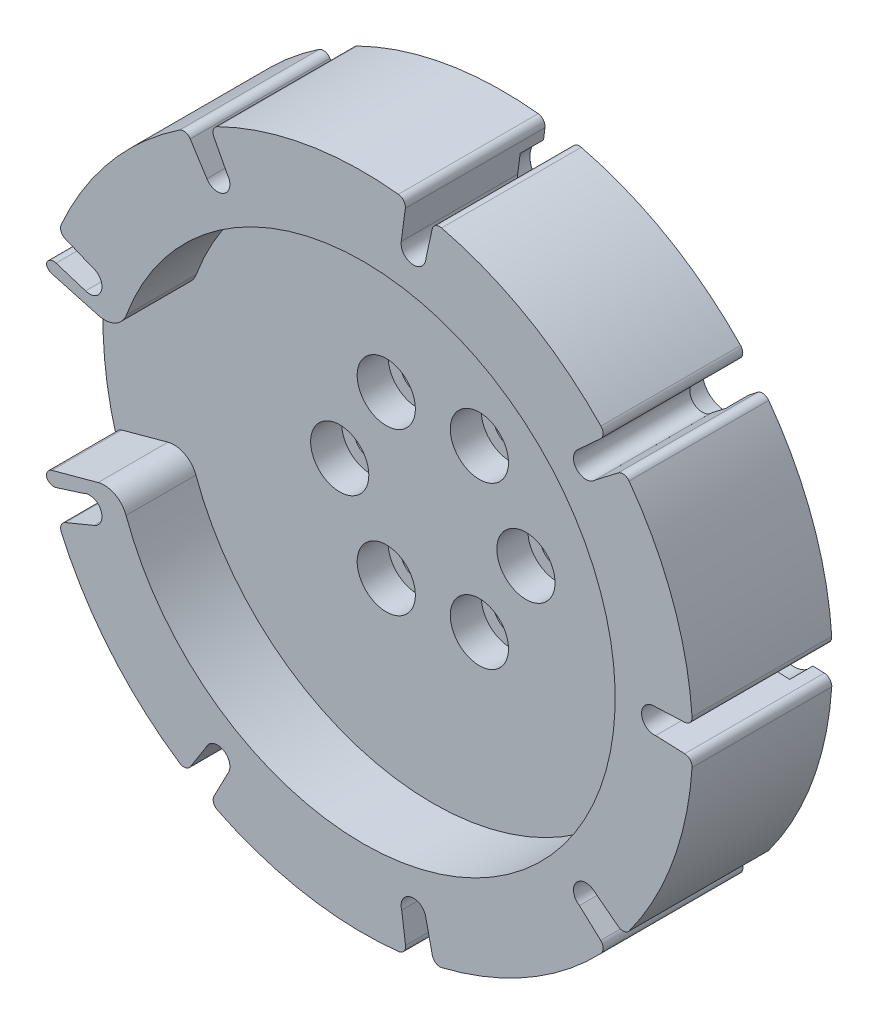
ISO-10303-21;
HEADER;
FILE_DESCRIPTION(('STEP AP214'),'2;1');
FILE_NAME('part.step','',(''),(''),'','','');
FILE_SCHEMA(('AUTOMOTIVE_DESIGN { 1 0 10303 214 1 1 1 1 }'));
ENDSEC;
DATA;
#1=APPLICATION_CONTEXT('core data for automotive mechanical design processes');
#2=APPLICATION_PROTOCOL_DEFINITION('international standard','automotive_design',2000,#1);
#3=PRODUCT_CONTEXT('',#1,'mechanical');
#4=PRODUCT('Part','Part','',(#3));
#5=PRODUCT_RELATED_PRODUCT_CATEGORY('part','',(#4));
#6=PRODUCT_DEFINITION_FORMATION('','',#4);
#7=PRODUCT_DEFINITION_CONTEXT('part definition',#1,'design');
#8=PRODUCT_DEFINITION('design','',#6,#7);
#9=PRODUCT_DEFINITION_SHAPE('','',#8);
#10=(LENGTH_UNIT() NAMED_UNIT(*) SI_UNIT(.MILLI.,.METRE.));
#11=(NAMED_UNIT(*) PLANE_ANGLE_UNIT() SI_UNIT($,.RADIAN.));
#12=(NAMED_UNIT(*) SI_UNIT($,.STERADIAN.) SOLID_ANGLE_UNIT());
#13=UNCERTAINTY_MEASURE_WITH_UNIT(LENGTH_MEASURE(1.E-05),#10,'distance_accuracy_value','');
#14=(GEOMETRIC_REPRESENTATION_CONTEXT(3) GLOBAL_UNCERTAINTY_ASSIGNED_CONTEXT((#13)) GLOBAL_UNIT_ASSIGNED_CONTEXT((#10,
#11,#12)) REPRESENTATION_CONTEXT('',''));
#15=CARTESIAN_POINT('',(0.,0.,0.));
#16=DIRECTION('',(0.,0.,1.));
#17=DIRECTION('',(1.,0.,0.));
#18=AXIS2_PLACEMENT_3D('',#15,#16,#17);
#19=CARTESIAN_POINT('',(28.7266666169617,24.1045353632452,9.));
#20=DIRECTION('',(0.,0.,-1.));
#21=DIRECTION('',(-1.,0.,0.));
#22=AXIS2_PLACEMENT_3D('',#19,#20,#21);
#23=CYLINDRICAL_SURFACE('',#22,1.6);
#24=DIRECTION('',(0.,0.,-1.));
#25=VECTOR('',#24,1.);
#26=CARTESIAN_POINT('',(29.9159600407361,23.0342171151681,9.));
#27=LINE('',#26,#25);
#28=CARTESIAN_POINT('',(29.9159600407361,23.0342171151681,18.));
#29=VERTEX_POINT('',#28);
#30=CARTESIAN_POINT('',(29.9159600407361,23.0342171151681,3.));
#31=VERTEX_POINT('',#30);
#32=EDGE_CURVE('E897',#29,#31,#27,.T.);
#33=ORIENTED_EDGE('',*,*,#32,.T.);
#34=CARTESIAN_POINT('',(28.7266666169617,24.1045353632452,3.));
#35=DIRECTION('',(0.,0.,-1.));
#36=DIRECTION('',(-1.,0.,0.));
#37=AXIS2_PLACEMENT_3D('',#34,#35,#36);
#38=CIRCLE('',#37,1.6);
#39=CARTESIAN_POINT('',(27.6722928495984,25.3079870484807,3.));
#40=VERTEX_POINT('',#39);
#41=EDGE_CURVE('E1358',#31,#40,#38,.T.);
#42=ORIENTED_EDGE('',*,*,#41,.T.);
#43=DIRECTION('',(0.,0.,-1.));
#44=VECTOR('',#43,1.);
#45=CARTESIAN_POINT('',(27.6722928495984,25.3079870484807,9.));
#46=LINE('',#45,#44);
#47=CARTESIAN_POINT('',(27.6722928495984,25.3079870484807,18.));
#48=VERTEX_POINT('',#47);
#49=EDGE_CURVE('E894',#48,#40,#46,.T.);
#50=ORIENTED_EDGE('',*,*,#49,.F.);
#51=CARTESIAN_POINT('',(28.7266666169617,24.1045353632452,18.));
#52=DIRECTION('',(0.,0.,1.));
#53=DIRECTION('',(1.,0.,0.));
#54=AXIS2_PLACEMENT_3D('',#51,#52,#53);
#55=CIRCLE('',#54,1.6);
#56=EDGE_CURVE('E1043',#29,#48,#55,.F.);
#57=ORIENTED_EDGE('',*,*,#56,.F.);
#58=EDGE_LOOP('',(#33,#42,#50,#57));
#59=FACE_BOUND('',#58,.T.);
#60=ADVANCED_FACE('F41',(#59),#23,.F.);
#61=CARTESIAN_POINT('',(6.51180666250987,36.9302907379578,9.));
#62=DIRECTION('',(0.,0.,-1.));
#63=DIRECTION('',(-1.,0.,0.));
#64=AXIS2_PLACEMENT_3D('',#61,#62,#63);
#65=CYLINDRICAL_SURFACE('',#64,1.60000000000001);
#66=DIRECTION('',(0.,0.,-1.));
#67=VECTOR('',#66,1.);
#68=CARTESIAN_POINT('',(8.11084558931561,36.8748424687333,9.));
#69=LINE('',#68,#67);
#70=CARTESIAN_POINT('',(8.11084558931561,36.8748424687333,18.));
#71=VERTEX_POINT('',#70);
#72=CARTESIAN_POINT('',(8.11084558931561,36.8748424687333,3.));
#73=VERTEX_POINT('',#72);
#74=EDGE_CURVE('E891',#71,#73,#69,.T.);
#75=ORIENTED_EDGE('',*,*,#74,.T.);
#76=CARTESIAN_POINT('',(6.51180666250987,36.9302907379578,3.));
#77=DIRECTION('',(0.,0.,-1.));
#78=DIRECTION('',(-1.,0.,0.));
#79=AXIS2_PLACEMENT_3D('',#76,#77,#78);
#80=CIRCLE('',#79,1.60000000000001);
#81=CARTESIAN_POINT('',(4.93054566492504,37.174449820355,3.));
#82=VERTEX_POINT('',#81);
#83=EDGE_CURVE('E1355',#73,#82,#80,.T.);
#84=ORIENTED_EDGE('',*,*,#83,.T.);
#85=DIRECTION('',(0.,0.,-1.));
#86=VECTOR('',#85,1.);
#87=CARTESIAN_POINT('',(4.93054566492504,37.174449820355,9.));
#88=LINE('',#87,#86);
#89=CARTESIAN_POINT('',(4.93054566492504,37.174449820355,18.));
#90=VERTEX_POINT('',#89);
#91=EDGE_CURVE('E888',#90,#82,#88,.T.);
#92=ORIENTED_EDGE('',*,*,#91,.F.);
#93=CARTESIAN_POINT('',(6.51180666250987,36.9302907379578,18.));
#94=DIRECTION('',(0.,0.,1.));
#95=DIRECTION('',(1.,0.,0.));
#96=AXIS2_PLACEMENT_3D('',#93,#94,#95);
#97=CIRCLE('',#96,1.60000000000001);
#98=EDGE_CURVE('E1054',#71,#90,#97,.F.);
#99=ORIENTED_EDGE('',*,*,#98,.F.);
#100=EDGE_LOOP('',(#75,#84,#92,#99));
#101=FACE_BOUND('',#100,.T.);
#102=ADVANCED_FACE('F1172',(#101),#65,.F.);
#103=CARTESIAN_POINT('',(-18.75,32.4759526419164,9.));
#104=DIRECTION('',(0.,0.,-1.));
#105=DIRECTION('',(-1.,0.,0.));
#106=AXIS2_PLACEMENT_3D('',#103,#104,#105);
#107=CYLINDRICAL_SURFACE('',#106,1.60000000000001);
#108=DIRECTION('',(0.,0.,-1.));
#109=VECTOR('',#108,1.);
#110=CARTESIAN_POINT('',(-17.4894236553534,33.4613192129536,9.));
#111=LINE('',#110,#109);
#112=CARTESIAN_POINT('',(-17.4894236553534,33.4613192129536,18.));
#113=VERTEX_POINT('',#112);
#114=CARTESIAN_POINT('',(-17.4894236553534,33.4613192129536,3.));
#115=VERTEX_POINT('',#114);
#116=EDGE_CURVE('E885',#113,#115,#111,.T.);
#117=ORIENTED_EDGE('',*,*,#116,.T.);
#118=CARTESIAN_POINT('',(-18.75,32.4759526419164,3.));
#119=DIRECTION('',(0.,0.,-1.));
#120=DIRECTION('',(-1.,0.,0.));
#121=AXIS2_PLACEMENT_3D('',#118,#119,#120);
#122=CIRCLE('',#121,1.60000000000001);
#123=CARTESIAN_POINT('',(-20.118258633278,31.6465743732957,3.));
#124=VERTEX_POINT('',#123);
#125=EDGE_CURVE('E1352',#115,#124,#122,.T.);
#126=ORIENTED_EDGE('',*,*,#125,.T.);
#127=DIRECTION('',(0.,0.,-1.));
#128=VECTOR('',#127,1.);
#129=CARTESIAN_POINT('',(-20.118258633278,31.6465743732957,9.));
#130=LINE('',#129,#128);
#131=CARTESIAN_POINT('',(-20.118258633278,31.6465743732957,18.));
#132=VERTEX_POINT('',#131);
#133=EDGE_CURVE('E882',#132,#124,#130,.T.);
#134=ORIENTED_EDGE('',*,*,#133,.F.);
#135=CARTESIAN_POINT('',(-18.75,32.4759526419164,18.));
#136=DIRECTION('',(0.,0.,1.));
#137=DIRECTION('',(1.,0.,0.));
#138=AXIS2_PLACEMENT_3D('',#135,#136,#137);
#139=CIRCLE('',#138,1.60000000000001);
#140=EDGE_CURVE('E1065',#113,#132,#139,.F.);
#141=ORIENTED_EDGE('',*,*,#140,.F.);
#142=EDGE_LOOP('',(#117,#126,#134,#141));
#143=FACE_BOUND('',#142,.T.);
#144=ADVANCED_FACE('F1209',(#143),#107,.F.);
#145=CARTESIAN_POINT('',(-35.2384732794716,12.8257553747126,9.));
#146=DIRECTION('',(0.,0.,-1.));
#147=DIRECTION('',(-1.,0.,0.));
#148=AXIS2_PLACEMENT_3D('',#145,#146,#147);
#149=CYLINDRICAL_SURFACE('',#148,1.60000000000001);
#150=DIRECTION('',(0.,0.,-1.));
#151=VECTOR('',#150,1.);
#152=CARTESIAN_POINT('',(-34.9061971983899,14.3908728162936,9.));
#153=LINE('',#152,#151);
#154=CARTESIAN_POINT('',(-34.9061971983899,14.3908728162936,18.));
#155=VERTEX_POINT('',#154);
#156=CARTESIAN_POINT('',(-34.9061971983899,14.3908728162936,3.));
#157=VERTEX_POINT('',#156);
#158=EDGE_CURVE('E879',#155,#157,#153,.T.);
#159=ORIENTED_EDGE('',*,*,#158,.T.);
#160=CARTESIAN_POINT('',(-35.2384732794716,12.8257553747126,3.));
#161=DIRECTION('',(0.,0.,-1.));
#162=DIRECTION('',(-1.,0.,0.));
#163=AXIS2_PLACEMENT_3D('',#160,#161,#162);
#164=CIRCLE('',#163,1.60000000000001);
#165=CARTESIAN_POINT('',(-35.753506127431,11.3109150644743,3.));
#166=VERTEX_POINT('',#165);
#167=EDGE_CURVE('E1349',#157,#166,#164,.T.);
#168=ORIENTED_EDGE('',*,*,#167,.T.);
#169=DIRECTION('',(0.,0.,-1.));
#170=VECTOR('',#169,1.);
#171=CARTESIAN_POINT('',(-35.753506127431,11.3109150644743,9.));
#172=LINE('',#171,#170);
#173=CARTESIAN_POINT('',(-35.753506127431,11.3109150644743,18.));
#174=VERTEX_POINT('',#173);
#175=EDGE_CURVE('E876',#174,#166,#172,.T.);
#176=ORIENTED_EDGE('',*,*,#175,.F.);
#177=CARTESIAN_POINT('',(-35.2384732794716,12.8257553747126,18.));
#178=DIRECTION('',(0.,0.,1.));
#179=DIRECTION('',(1.,0.,0.));
#180=AXIS2_PLACEMENT_3D('',#177,#178,#179);
#181=CIRCLE('',#180,1.60000000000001);
#182=EDGE_CURVE('E1076',#155,#174,#181,.F.);
#183=ORIENTED_EDGE('',*,*,#182,.F.);
#184=EDGE_LOOP('',(#159,#168,#176,#183));
#185=FACE_BOUND('',#184,.T.);
#186=ADVANCED_FACE('F1245',(#185),#149,.F.);
#187=CARTESIAN_POINT('',(-35.2384732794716,-12.8257553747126,9.));
#188=DIRECTION('',(0.,0.,-1.));
#189=DIRECTION('',(-1.,0.,0.));
#190=AXIS2_PLACEMENT_3D('',#187,#188,#189);
#191=CYLINDRICAL_SURFACE('',#190,1.6);
#192=DIRECTION('',(0.,0.,-1.));
#193=VECTOR('',#192,1.);
#194=CARTESIAN_POINT('',(-35.9899731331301,-11.4132229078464,9.));
#195=LINE('',#194,#193);
#196=CARTESIAN_POINT('',(-35.9899731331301,-11.4132229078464,18.));
#197=VERTEX_POINT('',#196);
#198=CARTESIAN_POINT('',(-35.9899731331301,-11.4132229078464,3.));
#199=VERTEX_POINT('',#198);
#200=EDGE_CURVE('E873',#197,#199,#195,.T.);
#201=ORIENTED_EDGE('',*,*,#200,.T.);
#202=CARTESIAN_POINT('',(-35.2384732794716,-12.8257553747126,3.));
#203=DIRECTION('',(0.,0.,-1.));
#204=DIRECTION('',(-1.,0.,0.));
#205=AXIS2_PLACEMENT_3D('',#202,#203,#204);
#206=CIRCLE('',#205,1.6);
#207=CARTESIAN_POINT('',(-34.6592907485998,-14.3172471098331,3.));
#208=VERTEX_POINT('',#207);
#209=EDGE_CURVE('E1343',#199,#208,#206,.T.);
#210=ORIENTED_EDGE('',*,*,#209,.T.);
#211=DIRECTION('',(0.,0.,-1.));
#212=VECTOR('',#211,1.);
#213=CARTESIAN_POINT('',(-34.6592907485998,-14.3172471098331,9.));
#214=LINE('',#213,#212);
#215=CARTESIAN_POINT('',(-34.6592907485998,-14.3172471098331,18.));
#216=VERTEX_POINT('',#215);
#217=EDGE_CURVE('E870',#216,#208,#214,.T.);
#218=ORIENTED_EDGE('',*,*,#217,.F.);
#219=CARTESIAN_POINT('',(-35.2384732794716,-12.8257553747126,18.));
#220=DIRECTION('',(0.,0.,1.));
#221=DIRECTION('',(1.,0.,0.));
#222=AXIS2_PLACEMENT_3D('',#219,#220,#221);
#223=CIRCLE('',#222,1.6);
#224=EDGE_CURVE('E1282',#197,#216,#223,.F.);
#225=ORIENTED_EDGE('',*,*,#224,.F.);
#226=EDGE_LOOP('',(#201,#210,#218,#225));
#227=FACE_BOUND('',#226,.T.);
#228=ADVANCED_FACE('F1843',(#227),#191,.F.);
#229=CARTESIAN_POINT('',(-18.75,-32.4759526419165,9.));
#230=DIRECTION('',(0.,0.,-1.));
#231=DIRECTION('',(-1.,0.,0.));
#232=AXIS2_PLACEMENT_3D('',#229,#230,#231);
#233=CYLINDRICAL_SURFACE('',#232,1.60000000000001);
#234=DIRECTION('',(0.,0.,-1.));
#235=VECTOR('',#234,1.);
#236=CARTESIAN_POINT('',(-20.2336406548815,-31.8769447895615,9.));
#237=LINE('',#236,#235);
#238=CARTESIAN_POINT('',(-20.2336406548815,-31.8769447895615,18.));
#239=VERTEX_POINT('',#238);
#240=CARTESIAN_POINT('',(-20.2336406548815,-31.8769447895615,3.));
#241=VERTEX_POINT('',#240);
#242=EDGE_CURVE('E867',#239,#241,#237,.T.);
#243=ORIENTED_EDGE('',*,*,#242,.T.);
#244=CARTESIAN_POINT('',(-18.75,-32.4759526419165,3.));
#245=DIRECTION('',(0.,0.,-1.));
#246=DIRECTION('',(-1.,0.,0.));
#247=AXIS2_PLACEMENT_3D('',#244,#245,#246);
#248=CIRCLE('',#247,1.60000000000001);
#249=CARTESIAN_POINT('',(-17.3476080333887,-33.2462102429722,3.));
#250=VERTEX_POINT('',#249);
#251=EDGE_CURVE('E1338',#241,#250,#248,.T.);
#252=ORIENTED_EDGE('',*,*,#251,.T.);
#253=DIRECTION('',(0.,0.,-1.));
#254=VECTOR('',#253,1.);
#255=CARTESIAN_POINT('',(-17.3476080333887,-33.2462102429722,9.));
#256=LINE('',#255,#254);
#257=CARTESIAN_POINT('',(-17.3476080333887,-33.2462102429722,18.));
#258=VERTEX_POINT('',#257);
#259=EDGE_CURVE('E864',#258,#250,#256,.T.);
#260=ORIENTED_EDGE('',*,*,#259,.F.);
#261=CARTESIAN_POINT('',(-18.75,-32.4759526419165,18.));
#262=DIRECTION('',(0.,0.,1.));
#263=DIRECTION('',(1.,0.,0.));
#264=AXIS2_PLACEMENT_3D('',#261,#262,#263);
#265=CIRCLE('',#264,1.60000000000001);
#266=EDGE_CURVE('E997',#239,#258,#265,.F.);
#267=ORIENTED_EDGE('',*,*,#266,.F.);
#268=EDGE_LOOP('',(#243,#252,#260,#267));
#269=FACE_BOUND('',#268,.T.);
#270=ADVANCED_FACE('F1853',(#269),#233,.F.);
#271=CARTESIAN_POINT('',(6.51180666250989,-36.9302907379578,9.));
#272=DIRECTION('',(0.,0.,-1.));
#273=DIRECTION('',(-1.,0.,0.));
#274=AXIS2_PLACEMENT_3D('',#271,#272,#273);
#275=CYLINDRICAL_SURFACE('',#274,1.6);
#276=DIRECTION('',(0.,0.,-1.));
#277=VECTOR('',#276,1.);
#278=CARTESIAN_POINT('',(4.99023715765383,-37.4250899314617,9.));
#279=LINE('',#278,#277);
#280=CARTESIAN_POINT('',(4.99023715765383,-37.4250899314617,18.));
#281=VERTEX_POINT('',#280);
#282=CARTESIAN_POINT('',(4.99023715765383,-37.4250899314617,3.));
#283=VERTEX_POINT('',#282);
#284=EDGE_CURVE('E861',#281,#283,#279,.T.);
#285=ORIENTED_EDGE('',*,*,#284,.T.);
#286=CARTESIAN_POINT('',(6.51180666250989,-36.9302907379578,3.));
#287=DIRECTION('',(0.,0.,-1.));
#288=DIRECTION('',(-1.,0.,0.));
#289=AXIS2_PLACEMENT_3D('',#286,#287,#288);
#290=CIRCLE('',#289,1.6);
#291=CARTESIAN_POINT('',(8.08121327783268,-36.618902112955,3.));
#292=VERTEX_POINT('',#291);
#293=EDGE_CURVE('E1332',#283,#292,#290,.T.);
#294=ORIENTED_EDGE('',*,*,#293,.T.);
#295=DIRECTION('',(0.,0.,-1.));
#296=VECTOR('',#295,1.);
#297=CARTESIAN_POINT('',(8.08121327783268,-36.618902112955,9.));
#298=LINE('',#297,#296);
#299=CARTESIAN_POINT('',(8.08121327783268,-36.618902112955,18.));
#300=VERTEX_POINT('',#299);
#301=EDGE_CURVE('E858',#300,#292,#298,.T.);
#302=ORIENTED_EDGE('',*,*,#301,.F.);
#303=CARTESIAN_POINT('',(6.51180666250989,-36.9302907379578,18.));
#304=DIRECTION('',(0.,0.,1.));
#305=DIRECTION('',(1.,0.,0.));
#306=AXIS2_PLACEMENT_3D('',#303,#304,#305);
#307=CIRCLE('',#306,1.6);
#308=EDGE_CURVE('E1012',#281,#300,#307,.F.);
#309=ORIENTED_EDGE('',*,*,#308,.F.);
#310=EDGE_LOOP('',(#285,#294,#302,#309));
#311=FACE_BOUND('',#310,.T.);
#312=ADVANCED_FACE('F1864',(#311),#275,.F.);
#313=CARTESIAN_POINT('',(28.7266666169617,-24.1045353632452,9.));
#314=DIRECTION('',(0.,0.,-1.));
#315=DIRECTION('',(-1.,0.,0.));
#316=AXIS2_PLACEMENT_3D('',#313,#314,#315);
#317=CYLINDRICAL_SURFACE('',#316,1.60000000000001);
#318=DIRECTION('',(0.,0.,-1.));
#319=VECTOR('',#318,1.);
#320=CARTESIAN_POINT('',(27.8791275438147,-25.461619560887,9.));
#321=LINE('',#320,#319);
#322=CARTESIAN_POINT('',(27.8791275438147,-25.461619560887,18.));
#323=VERTEX_POINT('',#322);
#324=CARTESIAN_POINT('',(27.8791275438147,-25.461619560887,3.));
#325=VERTEX_POINT('',#324);
#326=EDGE_CURVE('E855',#323,#325,#321,.T.);
#327=ORIENTED_EDGE('',*,*,#326,.T.);
#328=CARTESIAN_POINT('',(28.7266666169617,-24.1045353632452,3.));
#329=DIRECTION('',(0.,0.,-1.));
#330=DIRECTION('',(-1.,0.,0.));
#331=AXIS2_PLACEMENT_3D('',#328,#329,#330);
#332=CIRCLE('',#331,1.60000000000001);
#333=CARTESIAN_POINT('',(29.7287450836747,-22.8572027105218,3.));
#334=VERTEX_POINT('',#333);
#335=EDGE_CURVE('E1329',#325,#334,#332,.T.);
#336=ORIENTED_EDGE('',*,*,#335,.T.);
#337=DIRECTION('',(0.,0.,-1.));
#338=VECTOR('',#337,1.);
#339=CARTESIAN_POINT('',(29.7287450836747,-22.8572027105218,9.));
#340=LINE('',#339,#338);
#341=CARTESIAN_POINT('',(29.7287450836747,-22.8572027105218,18.));
#342=VERTEX_POINT('',#341);
#343=EDGE_CURVE('E557',#342,#334,#340,.T.);
#344=ORIENTED_EDGE('',*,*,#343,.F.);
#345=CARTESIAN_POINT('',(28.7266666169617,-24.1045353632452,18.));
#346=DIRECTION('',(0.,0.,1.));
#347=DIRECTION('',(1.,0.,0.));
#348=AXIS2_PLACEMENT_3D('',#345,#346,#347);
#349=CIRCLE('',#348,1.60000000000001);
#350=EDGE_CURVE('E1023',#323,#342,#349,.F.);
#351=ORIENTED_EDGE('',*,*,#350,.F.);
#352=EDGE_LOOP('',(#327,#336,#344,#351));
#353=FACE_BOUND('',#352,.T.);
#354=ADVANCED_FACE('F1875',(#353),#317,.F.);
#355=CARTESIAN_POINT('',(37.5,0.,9.));
#356=DIRECTION('',(0.,0.,-1.));
#357=DIRECTION('',(-1.,0.,0.));
#358=AXIS2_PLACEMENT_3D('',#355,#356,#357);
#359=CYLINDRICAL_SURFACE('',#358,1.60000000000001);
#360=DIRECTION('',(0.,0.,-1.));
#361=VECTOR('',#360,1.);
#362=CARTESIAN_POINT('',(37.723064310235,-1.58437442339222,9.));
#363=LINE('',#362,#361);
#364=CARTESIAN_POINT('',(37.723064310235,-1.58437442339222,18.));
#365=VERTEX_POINT('',#364);
#366=CARTESIAN_POINT('',(37.723064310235,-1.58437442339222,3.));
#367=VERTEX_POINT('',#366);
#368=EDGE_CURVE('E851',#365,#367,#363,.T.);
#369=ORIENTED_EDGE('',*,*,#368,.T.);
#370=CARTESIAN_POINT('',(37.5,0.,3.));
#371=DIRECTION('',(0.,0.,-1.));
#372=DIRECTION('',(-1.,0.,0.));
#373=AXIS2_PLACEMENT_3D('',#370,#371,#372);
#374=CIRCLE('',#373,1.60000000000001);
#375=CARTESIAN_POINT('',(37.4658666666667,1.59963586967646,3.));
#376=VERTEX_POINT('',#375);
#377=EDGE_CURVE('E559',#367,#376,#374,.T.);
#378=ORIENTED_EDGE('',*,*,#377,.T.);
#379=DIRECTION('',(0.,0.,-1.));
#380=VECTOR('',#379,1.);
#381=CARTESIAN_POINT('',(37.4658666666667,1.59963586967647,9.));
#382=LINE('',#381,#380);
#383=CARTESIAN_POINT('',(37.4658666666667,1.59963586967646,18.));
#384=VERTEX_POINT('',#383);
#385=EDGE_CURVE('E848',#384,#376,#382,.T.);
#386=ORIENTED_EDGE('',*,*,#385,.F.);
#387=CARTESIAN_POINT('',(37.5,0.,18.));
#388=DIRECTION('',(0.,0.,1.));
#389=DIRECTION('',(1.,0.,0.));
#390=AXIS2_PLACEMENT_3D('',#387,#388,#389);
#391=CIRCLE('',#390,1.60000000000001);
#392=EDGE_CURVE('E1032',#365,#384,#391,.F.);
#393=ORIENTED_EDGE('',*,*,#392,.F.);
#394=EDGE_LOOP('',(#369,#378,#386,#393));
#395=FACE_BOUND('',#394,.T.);
#396=ADVANCED_FACE('F1432',(#395),#359,.F.);
#397=CARTESIAN_POINT('',(-6.,-10.3923048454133,9.));
#398=DIRECTION('',(0.,0.,-1.));
#399=DIRECTION('',(-1.,0.,0.));
#400=AXIS2_PLACEMENT_3D('',#397,#398,#399);
#401=CYLINDRICAL_SURFACE('',#400,2.15);
#402=CARTESIAN_POINT('',(-6.,-10.3923048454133,0.));
#403=DIRECTION('',(0.,0.,1.));
#404=DIRECTION('',(1.,0.,0.));
#405=AXIS2_PLACEMENT_3D('',#402,#403,#404);
#406=CIRCLE('',#405,2.15);
#407=CARTESIAN_POINT('',(-3.85,-10.3923048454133,0.));
#408=VERTEX_POINT('',#407);
#409=EDGE_CURVE('E1104',#408,#408,#406,.T.);
#410=ORIENTED_EDGE('',*,*,#409,.F.);
#411=EDGE_LOOP('',(#410));
#412=FACE_BOUND('',#411,.T.);
#413=CARTESIAN_POINT('',(-6.,-10.3923048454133,5.));
#414=DIRECTION('',(0.,0.,1.));
#415=DIRECTION('',(1.,0.,0.));
#416=AXIS2_PLACEMENT_3D('',#413,#414,#415);
#417=CIRCLE('',#416,2.15);
#418=CARTESIAN_POINT('',(-3.85,-10.3923048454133,5.));
#419=VERTEX_POINT('',#418);
#420=EDGE_CURVE('E916',#419,#419,#417,.T.);
#421=ORIENTED_EDGE('',*,*,#420,.T.);
#422=EDGE_LOOP('',(#421));
#423=FACE_BOUND('',#422,.T.);
#424=ADVANCED_FACE('F1428',(#412,#423),#401,.F.);
#425=CARTESIAN_POINT('',(6.00000000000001,-10.3923048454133,9.));
#426=DIRECTION('',(0.,0.,-1.));
#427=DIRECTION('',(-1.,0.,0.));
#428=AXIS2_PLACEMENT_3D('',#425,#426,#427);
#429=CYLINDRICAL_SURFACE('',#428,2.15);
#430=CARTESIAN_POINT('',(6.00000000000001,-10.3923048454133,0.));
#431=DIRECTION('',(0.,0.,1.));
#432=DIRECTION('',(1.,0.,0.));
#433=AXIS2_PLACEMENT_3D('',#430,#431,#432);
#434=CIRCLE('',#433,2.15);
#435=CARTESIAN_POINT('',(8.15000000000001,-10.3923048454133,0.));
#436=VERTEX_POINT('',#435);
#437=EDGE_CURVE('E1101',#436,#436,#434,.T.);
#438=ORIENTED_EDGE('',*,*,#437,.F.);
#439=EDGE_LOOP('',(#438));
#440=FACE_BOUND('',#439,.T.);
#441=CARTESIAN_POINT('',(6.00000000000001,-10.3923048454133,5.));
#442=DIRECTION('',(0.,0.,1.));
#443=DIRECTION('',(1.,0.,0.));
#444=AXIS2_PLACEMENT_3D('',#441,#442,#443);
#445=CIRCLE('',#444,2.15);
#446=CARTESIAN_POINT('',(8.15000000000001,-10.3923048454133,5.));
#447=VERTEX_POINT('',#446);
#448=EDGE_CURVE('E913',#447,#447,#445,.T.);
#449=ORIENTED_EDGE('',*,*,#448,.T.);
#450=EDGE_LOOP('',(#449));
#451=FACE_BOUND('',#450,.T.);
#452=ADVANCED_FACE('F1431',(#440,#451),#429,.F.);
#453=CARTESIAN_POINT('',(12.,0.,9.));
#454=DIRECTION('',(0.,0.,-1.));
#455=DIRECTION('',(-1.,0.,0.));
#456=AXIS2_PLACEMENT_3D('',#453,#454,#455);
#457=CYLINDRICAL_SURFACE('',#456,2.15);
#458=CARTESIAN_POINT('',(12.,0.,0.));
#459=DIRECTION('',(0.,0.,1.));
#460=DIRECTION('',(1.,0.,0.));
#461=AXIS2_PLACEMENT_3D('',#458,#459,#460);
#462=CIRCLE('',#461,2.15);
#463=CARTESIAN_POINT('',(14.15,0.,0.));
#464=VERTEX_POINT('',#463);
#465=EDGE_CURVE('E1098',#464,#464,#462,.T.);
#466=ORIENTED_EDGE('',*,*,#465,.F.);
#467=EDGE_LOOP('',(#466));
#468=FACE_BOUND('',#467,.T.);
#469=CARTESIAN_POINT('',(12.,0.,5.));
#470=DIRECTION('',(0.,0.,1.));
#471=DIRECTION('',(1.,0.,0.));
#472=AXIS2_PLACEMENT_3D('',#469,#470,#471);
#473=CIRCLE('',#472,2.15);
#474=CARTESIAN_POINT('',(14.15,0.,5.));
#475=VERTEX_POINT('',#474);
#476=EDGE_CURVE('E910',#475,#475,#473,.T.);
#477=ORIENTED_EDGE('',*,*,#476,.T.);
#478=EDGE_LOOP('',(#477));
#479=FACE_BOUND('',#478,.T.);
#480=ADVANCED_FACE('F1436',(#468,#479),#457,.F.);
#481=CARTESIAN_POINT('',(6.,10.3923048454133,9.));
#482=DIRECTION('',(0.,0.,-1.));
#483=DIRECTION('',(-1.,0.,0.));
#484=AXIS2_PLACEMENT_3D('',#481,#482,#483);
#485=CYLINDRICAL_SURFACE('',#484,2.15);
#486=CARTESIAN_POINT('',(6.,10.3923048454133,0.));
#487=DIRECTION('',(0.,0.,1.));
#488=DIRECTION('',(1.,0.,0.));
#489=AXIS2_PLACEMENT_3D('',#486,#487,#488);
#490=CIRCLE('',#489,2.15);
#491=CARTESIAN_POINT('',(8.15,10.3923048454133,0.));
#492=VERTEX_POINT('',#491);
#493=EDGE_CURVE('E1095',#492,#492,#490,.T.);
#494=ORIENTED_EDGE('',*,*,#493,.F.);
#495=EDGE_LOOP('',(#494));
#496=FACE_BOUND('',#495,.T.);
#497=CARTESIAN_POINT('',(6.,10.3923048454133,5.));
#498=DIRECTION('',(0.,0.,1.));
#499=DIRECTION('',(1.,0.,0.));
#500=AXIS2_PLACEMENT_3D('',#497,#498,#499);
#501=CIRCLE('',#500,2.15);
#502=CARTESIAN_POINT('',(8.15,10.3923048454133,5.));
#503=VERTEX_POINT('',#502);
#504=EDGE_CURVE('E907',#503,#503,#501,.T.);
#505=ORIENTED_EDGE('',*,*,#504,.T.);
#506=EDGE_LOOP('',(#505));
#507=FACE_BOUND('',#506,.T.);
#508=ADVANCED_FACE('F1440',(#496,#507),#485,.F.);
#509=CARTESIAN_POINT('',(-6.,10.3923048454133,9.));
#510=DIRECTION('',(0.,0.,-1.));
#511=DIRECTION('',(-1.,0.,0.));
#512=AXIS2_PLACEMENT_3D('',#509,#510,#511);
#513=CYLINDRICAL_SURFACE('',#512,2.15);
#514=CARTESIAN_POINT('',(-6.,10.3923048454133,0.));
#515=DIRECTION('',(0.,0.,1.));
#516=DIRECTION('',(1.,0.,0.));
#517=AXIS2_PLACEMENT_3D('',#514,#515,#516);
#518=CIRCLE('',#517,2.15);
#519=CARTESIAN_POINT('',(-3.85,10.3923048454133,0.));
#520=VERTEX_POINT('',#519);
#521=EDGE_CURVE('E1092',#520,#520,#518,.T.);
#522=ORIENTED_EDGE('',*,*,#521,.F.);
#523=EDGE_LOOP('',(#522));
#524=FACE_BOUND('',#523,.T.);
#525=CARTESIAN_POINT('',(-6.,10.3923048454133,5.));
#526=DIRECTION('',(0.,0.,1.));
#527=DIRECTION('',(1.,0.,0.));
#528=AXIS2_PLACEMENT_3D('',#525,#526,#527);
#529=CIRCLE('',#528,2.15);
#530=CARTESIAN_POINT('',(-3.85,10.3923048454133,5.));
#531=VERTEX_POINT('',#530);
#532=EDGE_CURVE('E903',#531,#531,#529,.T.);
#533=ORIENTED_EDGE('',*,*,#532,.T.);
#534=EDGE_LOOP('',(#533));
#535=FACE_BOUND('',#534,.T.);
#536=ADVANCED_FACE('F1444',(#524,#535),#513,.F.);
#537=CARTESIAN_POINT('',(-12.,0.,9.));
#538=DIRECTION('',(0.,0.,-1.));
#539=DIRECTION('',(-1.,0.,0.));
#540=AXIS2_PLACEMENT_3D('',#537,#538,#539);
#541=CYLINDRICAL_SURFACE('',#540,2.15);
#542=CARTESIAN_POINT('',(-12.,0.,0.));
#543=DIRECTION('',(0.,0.,1.));
#544=DIRECTION('',(1.,0.,0.));
#545=AXIS2_PLACEMENT_3D('',#542,#543,#544);
#546=CIRCLE('',#545,2.15);
#547=CARTESIAN_POINT('',(-9.85,0.,0.));
#548=VERTEX_POINT('',#547);
#549=EDGE_CURVE('E1084',#548,#548,#546,.T.);
#550=ORIENTED_EDGE('',*,*,#549,.F.);
#551=EDGE_LOOP('',(#550));
#552=FACE_BOUND('',#551,.T.);
#553=CARTESIAN_POINT('',(-12.,0.,5.));
#554=DIRECTION('',(0.,0.,1.));
#555=DIRECTION('',(1.,0.,0.));
#556=AXIS2_PLACEMENT_3D('',#553,#554,#555);
#557=CIRCLE('',#556,2.15);
#558=CARTESIAN_POINT('',(-9.85,0.,5.));
#559=VERTEX_POINT('',#558);
#560=EDGE_CURVE('E900',#559,#559,#557,.T.);
#561=ORIENTED_EDGE('',*,*,#560,.T.);
#562=EDGE_LOOP('',(#561));
#563=FACE_BOUND('',#562,.T.);
#564=ADVANCED_FACE('F1427',(#552,#563),#541,.F.);
#565=CARTESIAN_POINT('',(0.,0.,9.));
#566=DIRECTION('',(-0.0426569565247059,0.999089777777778,0.));
#567=DIRECTION('',(-0.999089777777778,-0.0426569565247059,0.));
#568=AXIS2_PLACEMENT_3D('',#565,#566,#567);
#569=PLANE('',#568);
#570=DIRECTION('',(0.999089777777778,0.0426569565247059,0.));
#571=VECTOR('',#570,1.);
#572=CARTESIAN_POINT('',(0.,0.,0.));
#573=LINE('',#572,#571);
#574=CARTESIAN_POINT('',(39.9673993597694,1.70644085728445,0.));
#575=VERTEX_POINT('',#574);
#576=CARTESIAN_POINT('',(41.4501868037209,1.76974968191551,0.));
#577=VERTEX_POINT('',#576);
#578=EDGE_CURVE('E938',#575,#577,#573,.T.);
#579=ORIENTED_EDGE('',*,*,#578,.T.);
#580=DIRECTION('',(0.,0.,-1.));
#581=VECTOR('',#580,1.);
#582=CARTESIAN_POINT('',(41.4501868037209,1.76974968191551,9.));
#583=LINE('',#582,#581);
#584=CARTESIAN_POINT('',(41.4501868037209,1.76974968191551,18.));
#585=VERTEX_POINT('',#584);
#586=EDGE_CURVE('E715',#577,#585,#583,.F.);
#587=ORIENTED_EDGE('',*,*,#586,.T.);
#588=DIRECTION('',(0.999089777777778,0.0426569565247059,0.));
#589=VECTOR('',#588,1.);
#590=CARTESIAN_POINT('',(0.,0.,18.));
#591=LINE('',#590,#589);
#592=EDGE_CURVE('E1035',#384,#585,#591,.T.);
#593=ORIENTED_EDGE('',*,*,#592,.F.);
#594=ORIENTED_EDGE('',*,*,#385,.T.);
#595=DIRECTION('',(-0.999089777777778,-0.0426569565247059,0.));
#596=VECTOR('',#595,1.);
#597=CARTESIAN_POINT('',(0.,0.,3.));
#598=LINE('',#597,#596);
#599=CARTESIAN_POINT('',(39.9673993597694,1.70644085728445,3.));
#600=VERTEX_POINT('',#599);
#601=EDGE_CURVE('E1327',#600,#376,#598,.T.);
#602=ORIENTED_EDGE('',*,*,#601,.F.);
#603=DIRECTION('',(0.,0.,-1.));
#604=VECTOR('',#603,1.);
#605=CARTESIAN_POINT('',(39.9673993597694,1.70644085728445,3.));
#606=LINE('',#605,#604);
#607=EDGE_CURVE('E1111',#600,#575,#606,.T.);
#608=ORIENTED_EDGE('',*,*,#607,.T.);
#609=EDGE_LOOP('',(#579,#587,#593,#594,#602,#608));
#610=FACE_BOUND('',#609,.T.);
#611=ADVANCED_FACE('F1108',(#610),#569,.F.);
#612=CARTESIAN_POINT('',(0.,0.,9.));
#613=DIRECTION('',(0.,0.,-1.));
#614=DIRECTION('',(-1.,0.,0.));
#615=AXIS2_PLACEMENT_3D('',#612,#613,#614);
#616=CYLINDRICAL_SURFACE('',#615,42.5);
#617=CARTESIAN_POINT('',(0.,0.,18.));
#618=DIRECTION('',(0.,0.,1.));
#619=DIRECTION('',(1.,0.,0.));
#620=AXIS2_PLACEMENT_3D('',#617,#618,#619);
#621=CIRCLE('',#620,42.5);
#622=CARTESIAN_POINT('',(42.4053016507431,2.83555848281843,18.));
#623=VERTEX_POINT('',#622);
#624=CARTESIAN_POINT('',(34.2895793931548,25.1092561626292,18.));
#625=VERTEX_POINT('',#624);
#626=EDGE_CURVE('E1038',#623,#625,#621,.T.);
#627=ORIENTED_EDGE('',*,*,#626,.F.);
#628=DIRECTION('',(0.,0.,-1.));
#629=VECTOR('',#628,1.);
#630=CARTESIAN_POINT('',(42.4053016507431,2.83555848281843,9.));
#631=LINE('',#630,#629);
#632=CARTESIAN_POINT('',(42.4053016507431,2.83555848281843,0.));
#633=VERTEX_POINT('',#632);
#634=EDGE_CURVE('E712',#623,#633,#631,.T.);
#635=ORIENTED_EDGE('',*,*,#634,.T.);
#636=CARTESIAN_POINT('',(0.,0.,0.));
#637=DIRECTION('',(0.,0.,1.));
#638=DIRECTION('',(1.,0.,0.));
#639=AXIS2_PLACEMENT_3D('',#636,#637,#638);
#640=CIRCLE('',#639,42.5);
#641=CARTESIAN_POINT('',(34.2895793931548,25.1092561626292,0.));
#642=VERTEX_POINT('',#641);
#643=EDGE_CURVE('E961',#633,#642,#640,.T.);
#644=ORIENTED_EDGE('',*,*,#643,.T.);
#645=DIRECTION('',(0.,0.,-1.));
#646=VECTOR('',#645,1.);
#647=CARTESIAN_POINT('',(34.2895793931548,25.1092561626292,9.));
#648=LINE('',#647,#646);
#649=EDGE_CURVE('E710',#642,#625,#648,.F.);
#650=ORIENTED_EDGE('',*,*,#649,.T.);
#651=EDGE_LOOP('',(#627,#635,#644,#650));
#652=FACE_BOUND('',#651,.T.);
#653=ADVANCED_FACE('F1119',(#652),#616,.T.);
#654=CARTESIAN_POINT('',(0.,0.,9.));
#655=DIRECTION('',(-0.610075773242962,0.792343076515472,0.));
#656=DIRECTION('',(-0.792343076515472,-0.610075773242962,0.));
#657=AXIS2_PLACEMENT_3D('',#654,#655,#656);
#658=PLANE('',#657);
#659=DIRECTION('',(-0.792343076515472,-0.610075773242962,0.));
#660=VECTOR('',#659,1.);
#661=CARTESIAN_POINT('',(0.,0.,18.));
#662=LINE('',#661,#660);
#663=CARTESIAN_POINT('',(32.8726899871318,25.3107932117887,18.));
#664=VERTEX_POINT('',#663);
#665=EDGE_CURVE('E1041',#664,#29,#662,.T.);
#666=ORIENTED_EDGE('',*,*,#665,.F.);
#667=DIRECTION('',(0.,0.,1.));
#668=VECTOR('',#667,1.);
#669=CARTESIAN_POINT('',(32.8726899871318,25.3107932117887,0.));
#670=LINE('',#669,#668);
#671=CARTESIAN_POINT('',(32.8726899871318,25.3107932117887,0.));
#672=VERTEX_POINT('',#671);
#673=EDGE_CURVE('E717',#664,#672,#670,.F.);
#674=ORIENTED_EDGE('',*,*,#673,.T.);
#675=DIRECTION('',(0.792343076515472,0.610075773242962,0.));
#676=VECTOR('',#675,1.);
#677=CARTESIAN_POINT('',(0.,0.,0.));
#678=LINE('',#677,#676);
#679=CARTESIAN_POINT('',(31.7104627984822,24.4159199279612,0.));
#680=VERTEX_POINT('',#679);
#681=EDGE_CURVE('E965',#680,#672,#678,.T.);
#682=ORIENTED_EDGE('',*,*,#681,.F.);
#683=DIRECTION('',(0.,0.,-1.));
#684=VECTOR('',#683,1.);
#685=CARTESIAN_POINT('',(31.7104627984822,24.4159199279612,3.));
#686=LINE('',#685,#684);
#687=CARTESIAN_POINT('',(31.7104627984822,24.4159199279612,3.));
#688=VERTEX_POINT('',#687);
#689=EDGE_CURVE('E1321',#688,#680,#686,.T.);
#690=ORIENTED_EDGE('',*,*,#689,.F.);
#691=DIRECTION('',(-0.792343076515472,-0.610075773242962,0.));
#692=VECTOR('',#691,1.);
#693=CARTESIAN_POINT('',(0.,0.,3.));
#694=LINE('',#693,#692);
#695=EDGE_CURVE('E1134',#688,#31,#694,.T.);
#696=ORIENTED_EDGE('',*,*,#695,.T.);
#697=ORIENTED_EDGE('',*,*,#32,.F.);
#698=EDGE_LOOP('',(#666,#674,#682,#690,#696,#697));
#699=FACE_BOUND('',#698,.T.);
#700=ADVANCED_FACE('F1128',(#699),#658,.T.);
#701=CARTESIAN_POINT('',(0.,0.,9.));
#702=DIRECTION('',(-0.674879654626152,0.737927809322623,0.));
#703=DIRECTION('',(-0.737927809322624,-0.674879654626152,0.));
#704=AXIS2_PLACEMENT_3D('',#701,#702,#703);
#705=PLANE('',#704);
#706=DIRECTION('',(0.737927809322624,0.674879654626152,0.));
#707=VECTOR('',#706,1.);
#708=CARTESIAN_POINT('',(0.,0.,0.));
#709=LINE('',#708,#707);
#710=CARTESIAN_POINT('',(29.519925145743,26.9977586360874,0.));
#711=VERTEX_POINT('',#710);
#712=CARTESIAN_POINT('',(30.615112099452,27.9993734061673,0.));
#713=VERTEX_POINT('',#712);
#714=EDGE_CURVE('E1146',#711,#713,#709,.T.);
#715=ORIENTED_EDGE('',*,*,#714,.T.);
#716=DIRECTION('',(0.,0.,-1.));
#717=VECTOR('',#716,1.);
#718=CARTESIAN_POINT('',(30.615112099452,27.9993734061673,9.));
#719=LINE('',#718,#717);
#720=CARTESIAN_POINT('',(30.615112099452,27.9993734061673,18.));
#721=VERTEX_POINT('',#720);
#722=EDGE_CURVE('E725',#713,#721,#719,.F.);
#723=ORIENTED_EDGE('',*,*,#722,.T.);
#724=DIRECTION('',(0.737927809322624,0.674879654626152,0.));
#725=VECTOR('',#724,1.);
#726=CARTESIAN_POINT('',(0.,0.,18.));
#727=LINE('',#726,#725);
#728=EDGE_CURVE('E1046',#48,#721,#727,.T.);
#729=ORIENTED_EDGE('',*,*,#728,.F.);
#730=ORIENTED_EDGE('',*,*,#49,.T.);
#731=DIRECTION('',(-0.737927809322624,-0.674879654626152,0.));
#732=VECTOR('',#731,1.);
#733=CARTESIAN_POINT('',(0.,0.,3.));
#734=LINE('',#733,#732);
#735=CARTESIAN_POINT('',(29.519925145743,26.9977586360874,3.));
#736=VERTEX_POINT('',#735);
#737=EDGE_CURVE('E577',#736,#40,#734,.T.);
#738=ORIENTED_EDGE('',*,*,#737,.F.);
#739=DIRECTION('',(0.,0.,-1.));
#740=VECTOR('',#739,1.);
#741=CARTESIAN_POINT('',(29.519925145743,26.9977586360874,3.));
#742=LINE('',#741,#740);
#743=EDGE_CURVE('E1319',#736,#711,#742,.T.);
#744=ORIENTED_EDGE('',*,*,#743,.T.);
#745=EDGE_LOOP('',(#715,#723,#729,#730,#738,#744));
#746=FACE_BOUND('',#745,.T.);
#747=ADVANCED_FACE('F1141',(#746),#705,.F.);
#748=CARTESIAN_POINT('',(0.,0.,18.));
#749=DIRECTION('',(0.,0.,1.));
#750=DIRECTION('',(1.,0.,0.));
#751=AXIS2_PLACEMENT_3D('',#748,#749,#750);
#752=CIRCLE('',#751,42.5);
#753=CARTESIAN_POINT('',(30.6616838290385,29.4297663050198,18.));
#754=VERTEX_POINT('',#753);
#755=CARTESIAN_POINT('',(10.1274230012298,41.2757229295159,18.));
#756=VERTEX_POINT('',#755);
#757=EDGE_CURVE('E1049',#754,#756,#752,.T.);
#758=ORIENTED_EDGE('',*,*,#757,.F.);
#759=DIRECTION('',(0.,0.,-1.));
#760=VECTOR('',#759,1.);
#761=CARTESIAN_POINT('',(30.6616838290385,29.4297663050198,9.));
#762=LINE('',#761,#760);
#763=CARTESIAN_POINT('',(30.6616838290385,29.4297663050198,0.));
#764=VERTEX_POINT('',#763);
#765=EDGE_CURVE('E722',#754,#764,#762,.T.);
#766=ORIENTED_EDGE('',*,*,#765,.T.);
#767=CARTESIAN_POINT('',(10.1274230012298,41.2757229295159,0.));
#768=VERTEX_POINT('',#767);
#769=EDGE_CURVE('E966',#764,#768,#640,.T.);
#770=ORIENTED_EDGE('',*,*,#769,.T.);
#771=DIRECTION('',(0.,0.,-1.));
#772=VECTOR('',#771,1.);
#773=CARTESIAN_POINT('',(10.1274230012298,41.2757229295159,9.));
#774=LINE('',#773,#772);
#775=EDGE_CURVE('E720',#768,#756,#774,.F.);
#776=ORIENTED_EDGE('',*,*,#775,.T.);
#777=EDGE_LOOP('',(#758,#766,#770,#776));
#778=FACE_BOUND('',#777,.T.);
#779=ADVANCED_FACE('F1153',(#778),#616,.T.);
#780=CARTESIAN_POINT('',(0.,0.,9.));
#781=DIRECTION('',(-0.976653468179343,0.214820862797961,0.));
#782=DIRECTION('',(-0.214820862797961,-0.976653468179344,0.));
#783=AXIS2_PLACEMENT_3D('',#780,#781,#782);
#784=PLANE('',#783);
#785=DIRECTION('',(-0.214820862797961,-0.976653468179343,0.));
#786=VECTOR('',#785,1.);
#787=CARTESIAN_POINT('',(0.,0.,18.));
#788=LINE('',#787,#786);
#789=CARTESIAN_POINT('',(8.91247722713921,40.5193503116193,18.));
#790=VERTEX_POINT('',#789);
#791=EDGE_CURVE('E1052',#790,#71,#788,.T.);
#792=ORIENTED_EDGE('',*,*,#791,.F.);
#793=DIRECTION('',(0.,0.,1.));
#794=VECTOR('',#793,1.);
#795=CARTESIAN_POINT('',(8.91247722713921,40.5193503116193,0.));
#796=LINE('',#795,#794);
#797=CARTESIAN_POINT('',(8.91247722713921,40.5193503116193,0.));
#798=VERTEX_POINT('',#797);
#799=EDGE_CURVE('E727',#790,#798,#796,.F.);
#800=ORIENTED_EDGE('',*,*,#799,.T.);
#801=DIRECTION('',(0.214820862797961,0.976653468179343,0.));
#802=VECTOR('',#801,1.);
#803=CARTESIAN_POINT('',(0.,0.,0.));
#804=LINE('',#803,#802);
#805=CARTESIAN_POINT('',(8.59737300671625,39.0867723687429,0.));
#806=VERTEX_POINT('',#805);
#807=EDGE_CURVE('E2408',#806,#798,#804,.T.);
#808=ORIENTED_EDGE('',*,*,#807,.F.);
#809=DIRECTION('',(0.,0.,-1.));
#810=VECTOR('',#809,1.);
#811=CARTESIAN_POINT('',(8.59737300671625,39.0867723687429,3.));
#812=LINE('',#811,#810);
#813=CARTESIAN_POINT('',(8.59737300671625,39.0867723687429,3.));
#814=VERTEX_POINT('',#813);
#815=EDGE_CURVE('E1317',#814,#806,#812,.T.);
#816=ORIENTED_EDGE('',*,*,#815,.F.);
#817=DIRECTION('',(-0.214820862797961,-0.976653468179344,0.));
#818=VECTOR('',#817,1.);
#819=CARTESIAN_POINT('',(0.,0.,3.));
#820=LINE('',#819,#818);
#821=EDGE_CURVE('E1169',#814,#73,#820,.T.);
#822=ORIENTED_EDGE('',*,*,#821,.T.);
#823=ORIENTED_EDGE('',*,*,#74,.F.);
#824=EDGE_LOOP('',(#792,#800,#808,#816,#822,#823));
#825=FACE_BOUND('',#824,.T.);
#826=ADVANCED_FACE('F1163',(#825),#784,.T.);
#827=CARTESIAN_POINT('',(0.,0.,9.));
#828=DIRECTION('',(-0.991318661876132,0.131481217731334,0.));
#829=DIRECTION('',(-0.131481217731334,-0.991318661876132,0.));
#830=AXIS2_PLACEMENT_3D('',#827,#828,#829);
#831=PLANE('',#830);
#832=DIRECTION('',(0.131481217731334,0.991318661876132,0.));
#833=VECTOR('',#832,1.);
#834=CARTESIAN_POINT('',(0.,0.,0.));
#835=LINE('',#834,#833);
#836=CARTESIAN_POINT('',(5.25974987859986,39.6565251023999,0.));
#837=VERTEX_POINT('',#836);
#838=CARTESIAN_POINT('',(5.4548861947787,41.1277791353,0.));
#839=VERTEX_POINT('',#838);
#840=EDGE_CURVE('E1182',#837,#839,#835,.T.);
#841=ORIENTED_EDGE('',*,*,#840,.T.);
#842=DIRECTION('',(0.,0.,-1.));
#843=VECTOR('',#842,1.);
#844=CARTESIAN_POINT('',(5.45488619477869,41.1277791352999,9.));
#845=LINE('',#844,#843);
#846=CARTESIAN_POINT('',(5.45488619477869,41.1277791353,18.));
#847=VERTEX_POINT('',#846);
#848=EDGE_CURVE('E735',#839,#847,#845,.F.);
#849=ORIENTED_EDGE('',*,*,#848,.T.);
#850=DIRECTION('',(0.131481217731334,0.991318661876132,0.));
#851=VECTOR('',#850,1.);
#852=CARTESIAN_POINT('',(0.,0.,18.));
#853=LINE('',#852,#851);
#854=EDGE_CURVE('E1057',#90,#847,#853,.T.);
#855=ORIENTED_EDGE('',*,*,#854,.F.);
#856=ORIENTED_EDGE('',*,*,#91,.T.);
#857=DIRECTION('',(-0.131481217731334,-0.991318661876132,0.));
#858=VECTOR('',#857,1.);
#859=CARTESIAN_POINT('',(0.,0.,3.));
#860=LINE('',#859,#858);
#861=CARTESIAN_POINT('',(5.25974987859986,39.6565251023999,3.));
#862=VERTEX_POINT('',#861);
#863=EDGE_CURVE('E575',#862,#82,#860,.T.);
#864=ORIENTED_EDGE('',*,*,#863,.F.);
#865=DIRECTION('',(0.,0.,-1.));
#866=VECTOR('',#865,1.);
#867=CARTESIAN_POINT('',(5.25974987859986,39.6565251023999,3.));
#868=LINE('',#867,#866);
#869=EDGE_CURVE('E1315',#862,#837,#868,.T.);
#870=ORIENTED_EDGE('',*,*,#869,.T.);
#871=EDGE_LOOP('',(#841,#849,#855,#856,#864,#870));
#872=FACE_BOUND('',#871,.T.);
#873=ADVANCED_FACE('F1177',(#872),#831,.F.);
#874=CARTESIAN_POINT('',(0.,0.,18.));
#875=DIRECTION('',(0.,0.,1.));
#876=DIRECTION('',(1.,0.,0.));
#877=AXIS2_PLACEMENT_3D('',#874,#875,#876);
#878=CIRCLE('',#877,42.5);
#879=CARTESIAN_POINT('',(4.57112337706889,42.2534593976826,18.));
#880=VERTEX_POINT('',#879);
#881=CARTESIAN_POINT('',(-18.7734671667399,38.1288202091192,18.));
#882=VERTEX_POINT('',#881);
#883=EDGE_CURVE('E1060',#880,#882,#878,.T.);
#884=ORIENTED_EDGE('',*,*,#883,.F.);
#885=DIRECTION('',(0.,0.,-1.));
#886=VECTOR('',#885,1.);
#887=CARTESIAN_POINT('',(4.57112337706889,42.2534593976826,9.));
#888=LINE('',#887,#886);
#889=CARTESIAN_POINT('',(4.57112337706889,42.2534593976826,0.));
#890=VERTEX_POINT('',#889);
#891=EDGE_CURVE('E732',#880,#890,#888,.T.);
#892=ORIENTED_EDGE('',*,*,#891,.T.);
#893=CARTESIAN_POINT('',(-18.7734671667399,38.1288202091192,0.));
#894=VERTEX_POINT('',#893);
#895=EDGE_CURVE('E1193',#890,#894,#640,.T.);
#896=ORIENTED_EDGE('',*,*,#895,.T.);
#897=DIRECTION('',(0.,0.,-1.));
#898=VECTOR('',#897,1.);
#899=CARTESIAN_POINT('',(-18.7734671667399,38.1288202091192,9.));
#900=LINE('',#899,#898);
#901=EDGE_CURVE('E730',#894,#882,#900,.F.);
#902=ORIENTED_EDGE('',*,*,#901,.T.);
#903=EDGE_LOOP('',(#884,#892,#896,#902));
#904=FACE_BOUND('',#903,.T.);
#905=ADVANCED_FACE('F1189',(#904),#616,.T.);
#906=CARTESIAN_POINT('',(0.,0.,9.));
#907=DIRECTION('',(-0.886244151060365,-0.463218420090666,0.));
#908=DIRECTION('',(0.463218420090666,-0.886244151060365,0.));
#909=AXIS2_PLACEMENT_3D('',#906,#907,#908);
#910=PLANE('',#909);
#911=DIRECTION('',(0.463218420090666,-0.886244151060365,0.));
#912=VECTOR('',#911,1.);
#913=CARTESIAN_POINT('',(0.,0.,18.));
#914=LINE('',#913,#912);
#915=CARTESIAN_POINT('',(-19.2179826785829,36.7684530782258,18.));
#916=VERTEX_POINT('',#915);
#917=EDGE_CURVE('E1063',#916,#113,#914,.T.);
#918=ORIENTED_EDGE('',*,*,#917,.F.);
#919=DIRECTION('',(0.,0.,1.));
#920=VECTOR('',#919,1.);
#921=CARTESIAN_POINT('',(-19.2179826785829,36.7684530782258,0.));
#922=LINE('',#921,#920);
#923=CARTESIAN_POINT('',(-19.2179826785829,36.7684530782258,0.));
#924=VERTEX_POINT('',#923);
#925=EDGE_CURVE('E737',#916,#924,#922,.F.);
#926=ORIENTED_EDGE('',*,*,#925,.T.);
#927=DIRECTION('',(-0.463218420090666,0.886244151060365,0.));
#928=VECTOR('',#927,1.);
#929=CARTESIAN_POINT('',(0.,0.,0.));
#930=LINE('',#929,#928);
#931=CARTESIAN_POINT('',(-18.5385231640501,35.4684896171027,0.));
#932=VERTEX_POINT('',#931);
#933=EDGE_CURVE('E2405',#932,#924,#930,.T.);
#934=ORIENTED_EDGE('',*,*,#933,.F.);
#935=DIRECTION('',(0.,0.,-1.));
#936=VECTOR('',#935,1.);
#937=CARTESIAN_POINT('',(-18.5385231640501,35.4684896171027,3.));
#938=LINE('',#937,#936);
#939=CARTESIAN_POINT('',(-18.5385231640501,35.4684896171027,3.));
#940=VERTEX_POINT('',#939);
#941=EDGE_CURVE('E1313',#940,#932,#938,.T.);
#942=ORIENTED_EDGE('',*,*,#941,.F.);
#943=DIRECTION('',(0.463218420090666,-0.886244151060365,0.));
#944=VECTOR('',#943,1.);
#945=CARTESIAN_POINT('',(0.,0.,3.));
#946=LINE('',#945,#944);
#947=EDGE_CURVE('E1206',#940,#115,#946,.T.);
#948=ORIENTED_EDGE('',*,*,#947,.T.);
#949=ORIENTED_EDGE('',*,*,#116,.F.);
#950=EDGE_LOOP('',(#918,#926,#934,#942,#948,#949));
#951=FACE_BOUND('',#950,.T.);
#952=ADVANCED_FACE('F1200',(#951),#910,.T.);
#953=CARTESIAN_POINT('',(0.,0.,9.));
#954=DIRECTION('',(-0.843908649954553,-0.536486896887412,0.));
#955=DIRECTION('',(0.536486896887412,-0.843908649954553,0.));
#956=AXIS2_PLACEMENT_3D('',#953,#954,#955);
#957=PLANE('',#956);
#958=DIRECTION('',(-0.536486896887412,0.843908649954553,0.));
#959=VECTOR('',#958,1.);
#960=CARTESIAN_POINT('',(0.,0.,0.));
#961=LINE('',#960,#959);
#962=CARTESIAN_POINT('',(-21.4615208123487,33.759562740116,0.));
#963=VERTEX_POINT('',#962);
#964=CARTESIAN_POINT('',(-22.2577415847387,35.0120399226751,0.));
#965=VERTEX_POINT('',#964);
#966=EDGE_CURVE('E1219',#963,#965,#961,.T.);
#967=ORIENTED_EDGE('',*,*,#966,.T.);
#968=DIRECTION('',(0.,0.,-1.));
#969=VECTOR('',#968,1.);
#970=CARTESIAN_POINT('',(-22.2577415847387,35.0120399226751,9.));
#971=LINE('',#970,#969);
#972=CARTESIAN_POINT('',(-22.2577415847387,35.0120399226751,18.));
#973=VERTEX_POINT('',#972);
#974=EDGE_CURVE('E745',#965,#973,#971,.F.);
#975=ORIENTED_EDGE('',*,*,#974,.T.);
#976=DIRECTION('',(-0.536486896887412,0.843908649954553,0.));
#977=VECTOR('',#976,1.);
#978=CARTESIAN_POINT('',(0.,0.,18.));
#979=LINE('',#978,#977);
#980=EDGE_CURVE('E1068',#132,#973,#979,.T.);
#981=ORIENTED_EDGE('',*,*,#980,.F.);
#982=ORIENTED_EDGE('',*,*,#133,.T.);
#983=DIRECTION('',(0.536486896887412,-0.843908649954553,0.));
#984=VECTOR('',#983,1.);
#985=CARTESIAN_POINT('',(0.,0.,3.));
#986=LINE('',#985,#984);
#987=CARTESIAN_POINT('',(-21.4615208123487,33.759562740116,3.));
#988=VERTEX_POINT('',#987);
#989=EDGE_CURVE('E573',#988,#124,#986,.T.);
#990=ORIENTED_EDGE('',*,*,#989,.F.);
#991=DIRECTION('',(0.,0.,-1.));
#992=VECTOR('',#991,1.);
#993=CARTESIAN_POINT('',(-21.4615208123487,33.759562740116,3.));
#994=LINE('',#993,#992);
#995=EDGE_CURVE('E1311',#988,#963,#994,.T.);
#996=ORIENTED_EDGE('',*,*,#995,.T.);
#997=EDGE_LOOP('',(#967,#975,#981,#982,#990,#996));
#998=FACE_BOUND('',#997,.T.);
#999=ADVANCED_FACE('F1214',(#998),#957,.F.);
#1000=CARTESIAN_POINT('',(0.,0.,18.));
#1001=DIRECTION('',(0.,0.,1.));
#1002=DIRECTION('',(1.,0.,0.));
#1003=AXIS2_PLACEMENT_3D('',#1000,#1001,#1002);
#1004=CIRCLE('',#1003,42.5);
#1005=CARTESIAN_POINT('',(-23.6583165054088,35.3062892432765,18.));
#1006=VERTEX_POINT('',#1005);
#1007=CARTESIAN_POINT('',(-38.8900434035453,17.1410187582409,18.));
#1008=VERTEX_POINT('',#1007);
#1009=EDGE_CURVE('E1071',#1006,#1008,#1004,.T.);
#1010=ORIENTED_EDGE('',*,*,#1009,.F.);
#1011=DIRECTION('',(0.,0.,-1.));
#1012=VECTOR('',#1011,1.);
#1013=CARTESIAN_POINT('',(-23.6583165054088,35.3062892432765,9.));
#1014=LINE('',#1013,#1012);
#1015=CARTESIAN_POINT('',(-23.6583165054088,35.3062892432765,0.));
#1016=VERTEX_POINT('',#1015);
#1017=EDGE_CURVE('E742',#1006,#1016,#1014,.T.);
#1018=ORIENTED_EDGE('',*,*,#1017,.T.);
#1019=CARTESIAN_POINT('',(-38.8900434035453,17.1410187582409,0.));
#1020=VERTEX_POINT('',#1019);
#1021=EDGE_CURVE('E822',#1016,#1020,#640,.T.);
#1022=ORIENTED_EDGE('',*,*,#1021,.T.);
#1023=DIRECTION('',(0.,0.,-1.));
#1024=VECTOR('',#1023,1.);
#1025=CARTESIAN_POINT('',(-38.8900434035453,17.1410187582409,9.));
#1026=LINE('',#1025,#1024);
#1027=EDGE_CURVE('E740',#1020,#1008,#1026,.F.);
#1028=ORIENTED_EDGE('',*,*,#1027,.T.);
#1029=EDGE_LOOP('',(#1010,#1018,#1022,#1028));
#1030=FACE_BOUND('',#1029,.T.);
#1031=ADVANCED_FACE('F1226',(#1030),#616,.T.);
#1032=CARTESIAN_POINT('',(0.,0.,9.));
#1033=DIRECTION('',(-0.381151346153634,-0.924512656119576,0.));
#1034=DIRECTION('',(0.924512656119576,-0.381151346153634,0.));
#1035=AXIS2_PLACEMENT_3D('',#1032,#1033,#1034);
#1036=PLANE('',#1035);
#1037=DIRECTION('',(0.924512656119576,-0.381151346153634,0.));
#1038=VECTOR('',#1037,1.);
#1039=CARTESIAN_POINT('',(0.,0.,18.));
#1040=LINE('',#1039,#1038);
#1041=CARTESIAN_POINT('',(-38.3561349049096,15.8131880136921,18.));
#1042=VERTEX_POINT('',#1041);
#1043=EDGE_CURVE('E1074',#1042,#155,#1040,.T.);
#1044=ORIENTED_EDGE('',*,*,#1043,.F.);
#1045=DIRECTION('',(0.,0.,1.));
#1046=VECTOR('',#1045,1.);
#1047=CARTESIAN_POINT('',(-38.3561349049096,15.8131880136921,0.));
#1048=LINE('',#1047,#1046);
#1049=CARTESIAN_POINT('',(-38.3561349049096,15.8131880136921,0.));
#1050=VERTEX_POINT('',#1049);
#1051=EDGE_CURVE('E747',#1042,#1050,#1048,.F.);
#1052=ORIENTED_EDGE('',*,*,#1051,.T.);
#1053=DIRECTION('',(-0.924512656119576,0.381151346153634,0.));
#1054=VECTOR('',#1053,1.);
#1055=CARTESIAN_POINT('',(0.,0.,0.));
#1056=LINE('',#1055,#1054);
#1057=CARTESIAN_POINT('',(-37.0000383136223,15.2541063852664,0.));
#1058=VERTEX_POINT('',#1057);
#1059=EDGE_CURVE('E2402',#1058,#1050,#1056,.T.);
#1060=ORIENTED_EDGE('',*,*,#1059,.F.);
#1061=DIRECTION('',(0.,0.,-1.));
#1062=VECTOR('',#1061,1.);
#1063=CARTESIAN_POINT('',(-37.0000383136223,15.2541063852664,3.));
#1064=LINE('',#1063,#1062);
#1065=CARTESIAN_POINT('',(-37.0000383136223,15.2541063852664,3.));
#1066=VERTEX_POINT('',#1065);
#1067=EDGE_CURVE('E1309',#1066,#1058,#1064,.T.);
#1068=ORIENTED_EDGE('',*,*,#1067,.F.);
#1069=DIRECTION('',(0.924512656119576,-0.381151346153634,0.));
#1070=VECTOR('',#1069,1.);
#1071=CARTESIAN_POINT('',(0.,0.,3.));
#1072=LINE('',#1071,#1070);
#1073=EDGE_CURVE('E1242',#1066,#157,#1072,.T.);
#1074=ORIENTED_EDGE('',*,*,#1073,.T.);
#1075=ORIENTED_EDGE('',*,*,#158,.F.);
#1076=EDGE_LOOP('',(#1044,#1052,#1060,#1068,#1074,#1075));
#1077=FACE_BOUND('',#1076,.T.);
#1078=ADVANCED_FACE('F1236',(#1077),#1036,.T.);
#1079=CARTESIAN_POINT('',(0.,0.,9.));
#1080=DIRECTION('',(-0.301624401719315,-0.953426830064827,0.));
#1081=DIRECTION('',(0.953426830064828,-0.301624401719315,0.));
#1082=AXIS2_PLACEMENT_3D('',#1079,#1080,#1081);
#1083=PLANE('',#1082);
#1084=DIRECTION('',(-0.953426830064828,0.301624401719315,0.));
#1085=VECTOR('',#1084,1.);
#1086=CARTESIAN_POINT('',(0.,0.,0.));
#1087=LINE('',#1086,#1085);
#1088=CARTESIAN_POINT('',(-38.1407073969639,12.0661257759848,0.));
#1089=VERTEX_POINT('',#1088);
#1090=CARTESIAN_POINT('',(-39.5557247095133,12.5137781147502,0.));
#1091=VERTEX_POINT('',#1090);
#1092=EDGE_CURVE('E820',#1089,#1091,#1087,.T.);
#1093=ORIENTED_EDGE('',*,*,#1092,.T.);
#1094=DIRECTION('',(0.,0.,-1.));
#1095=VECTOR('',#1094,1.);
#1096=CARTESIAN_POINT('',(-39.5557247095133,12.5137781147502,9.));
#1097=LINE('',#1096,#1095);
#1098=CARTESIAN_POINT('',(-39.5557247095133,12.5137781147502,18.));
#1099=VERTEX_POINT('',#1098);
#1100=EDGE_CURVE('E757',#1091,#1099,#1097,.F.);
#1101=ORIENTED_EDGE('',*,*,#1100,.T.);
#1102=DIRECTION('',(-0.953426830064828,0.301624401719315,0.));
#1103=VECTOR('',#1102,1.);
#1104=CARTESIAN_POINT('',(0.,0.,18.));
#1105=LINE('',#1104,#1103);
#1106=EDGE_CURVE('E1079',#174,#1099,#1105,.T.);
#1107=ORIENTED_EDGE('',*,*,#1106,.F.);
#1108=ORIENTED_EDGE('',*,*,#175,.T.);
#1109=DIRECTION('',(0.953426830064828,-0.301624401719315,0.));
#1110=VECTOR('',#1109,1.);
#1111=CARTESIAN_POINT('',(0.,0.,3.));
#1112=LINE('',#1111,#1110);
#1113=CARTESIAN_POINT('',(-38.1407073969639,12.0661257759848,3.));
#1114=VERTEX_POINT('',#1113);
#1115=EDGE_CURVE('E571',#1114,#166,#1112,.T.);
#1116=ORIENTED_EDGE('',*,*,#1115,.F.);
#1117=DIRECTION('',(0.,0.,-1.));
#1118=VECTOR('',#1117,1.);
#1119=CARTESIAN_POINT('',(-38.1407073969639,12.0661257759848,3.));
#1120=LINE('',#1119,#1118);
#1121=EDGE_CURVE('E1302',#1114,#1089,#1120,.T.);
#1122=ORIENTED_EDGE('',*,*,#1121,.T.);
#1123=EDGE_LOOP('',(#1093,#1101,#1107,#1108,#1116,#1122));
#1124=FACE_BOUND('',#1123,.T.);
#1125=ADVANCED_FACE('F1250',(#1124),#1083,.F.);
#1126=DIRECTION('',(0.,0.,-1.));
#1127=VECTOR('',#1126,1.);
#1128=CARTESIAN_POINT('',(-40.8095361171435,-11.867255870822,9.));
#1129=LINE('',#1128,#1127);
#1130=CARTESIAN_POINT('',(-40.8095361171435,-11.867255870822,0.));
#1131=VERTEX_POINT('',#1130);
#1132=CARTESIAN_POINT('',(-40.8095361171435,-11.867255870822,9.));
#1133=VERTEX_POINT('',#1132);
#1134=EDGE_CURVE('E751',#1131,#1133,#1129,.F.);
#1135=ORIENTED_EDGE('',*,*,#1134,.T.);
#1136=CARTESIAN_POINT('',(0.,0.,9.));
#1137=DIRECTION('',(0.,0.,1.));
#1138=DIRECTION('',(1.,0.,0.));
#1139=AXIS2_PLACEMENT_3D('',#1136,#1137,#1138);
#1140=CIRCLE('',#1139,42.5);
#1141=CARTESIAN_POINT('',(-40.8177671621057,11.838913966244,9.));
#1142=VERTEX_POINT('',#1141);
#1143=EDGE_CURVE('E776',#1142,#1133,#1140,.T.);
#1144=ORIENTED_EDGE('',*,*,#1143,.F.);
#1145=DIRECTION('',(0.,0.,-1.));
#1146=VECTOR('',#1145,1.);
#1147=CARTESIAN_POINT('',(-40.8177671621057,11.838913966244,9.));
#1148=LINE('',#1147,#1146);
#1149=CARTESIAN_POINT('',(-40.8177671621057,11.838913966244,0.));
#1150=VERTEX_POINT('',#1149);
#1151=EDGE_CURVE('E754',#1142,#1150,#1148,.T.);
#1152=ORIENTED_EDGE('',*,*,#1151,.T.);
#1153=EDGE_CURVE('E815',#1150,#1131,#640,.T.);
#1154=ORIENTED_EDGE('',*,*,#1153,.T.);
#1155=EDGE_LOOP('',(#1135,#1144,#1152,#1154));
#1156=FACE_BOUND('',#1155,.T.);
#1157=ADVANCED_FACE('F2166',(#1156),#616,.T.);
#1158=CARTESIAN_POINT('',(0.,0.,9.));
#1159=DIRECTION('',(0.302286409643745,-0.953217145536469,0.));
#1160=DIRECTION('',(0.953217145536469,0.302286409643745,0.));
#1161=AXIS2_PLACEMENT_3D('',#1158,#1159,#1160);
#1162=PLANE('',#1161);
#1163=DIRECTION('',(0.953217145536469,0.302286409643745,0.));
#1164=VECTOR('',#1163,1.);
#1165=CARTESIAN_POINT('',(0.,0.,18.));
#1166=LINE('',#1165,#1164);
#1167=CARTESIAN_POINT('',(-39.5470253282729,-12.5412434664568,18.));
#1168=VERTEX_POINT('',#1167);
#1169=EDGE_CURVE('E805',#1168,#197,#1166,.T.);
#1170=ORIENTED_EDGE('',*,*,#1169,.F.);
#1171=DIRECTION('',(0.,0.,1.));
#1172=VECTOR('',#1171,1.);
#1173=CARTESIAN_POINT('',(-39.5470253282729,-12.5412434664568,0.));
#1174=LINE('',#1173,#1172);
#1175=CARTESIAN_POINT('',(-39.5470253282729,-12.5412434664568,0.));
#1176=VERTEX_POINT('',#1175);
#1177=EDGE_CURVE('E759',#1168,#1176,#1174,.F.);
#1178=ORIENTED_EDGE('',*,*,#1177,.T.);
#1179=DIRECTION('',(-0.953217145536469,-0.302286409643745,0.));
#1180=VECTOR('',#1179,1.);
#1181=CARTESIAN_POINT('',(0.,0.,0.));
#1182=LINE('',#1181,#1180);
#1183=CARTESIAN_POINT('',(-38.1488243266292,-12.0978427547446,0.));
#1184=VERTEX_POINT('',#1183);
#1185=EDGE_CURVE('E803',#1184,#1176,#1182,.T.);
#1186=ORIENTED_EDGE('',*,*,#1185,.F.);
#1187=DIRECTION('',(0.,0.,-1.));
#1188=VECTOR('',#1187,1.);
#1189=CARTESIAN_POINT('',(-38.1488243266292,-12.0978427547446,3.));
#1190=LINE('',#1189,#1188);
#1191=CARTESIAN_POINT('',(-38.1488243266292,-12.0978427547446,3.));
#1192=VERTEX_POINT('',#1191);
#1193=EDGE_CURVE('E1299',#1192,#1184,#1190,.T.);
#1194=ORIENTED_EDGE('',*,*,#1193,.F.);
#1195=DIRECTION('',(0.953217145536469,0.302286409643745,0.));
#1196=VECTOR('',#1195,1.);
#1197=CARTESIAN_POINT('',(0.,0.,3.));
#1198=LINE('',#1197,#1196);
#1199=EDGE_CURVE('E1346',#1192,#199,#1198,.T.);
#1200=ORIENTED_EDGE('',*,*,#1199,.T.);
#1201=ORIENTED_EDGE('',*,*,#200,.F.);
#1202=EDGE_LOOP('',(#1170,#1178,#1186,#1194,#1200,#1201));
#1203=FACE_BOUND('',#1202,.T.);
#1204=ADVANCED_FACE('F801',(#1203),#1162,.T.);
#1205=CARTESIAN_POINT('',(0.,0.,9.));
#1206=DIRECTION('',(0.381793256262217,-0.924247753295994,0.));
#1207=DIRECTION('',(0.924247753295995,0.381793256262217,0.));
#1208=AXIS2_PLACEMENT_3D('',#1205,#1206,#1207);
#1209=PLANE('',#1208);
#1210=DIRECTION('',(-0.924247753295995,-0.381793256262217,0.));
#1211=VECTOR('',#1210,1.);
#1212=CARTESIAN_POINT('',(0.,0.,0.));
#1213=LINE('',#1212,#1211);
#1214=CARTESIAN_POINT('',(-36.9734331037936,-15.2731855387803,0.));
#1215=VERTEX_POINT('',#1214);
#1216=CARTESIAN_POINT('',(-38.3451446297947,-15.8398195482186,0.));
#1217=VERTEX_POINT('',#1216);
#1218=EDGE_CURVE('E814',#1215,#1217,#1213,.T.);
#1219=ORIENTED_EDGE('',*,*,#1218,.T.);
#1220=DIRECTION('',(0.,0.,-1.));
#1221=VECTOR('',#1220,1.);
#1222=CARTESIAN_POINT('',(-38.3451446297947,-15.8398195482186,9.));
#1223=LINE('',#1222,#1221);
#1224=CARTESIAN_POINT('',(-38.3451446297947,-15.8398195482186,18.));
#1225=VERTEX_POINT('',#1224);
#1226=EDGE_CURVE('E762',#1217,#1225,#1223,.F.);
#1227=ORIENTED_EDGE('',*,*,#1226,.T.);
#1228=DIRECTION('',(-0.924247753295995,-0.381793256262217,0.));
#1229=VECTOR('',#1228,1.);
#1230=CARTESIAN_POINT('',(0.,0.,18.));
#1231=LINE('',#1230,#1229);
#1232=EDGE_CURVE('E1001',#216,#1225,#1231,.T.);
#1233=ORIENTED_EDGE('',*,*,#1232,.F.);
#1234=ORIENTED_EDGE('',*,*,#217,.T.);
#1235=DIRECTION('',(0.924247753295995,0.381793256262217,0.));
#1236=VECTOR('',#1235,1.);
#1237=CARTESIAN_POINT('',(0.,0.,3.));
#1238=LINE('',#1237,#1236);
#1239=CARTESIAN_POINT('',(-36.9734331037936,-15.2731855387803,3.));
#1240=VERTEX_POINT('',#1239);
#1241=EDGE_CURVE('E569',#1240,#208,#1238,.T.);
#1242=ORIENTED_EDGE('',*,*,#1241,.F.);
#1243=DIRECTION('',(0.,0.,-1.));
#1244=VECTOR('',#1243,1.);
#1245=CARTESIAN_POINT('',(-36.9734331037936,-15.2731855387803,3.));
#1246=LINE('',#1245,#1244);
#1247=EDGE_CURVE('E1295',#1240,#1215,#1246,.T.);
#1248=ORIENTED_EDGE('',*,*,#1247,.T.);
#1249=EDGE_LOOP('',(#1219,#1227,#1233,#1234,#1242,#1248));
#1250=FACE_BOUND('',#1249,.T.);
#1251=ADVANCED_FACE('F1293',(#1250),#1209,.F.);
#1252=CARTESIAN_POINT('',(-38.8781309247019,-17.1680207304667,0.));
#1253=VERTEX_POINT('',#1252);
#1254=CARTESIAN_POINT('',(-23.6337933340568,-35.3227095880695,0.));
#1255=VERTEX_POINT('',#1254);
#1256=EDGE_CURVE('E818',#1253,#1255,#640,.T.);
#1257=ORIENTED_EDGE('',*,*,#1256,.T.);
#1258=DIRECTION('',(0.,0.,-1.));
#1259=VECTOR('',#1258,1.);
#1260=CARTESIAN_POINT('',(-23.6337933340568,-35.3227095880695,9.));
#1261=LINE('',#1260,#1259);
#1262=CARTESIAN_POINT('',(-23.6337933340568,-35.3227095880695,18.));
#1263=VERTEX_POINT('',#1262);
#1264=EDGE_CURVE('E642',#1255,#1263,#1261,.F.);
#1265=ORIENTED_EDGE('',*,*,#1264,.T.);
#1266=CARTESIAN_POINT('',(0.,0.,18.));
#1267=DIRECTION('',(0.,0.,1.));
#1268=DIRECTION('',(1.,0.,0.));
#1269=AXIS2_PLACEMENT_3D('',#1266,#1267,#1268);
#1270=CIRCLE('',#1269,42.5);
#1271=CARTESIAN_POINT('',(-38.8781309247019,-17.1680207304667,18.));
#1272=VERTEX_POINT('',#1271);
#1273=EDGE_CURVE('E991',#1272,#1263,#1270,.T.);
#1274=ORIENTED_EDGE('',*,*,#1273,.F.);
#1275=DIRECTION('',(0.,0.,-1.));
#1276=VECTOR('',#1275,1.);
#1277=CARTESIAN_POINT('',(-38.8781309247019,-17.1680207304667,9.));
#1278=LINE('',#1277,#1276);
#1279=EDGE_CURVE('E639',#1272,#1253,#1278,.T.);
#1280=ORIENTED_EDGE('',*,*,#1279,.T.);
#1281=EDGE_LOOP('',(#1257,#1265,#1274,#1280));
#1282=FACE_BOUND('',#1281,.T.);
#1283=ADVANCED_FACE('F979',(#1282),#616,.T.);
#1284=CARTESIAN_POINT('',(0.,0.,9.));
#1285=DIRECTION('',(0.844280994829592,-0.535900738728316,0.));
#1286=DIRECTION('',(0.535900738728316,0.844280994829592,0.));
#1287=AXIS2_PLACEMENT_3D('',#1284,#1285,#1286);
#1288=PLANE('',#1287);
#1289=DIRECTION('',(0.535900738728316,0.844280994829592,0.));
#1290=VECTOR('',#1289,1.);
#1291=CARTESIAN_POINT('',(0.,0.,18.));
#1292=LINE('',#1291,#1290);
#1293=CARTESIAN_POINT('',(-22.2334230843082,-35.027487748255,18.));
#1294=VERTEX_POINT('',#1293);
#1295=EDGE_CURVE('E989',#1294,#239,#1292,.T.);
#1296=ORIENTED_EDGE('',*,*,#1295,.F.);
#1297=DIRECTION('',(0.,0.,1.));
#1298=VECTOR('',#1297,1.);
#1299=CARTESIAN_POINT('',(-22.2334230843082,-35.027487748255,0.));
#1300=LINE('',#1299,#1298);
#1301=CARTESIAN_POINT('',(-22.2334230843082,-35.027487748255,0.));
#1302=VERTEX_POINT('',#1301);
#1303=EDGE_CURVE('E600',#1294,#1302,#1300,.F.);
#1304=ORIENTED_EDGE('',*,*,#1303,.T.);
#1305=DIRECTION('',(-0.535900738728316,-0.844280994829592,0.));
#1306=VECTOR('',#1305,1.);
#1307=CARTESIAN_POINT('',(0.,0.,0.));
#1308=LINE('',#1307,#1306);
#1309=CARTESIAN_POINT('',(-21.4473514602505,-33.789076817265,0.));
#1310=VERTEX_POINT('',#1309);
#1311=EDGE_CURVE('E826',#1310,#1302,#1308,.T.);
#1312=ORIENTED_EDGE('',*,*,#1311,.F.);
#1313=DIRECTION('',(0.,0.,-1.));
#1314=VECTOR('',#1313,1.);
#1315=CARTESIAN_POINT('',(-21.4473514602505,-33.789076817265,3.));
#1316=LINE('',#1315,#1314);
#1317=CARTESIAN_POINT('',(-21.4473514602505,-33.789076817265,3.));
#1318=VERTEX_POINT('',#1317);
#1319=EDGE_CURVE('E1300',#1318,#1310,#1316,.T.);
#1320=ORIENTED_EDGE('',*,*,#1319,.F.);
#1321=DIRECTION('',(0.535900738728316,0.844280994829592,0.));
#1322=VECTOR('',#1321,1.);
#1323=CARTESIAN_POINT('',(0.,0.,3.));
#1324=LINE('',#1323,#1322);
#1325=EDGE_CURVE('E1341',#1318,#241,#1324,.T.);
#1326=ORIENTED_EDGE('',*,*,#1325,.T.);
#1327=ORIENTED_EDGE('',*,*,#242,.F.);
#1328=EDGE_LOOP('',(#1296,#1304,#1312,#1320,#1326,#1327));
#1329=FACE_BOUND('',#1328,.T.);
#1330=ADVANCED_FACE('F993',(#1329),#1288,.T.);
#1331=CARTESIAN_POINT('',(0.,0.,9.));
#1332=DIRECTION('',(0.886565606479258,-0.462602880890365,0.));
#1333=DIRECTION('',(0.462602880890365,0.886565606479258,0.));
#1334=AXIS2_PLACEMENT_3D('',#1331,#1332,#1333);
#1335=PLANE('',#1334);
#1336=DIRECTION('',(-0.462602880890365,-0.886565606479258,0.));
#1337=VECTOR('',#1336,1.);
#1338=CARTESIAN_POINT('',(0.,0.,0.));
#1339=LINE('',#1338,#1337);
#1340=CARTESIAN_POINT('',(-18.5058785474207,-35.4660035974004,0.));
#1341=VERTEX_POINT('',#1340);
#1342=CARTESIAN_POINT('',(-19.1924452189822,-36.7817896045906,0.));
#1343=VERTEX_POINT('',#1342);
#1344=EDGE_CURVE('E828',#1341,#1343,#1339,.T.);
#1345=ORIENTED_EDGE('',*,*,#1344,.T.);
#1346=DIRECTION('',(0.,0.,-1.));
#1347=VECTOR('',#1346,1.);
#1348=CARTESIAN_POINT('',(-19.1924452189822,-36.7817896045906,9.));
#1349=LINE('',#1348,#1347);
#1350=CARTESIAN_POINT('',(-19.1924452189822,-36.7817896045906,18.));
#1351=VERTEX_POINT('',#1350);
#1352=EDGE_CURVE('E685',#1343,#1351,#1349,.F.);
#1353=ORIENTED_EDGE('',*,*,#1352,.T.);
#1354=DIRECTION('',(-0.462602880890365,-0.886565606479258,0.));
#1355=VECTOR('',#1354,1.);
#1356=CARTESIAN_POINT('',(0.,0.,18.));
#1357=LINE('',#1356,#1355);
#1358=EDGE_CURVE('E999',#258,#1351,#1357,.T.);
#1359=ORIENTED_EDGE('',*,*,#1358,.F.);
#1360=ORIENTED_EDGE('',*,*,#259,.T.);
#1361=DIRECTION('',(0.462602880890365,0.886565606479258,0.));
#1362=VECTOR('',#1361,1.);
#1363=CARTESIAN_POINT('',(0.,0.,3.));
#1364=LINE('',#1363,#1362);
#1365=CARTESIAN_POINT('',(-18.5058785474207,-35.4660035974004,3.));
#1366=VERTEX_POINT('',#1365);
#1367=EDGE_CURVE('E561',#1366,#250,#1364,.T.);
#1368=ORIENTED_EDGE('',*,*,#1367,.F.);
#1369=DIRECTION('',(0.,0.,-1.));
#1370=VECTOR('',#1369,1.);
#1371=CARTESIAN_POINT('',(-18.5058785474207,-35.4660035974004,3.));
#1372=LINE('',#1371,#1370);
#1373=EDGE_CURVE('E1304',#1366,#1341,#1372,.T.);
#1374=ORIENTED_EDGE('',*,*,#1373,.T.);
#1375=EDGE_LOOP('',(#1345,#1353,#1359,#1360,#1368,#1374));
#1376=FACE_BOUND('',#1375,.T.);
#1377=ADVANCED_FACE('F2141',(#1376),#1335,.F.);
#1378=CARTESIAN_POINT('',(0.,0.,18.));
#1379=DIRECTION('',(0.,0.,1.));
#1380=DIRECTION('',(1.,0.,0.));
#1381=AXIS2_PLACEMENT_3D('',#1378,#1379,#1380);
#1382=CIRCLE('',#1381,42.5);
#1383=CARTESIAN_POINT('',(-18.7469851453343,-38.141847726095,18.));
#1384=VERTEX_POINT('',#1383);
#1385=CARTESIAN_POINT('',(4.60046401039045,-42.2502749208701,18.));
#1386=VERTEX_POINT('',#1385);
#1387=EDGE_CURVE('E1007',#1384,#1386,#1382,.T.);
#1388=ORIENTED_EDGE('',*,*,#1387,.F.);
#1389=DIRECTION('',(0.,0.,-1.));
#1390=VECTOR('',#1389,1.);
#1391=CARTESIAN_POINT('',(-18.7469851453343,-38.141847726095,9.));
#1392=LINE('',#1391,#1390);
#1393=CARTESIAN_POINT('',(-18.7469851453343,-38.141847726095,0.));
#1394=VERTEX_POINT('',#1393);
#1395=EDGE_CURVE('E682',#1384,#1394,#1392,.T.);
#1396=ORIENTED_EDGE('',*,*,#1395,.T.);
#1397=CARTESIAN_POINT('',(4.60046401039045,-42.2502749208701,0.));
#1398=VERTEX_POINT('',#1397);
#1399=EDGE_CURVE('E831',#1394,#1398,#640,.T.);
#1400=ORIENTED_EDGE('',*,*,#1399,.T.);
#1401=DIRECTION('',(0.,0.,-1.));
#1402=VECTOR('',#1401,1.);
#1403=CARTESIAN_POINT('',(4.60046401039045,-42.2502749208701,9.));
#1404=LINE('',#1403,#1402);
#1405=EDGE_CURVE('E680',#1398,#1386,#1404,.F.);
#1406=ORIENTED_EDGE('',*,*,#1405,.T.);
#1407=EDGE_LOOP('',(#1388,#1396,#1400,#1406));
#1408=FACE_BOUND('',#1407,.T.);
#1409=ADVANCED_FACE('F2114',(#1408),#616,.T.);
#1410=CARTESIAN_POINT('',(0.,0.,9.));
#1411=DIRECTION('',(0.991227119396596,0.132169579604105,0.));
#1412=DIRECTION('',(-0.132169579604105,0.991227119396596,0.));
#1413=AXIS2_PLACEMENT_3D('',#1410,#1411,#1412);
#1414=PLANE('',#1413);
#1415=DIRECTION('',(-0.132169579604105,0.991227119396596,0.));
#1416=VECTOR('',#1415,1.);
#1417=CARTESIAN_POINT('',(0.,0.,18.));
#1418=LINE('',#1417,#1416);
#1419=CARTESIAN_POINT('',(5.48344491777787,-41.1239812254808,18.));
#1420=VERTEX_POINT('',#1419);
#1421=EDGE_CURVE('E1010',#1420,#281,#1418,.T.);
#1422=ORIENTED_EDGE('',*,*,#1421,.F.);
#1423=DIRECTION('',(0.,0.,1.));
#1424=VECTOR('',#1423,1.);
#1425=CARTESIAN_POINT('',(5.48344491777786,-41.1239812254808,0.));
#1426=LINE('',#1425,#1424);
#1427=CARTESIAN_POINT('',(5.48344491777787,-41.1239812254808,0.));
#1428=VERTEX_POINT('',#1427);
#1429=EDGE_CURVE('E687',#1420,#1428,#1426,.F.);
#1430=ORIENTED_EDGE('',*,*,#1429,.T.);
#1431=DIRECTION('',(0.132169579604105,-0.991227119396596,0.));
#1432=VECTOR('',#1431,1.);
#1433=CARTESIAN_POINT('',(0.,0.,0.));
#1434=LINE('',#1433,#1432);
#1435=CARTESIAN_POINT('',(5.28957551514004,-39.6700263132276,0.));
#1436=VERTEX_POINT('',#1435);
#1437=EDGE_CURVE('E832',#1436,#1428,#1434,.T.);
#1438=ORIENTED_EDGE('',*,*,#1437,.F.);
#1439=DIRECTION('',(0.,0.,-1.));
#1440=VECTOR('',#1439,1.);
#1441=CARTESIAN_POINT('',(5.28957551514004,-39.6700263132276,3.));
#1442=LINE('',#1441,#1440);
#1443=CARTESIAN_POINT('',(5.28957551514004,-39.6700263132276,3.));
#1444=VERTEX_POINT('',#1443);
#1445=EDGE_CURVE('E2439',#1444,#1436,#1442,.T.);
#1446=ORIENTED_EDGE('',*,*,#1445,.F.);
#1447=DIRECTION('',(-0.132169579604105,0.991227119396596,0.));
#1448=VECTOR('',#1447,1.);
#1449=CARTESIAN_POINT('',(0.,0.,3.));
#1450=LINE('',#1449,#1448);
#1451=EDGE_CURVE('E1335',#1444,#283,#1450,.T.);
#1452=ORIENTED_EDGE('',*,*,#1451,.T.);
#1453=ORIENTED_EDGE('',*,*,#284,.F.);
#1454=EDGE_LOOP('',(#1422,#1430,#1438,#1446,#1452,#1453));
#1455=FACE_BOUND('',#1454,.T.);
#1456=ADVANCED_FACE('F2122',(#1455),#1414,.T.);
#1457=CARTESIAN_POINT('',(0.,0.,9.));
#1458=DIRECTION('',(0.976504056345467,0.215499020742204,0.));
#1459=DIRECTION('',(-0.215499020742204,0.976504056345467,0.));
#1460=AXIS2_PLACEMENT_3D('',#1457,#1458,#1459);
#1461=PLANE('',#1460);
#1462=DIRECTION('',(0.215499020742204,-0.976504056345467,0.));
#1463=VECTOR('',#1462,1.);
#1464=CARTESIAN_POINT('',(0.,0.,0.));
#1465=LINE('',#1464,#1463);
#1466=CARTESIAN_POINT('',(8.62078225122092,-39.0638844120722,0.));
#1467=VERTEX_POINT('',#1466);
#1468=CARTESIAN_POINT('',(8.94061261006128,-40.5131515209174,0.));
#1469=VERTEX_POINT('',#1468);
#1470=EDGE_CURVE('E835',#1467,#1469,#1465,.T.);
#1471=ORIENTED_EDGE('',*,*,#1470,.T.);
#1472=DIRECTION('',(0.,0.,-1.));
#1473=VECTOR('',#1472,1.);
#1474=CARTESIAN_POINT('',(8.94061261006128,-40.5131515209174,9.));
#1475=LINE('',#1474,#1473);
#1476=CARTESIAN_POINT('',(8.94061261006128,-40.5131515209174,18.));
#1477=VERTEX_POINT('',#1476);
#1478=EDGE_CURVE('E695',#1469,#1477,#1475,.F.);
#1479=ORIENTED_EDGE('',*,*,#1478,.T.);
#1480=DIRECTION('',(0.215499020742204,-0.976504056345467,0.));
#1481=VECTOR('',#1480,1.);
#1482=CARTESIAN_POINT('',(0.,0.,18.));
#1483=LINE('',#1482,#1481);
#1484=EDGE_CURVE('E1015',#300,#1477,#1483,.T.);
#1485=ORIENTED_EDGE('',*,*,#1484,.F.);
#1486=ORIENTED_EDGE('',*,*,#301,.T.);
#1487=DIRECTION('',(-0.215499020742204,0.976504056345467,0.));
#1488=VECTOR('',#1487,1.);
#1489=CARTESIAN_POINT('',(0.,0.,3.));
#1490=LINE('',#1489,#1488);
#1491=CARTESIAN_POINT('',(8.62078225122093,-39.0638844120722,3.));
#1492=VERTEX_POINT('',#1491);
#1493=EDGE_CURVE('E558',#1492,#292,#1490,.T.);
#1494=ORIENTED_EDGE('',*,*,#1493,.F.);
#1495=DIRECTION('',(0.,0.,-1.));
#1496=VECTOR('',#1495,1.);
#1497=CARTESIAN_POINT('',(8.62078225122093,-39.0638844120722,3.));
#1498=LINE('',#1497,#1496);
#1499=EDGE_CURVE('E2436',#1492,#1467,#1498,.T.);
#1500=ORIENTED_EDGE('',*,*,#1499,.T.);
#1501=EDGE_LOOP('',(#1471,#1479,#1485,#1486,#1494,#1500));
#1502=FACE_BOUND('',#1501,.T.);
#1503=ADVANCED_FACE('F2113',(#1502),#1461,.F.);
#1504=CARTESIAN_POINT('',(0.,0.,18.));
#1505=DIRECTION('',(0.,0.,1.));
#1506=DIRECTION('',(1.,0.,0.));
#1507=AXIS2_PLACEMENT_3D('',#1504,#1505,#1506);
#1508=CIRCLE('',#1507,42.5);
#1509=CARTESIAN_POINT('',(10.1560833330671,-41.2686802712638,18.));
#1510=VERTEX_POINT('',#1509);
#1511=CARTESIAN_POINT('',(30.6821131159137,-29.4084670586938,18.));
#1512=VERTEX_POINT('',#1511);
#1513=EDGE_CURVE('E1018',#1510,#1512,#1508,.T.);
#1514=ORIENTED_EDGE('',*,*,#1513,.F.);
#1515=DIRECTION('',(0.,0.,-1.));
#1516=VECTOR('',#1515,1.);
#1517=CARTESIAN_POINT('',(10.1560833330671,-41.2686802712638,9.));
#1518=LINE('',#1517,#1516);
#1519=CARTESIAN_POINT('',(10.1560833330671,-41.2686802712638,0.));
#1520=VERTEX_POINT('',#1519);
#1521=EDGE_CURVE('E692',#1510,#1520,#1518,.T.);
#1522=ORIENTED_EDGE('',*,*,#1521,.T.);
#1523=CARTESIAN_POINT('',(30.6821131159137,-29.4084670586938,0.));
#1524=VERTEX_POINT('',#1523);
#1525=EDGE_CURVE('E838',#1520,#1524,#640,.T.);
#1526=ORIENTED_EDGE('',*,*,#1525,.T.);
#1527=DIRECTION('',(0.,0.,-1.));
#1528=VECTOR('',#1527,1.);
#1529=CARTESIAN_POINT('',(30.6821131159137,-29.4084670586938,9.));
#1530=LINE('',#1529,#1528);
#1531=EDGE_CURVE('E690',#1524,#1512,#1530,.F.);
#1532=ORIENTED_EDGE('',*,*,#1531,.T.);
#1533=EDGE_LOOP('',(#1514,#1522,#1526,#1532));
#1534=FACE_BOUND('',#1533,.T.);
#1535=ADVANCED_FACE('F2087',(#1534),#616,.T.);
#1536=CARTESIAN_POINT('',(0.,0.,9.));
#1537=DIRECTION('',(0.674367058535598,0.738396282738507,0.));
#1538=DIRECTION('',(-0.738396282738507,0.674367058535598,0.));
#1539=AXIS2_PLACEMENT_3D('',#1536,#1537,#1538);
#1540=PLANE('',#1539);
#1541=DIRECTION('',(-0.738396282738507,0.674367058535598,0.));
#1542=VECTOR('',#1541,1.);
#1543=CARTESIAN_POINT('',(0.,0.,18.));
#1544=LINE('',#1543,#1542);
#1545=CARTESIAN_POINT('',(30.6345481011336,-27.9781068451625,18.));
#1546=VERTEX_POINT('',#1545);
#1547=EDGE_CURVE('E1021',#1546,#323,#1544,.T.);
#1548=ORIENTED_EDGE('',*,*,#1547,.F.);
#1549=DIRECTION('',(0.,0.,1.));
#1550=VECTOR('',#1549,1.);
#1551=CARTESIAN_POINT('',(30.6345481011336,-27.9781068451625,0.));
#1552=LINE('',#1551,#1550);
#1553=CARTESIAN_POINT('',(30.6345481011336,-27.9781068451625,0.));
#1554=VERTEX_POINT('',#1553);
#1555=EDGE_CURVE('E697',#1546,#1554,#1552,.F.);
#1556=ORIENTED_EDGE('',*,*,#1555,.T.);
#1557=DIRECTION('',(0.738396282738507,-0.674367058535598,0.));
#1558=VECTOR('',#1557,1.);
#1559=CARTESIAN_POINT('',(0.,0.,0.));
#1560=LINE('',#1559,#1558);
#1561=CARTESIAN_POINT('',(29.5514513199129,-26.9889296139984,0.));
#1562=VERTEX_POINT('',#1561);
#1563=EDGE_CURVE('E839',#1562,#1554,#1560,.T.);
#1564=ORIENTED_EDGE('',*,*,#1563,.F.);
#1565=DIRECTION('',(0.,0.,-1.));
#1566=VECTOR('',#1565,1.);
#1567=CARTESIAN_POINT('',(29.5514513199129,-26.9889296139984,3.));
#1568=LINE('',#1567,#1566);
#1569=CARTESIAN_POINT('',(29.5514513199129,-26.9889296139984,3.));
#1570=VERTEX_POINT('',#1569);
#1571=EDGE_CURVE('E543',#1570,#1562,#1568,.T.);
#1572=ORIENTED_EDGE('',*,*,#1571,.F.);
#1573=DIRECTION('',(-0.738396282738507,0.674367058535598,0.));
#1574=VECTOR('',#1573,1.);
#1575=CARTESIAN_POINT('',(0.,0.,3.));
#1576=LINE('',#1575,#1574);
#1577=EDGE_CURVE('E551',#1570,#325,#1576,.T.);
#1578=ORIENTED_EDGE('',*,*,#1577,.T.);
#1579=ORIENTED_EDGE('',*,*,#326,.F.);
#1580=EDGE_LOOP('',(#1548,#1556,#1564,#1572,#1578,#1579));
#1581=FACE_BOUND('',#1580,.T.);
#1582=ADVANCED_FACE('F2095',(#1581),#1540,.T.);
#1583=CARTESIAN_POINT('',(0.,0.,9.));
#1584=DIRECTION('',(0.609525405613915,0.79276653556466,0.));
#1585=DIRECTION('',(-0.79276653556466,0.609525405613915,0.));
#1586=AXIS2_PLACEMENT_3D('',#1583,#1584,#1585);
#1587=PLANE('',#1586);
#1588=DIRECTION('',(0.79276653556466,-0.609525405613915,0.));
#1589=VECTOR('',#1588,1.);
#1590=CARTESIAN_POINT('',(0.,0.,0.));
#1591=LINE('',#1590,#1589);
#1592=CARTESIAN_POINT('',(31.7136832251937,-24.3833395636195,0.));
#1593=VERTEX_POINT('',#1592);
#1594=CARTESIAN_POINT('',(32.890258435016,-25.2879595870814,0.));
#1595=VERTEX_POINT('',#1594);
#1596=EDGE_CURVE('E842',#1593,#1595,#1591,.T.);
#1597=ORIENTED_EDGE('',*,*,#1596,.T.);
#1598=DIRECTION('',(0.,0.,-1.));
#1599=VECTOR('',#1598,1.);
#1600=CARTESIAN_POINT('',(32.890258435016,-25.2879595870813,9.));
#1601=LINE('',#1600,#1599);
#1602=CARTESIAN_POINT('',(32.890258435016,-25.2879595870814,18.));
#1603=VERTEX_POINT('',#1602);
#1604=EDGE_CURVE('E705',#1595,#1603,#1601,.F.);
#1605=ORIENTED_EDGE('',*,*,#1604,.T.);
#1606=DIRECTION('',(0.79276653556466,-0.609525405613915,0.));
#1607=VECTOR('',#1606,1.);
#1608=CARTESIAN_POINT('',(0.,0.,18.));
#1609=LINE('',#1608,#1607);
#1610=EDGE_CURVE('E1026',#342,#1603,#1609,.T.);
#1611=ORIENTED_EDGE('',*,*,#1610,.F.);
#1612=ORIENTED_EDGE('',*,*,#343,.T.);
#1613=DIRECTION('',(-0.79276653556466,0.609525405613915,0.));
#1614=VECTOR('',#1613,1.);
#1615=CARTESIAN_POINT('',(0.,0.,3.));
#1616=LINE('',#1615,#1614);
#1617=CARTESIAN_POINT('',(31.7136832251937,-24.3833395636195,3.));
#1618=VERTEX_POINT('',#1617);
#1619=EDGE_CURVE('E548',#1618,#334,#1616,.T.);
#1620=ORIENTED_EDGE('',*,*,#1619,.F.);
#1621=DIRECTION('',(0.,0.,-1.));
#1622=VECTOR('',#1621,1.);
#1623=CARTESIAN_POINT('',(31.7136832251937,-24.3833395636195,3.));
#1624=LINE('',#1623,#1622);
#1625=EDGE_CURVE('E532',#1618,#1593,#1624,.T.);
#1626=ORIENTED_EDGE('',*,*,#1625,.T.);
#1627=EDGE_LOOP('',(#1597,#1605,#1611,#1612,#1620,#1626));
#1628=FACE_BOUND('',#1627,.T.);
#1629=ADVANCED_FACE('F555',(#1628),#1587,.F.);
#1630=CARTESIAN_POINT('',(0.,0.,18.));
#1631=DIRECTION('',(0.,0.,1.));
#1632=DIRECTION('',(1.,0.,0.));
#1633=AXIS2_PLACEMENT_3D('',#1630,#1631,#1632);
#1634=CIRCLE('',#1633,42.5);
#1635=CARTESIAN_POINT('',(34.307007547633,-25.0854386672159,18.));
#1636=VERTEX_POINT('',#1635);
#1637=CARTESIAN_POINT('',(42.4072605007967,-2.80611062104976,18.));
#1638=VERTEX_POINT('',#1637);
#1639=EDGE_CURVE('E1029',#1636,#1638,#1634,.T.);
#1640=ORIENTED_EDGE('',*,*,#1639,.F.);
#1641=DIRECTION('',(0.,0.,-1.));
#1642=VECTOR('',#1641,1.);
#1643=CARTESIAN_POINT('',(34.3070075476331,-25.0854386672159,9.));
#1644=LINE('',#1643,#1642);
#1645=CARTESIAN_POINT('',(34.307007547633,-25.0854386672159,0.));
#1646=VERTEX_POINT('',#1645);
#1647=EDGE_CURVE('E702',#1636,#1646,#1644,.T.);
#1648=ORIENTED_EDGE('',*,*,#1647,.T.);
#1649=CARTESIAN_POINT('',(42.4072605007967,-2.80611062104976,0.));
#1650=VERTEX_POINT('',#1649);
#1651=EDGE_CURVE('E844',#1646,#1650,#640,.T.);
#1652=ORIENTED_EDGE('',*,*,#1651,.T.);
#1653=DIRECTION('',(0.,0.,-1.));
#1654=VECTOR('',#1653,1.);
#1655=CARTESIAN_POINT('',(42.4072605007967,-2.80611062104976,9.));
#1656=LINE('',#1655,#1654);
#1657=EDGE_CURVE('E700',#1650,#1638,#1656,.F.);
#1658=ORIENTED_EDGE('',*,*,#1657,.T.);
#1659=EDGE_LOOP('',(#1640,#1648,#1652,#1658));
#1660=FACE_BOUND('',#1659,.T.);
#1661=ADVANCED_FACE('F958',(#1660),#616,.T.);
#1662=CARTESIAN_POINT('',(0.,0.,9.));
#1663=DIRECTION('',(0.0419631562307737,0.999119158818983,0.));
#1664=DIRECTION('',(-0.999119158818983,0.0419631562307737,0.));
#1665=AXIS2_PLACEMENT_3D('',#1662,#1663,#1664);
#1666=PLANE('',#1665);
#1667=DIRECTION('',(-0.999119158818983,0.0419631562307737,0.));
#1668=VECTOR('',#1667,1.);
#1669=CARTESIAN_POINT('',(0.,0.,18.));
#1670=LINE('',#1669,#1668);
#1671=CARTESIAN_POINT('',(41.4514057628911,-1.74096532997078,18.));
#1672=VERTEX_POINT('',#1671);
#1673=EDGE_CURVE('E949',#1672,#365,#1670,.T.);
#1674=ORIENTED_EDGE('',*,*,#1673,.F.);
#1675=DIRECTION('',(0.,0.,1.));
#1676=VECTOR('',#1675,1.);
#1677=CARTESIAN_POINT('',(41.4514057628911,-1.74096532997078,0.));
#1678=LINE('',#1677,#1676);
#1679=CARTESIAN_POINT('',(41.4514057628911,-1.74096532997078,0.));
#1680=VERTEX_POINT('',#1679);
#1681=EDGE_CURVE('E707',#1672,#1680,#1678,.F.);
#1682=ORIENTED_EDGE('',*,*,#1681,.T.);
#1683=DIRECTION('',(0.999119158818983,-0.0419631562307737,0.));
#1684=VECTOR('',#1683,1.);
#1685=CARTESIAN_POINT('',(0.,0.,0.));
#1686=LINE('',#1685,#1684);
#1687=CARTESIAN_POINT('',(39.9858746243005,-1.67941279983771,0.));
#1688=VERTEX_POINT('',#1687);
#1689=EDGE_CURVE('E845',#1688,#1680,#1686,.T.);
#1690=ORIENTED_EDGE('',*,*,#1689,.F.);
#1691=DIRECTION('',(0.,0.,-1.));
#1692=VECTOR('',#1691,1.);
#1693=CARTESIAN_POINT('',(39.9858746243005,-1.67941279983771,3.));
#1694=LINE('',#1693,#1692);
#1695=CARTESIAN_POINT('',(39.9858746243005,-1.67941279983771,3.));
#1696=VERTEX_POINT('',#1695);
#1697=EDGE_CURVE('E946',#1696,#1688,#1694,.T.);
#1698=ORIENTED_EDGE('',*,*,#1697,.F.);
#1699=DIRECTION('',(-0.999119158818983,0.0419631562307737,0.));
#1700=VECTOR('',#1699,1.);
#1701=CARTESIAN_POINT('',(0.,0.,3.));
#1702=LINE('',#1701,#1700);
#1703=EDGE_CURVE('E1325',#1696,#367,#1702,.T.);
#1704=ORIENTED_EDGE('',*,*,#1703,.T.);
#1705=ORIENTED_EDGE('',*,*,#368,.F.);
#1706=EDGE_LOOP('',(#1674,#1682,#1690,#1698,#1704,#1705));
#1707=FACE_BOUND('',#1706,.T.);
#1708=ADVANCED_FACE('F944',(#1707),#1666,.T.);
#1709=CARTESIAN_POINT('',(0.,0.,9.));
#1710=DIRECTION('',(0.,0.,1.));
#1711=DIRECTION('',(1.,0.,0.));
#1712=AXIS2_PLACEMENT_3D('',#1709,#1710,#1711);
#1713=PLANE('',#1712);
#1714=CARTESIAN_POINT('',(6.,10.3923048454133,9.));
#1715=DIRECTION('',(0.,0.,1.));
#1716=DIRECTION('',(1.,0.,0.));
#1717=AXIS2_PLACEMENT_3D('',#1714,#1715,#1716);
#1718=CIRCLE('',#1717,3.75);
#1719=CARTESIAN_POINT('',(9.75,10.3923048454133,9.));
#1720=VERTEX_POINT('',#1719);
#1721=EDGE_CURVE('E1368',#1720,#1720,#1718,.T.);
#1722=ORIENTED_EDGE('',*,*,#1721,.F.);
#1723=EDGE_LOOP('',(#1722));
#1724=FACE_BOUND('',#1723,.T.);
#1725=CARTESIAN_POINT('',(12.,0.,9.));
#1726=DIRECTION('',(0.,0.,1.));
#1727=DIRECTION('',(1.,0.,0.));
#1728=AXIS2_PLACEMENT_3D('',#1725,#1726,#1727);
#1729=CIRCLE('',#1728,3.75);
#1730=CARTESIAN_POINT('',(15.75,0.,9.));
#1731=VERTEX_POINT('',#1730);
#1732=EDGE_CURVE('E1374',#1731,#1731,#1729,.T.);
#1733=ORIENTED_EDGE('',*,*,#1732,.F.);
#1734=EDGE_LOOP('',(#1733));
#1735=FACE_BOUND('',#1734,.T.);
#1736=CARTESIAN_POINT('',(6.,-10.3923048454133,9.));
#1737=DIRECTION('',(0.,0.,1.));
#1738=DIRECTION('',(1.,0.,0.));
#1739=AXIS2_PLACEMENT_3D('',#1736,#1737,#1738);
#1740=CIRCLE('',#1739,3.75);
#1741=CARTESIAN_POINT('',(9.75,-10.3923048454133,9.));
#1742=VERTEX_POINT('',#1741);
#1743=EDGE_CURVE('E1380',#1742,#1742,#1740,.T.);
#1744=ORIENTED_EDGE('',*,*,#1743,.F.);
#1745=EDGE_LOOP('',(#1744));
#1746=FACE_BOUND('',#1745,.T.);
#1747=CARTESIAN_POINT('',(-5.99999999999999,-10.3923048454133,9.));
#1748=DIRECTION('',(0.,0.,1.));
#1749=DIRECTION('',(1.,0.,0.));
#1750=AXIS2_PLACEMENT_3D('',#1747,#1748,#1749);
#1751=CIRCLE('',#1750,3.75);
#1752=CARTESIAN_POINT('',(-2.25,-10.3923048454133,9.));
#1753=VERTEX_POINT('',#1752);
#1754=EDGE_CURVE('E1386',#1753,#1753,#1751,.T.);
#1755=ORIENTED_EDGE('',*,*,#1754,.F.);
#1756=EDGE_LOOP('',(#1755));
#1757=FACE_BOUND('',#1756,.T.);
#1758=CARTESIAN_POINT('',(-12.,0.,9.));
#1759=DIRECTION('',(0.,0.,1.));
#1760=DIRECTION('',(1.,0.,0.));
#1761=AXIS2_PLACEMENT_3D('',#1758,#1759,#1760);
#1762=CIRCLE('',#1761,3.75);
#1763=CARTESIAN_POINT('',(-8.25,0.,9.));
#1764=VERTEX_POINT('',#1763);
#1765=EDGE_CURVE('E1362',#1764,#1764,#1762,.T.);
#1766=ORIENTED_EDGE('',*,*,#1765,.F.);
#1767=EDGE_LOOP('',(#1766));
#1768=FACE_BOUND('',#1767,.T.);
#1769=CARTESIAN_POINT('',(-6.,10.3923048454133,9.));
#1770=DIRECTION('',(0.,0.,1.));
#1771=DIRECTION('',(1.,0.,0.));
#1772=AXIS2_PLACEMENT_3D('',#1769,#1770,#1771);
#1773=CIRCLE('',#1772,3.75);
#1774=CARTESIAN_POINT('',(-2.25,10.3923048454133,9.));
#1775=VERTEX_POINT('',#1774);
#1776=EDGE_CURVE('E1278',#1775,#1775,#1773,.T.);
#1777=ORIENTED_EDGE('',*,*,#1776,.F.);
#1778=EDGE_LOOP('',(#1777));
#1779=FACE_BOUND('',#1778,.T.);
#1780=ORIENTED_EDGE('',*,*,#1143,.T.);
#1781=CARTESIAN_POINT('',(-39.809788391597,-11.844795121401,9.));
#1782=DIRECTION('',(0.,0.,1.));
#1783=DIRECTION('',(1.,0.,0.));
#1784=AXIS2_PLACEMENT_3D('',#1781,#1782,#1783);
#1785=CIRCLE('',#1784,1.);
#1786=CARTESIAN_POINT('',(-40.0718085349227,-10.8797327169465,9.));
#1787=VERTEX_POINT('',#1786);
#1788=EDGE_CURVE('E49',#1133,#1787,#1785,.F.);
#1789=ORIENTED_EDGE('',*,*,#1788,.T.);
#1790=DIRECTION('',(0.965062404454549,0.262020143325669,0.));
#1791=VECTOR('',#1790,1.);
#1792=CARTESIAN_POINT('',(0.,0.,9.));
#1793=LINE('',#1792,#1791);
#1794=CARTESIAN_POINT('',(-34.1371643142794,-9.26844175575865,9.));
#1795=VERTEX_POINT('',#1794);
#1796=EDGE_CURVE('E774',#1787,#1795,#1793,.T.);
#1797=ORIENTED_EDGE('',*,*,#1796,.T.);
#1798=CARTESIAN_POINT('',(-33.3511038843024,-12.1636289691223,9.));
#1799=DIRECTION('',(0.,0.,1.));
#1800=DIRECTION('',(1.,0.,0.));
#1801=AXIS2_PLACEMENT_3D('',#1798,#1799,#1800);
#1802=CIRCLE('',#1801,3.);
#1803=CARTESIAN_POINT('',(-30.5327007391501,-11.1357166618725,9.));
#1804=VERTEX_POINT('',#1803);
#1805=EDGE_CURVE('E598',#1795,#1804,#1802,.F.);
#1806=ORIENTED_EDGE('',*,*,#1805,.T.);
#1807=CARTESIAN_POINT('',(0.,0.,9.));
#1808=DIRECTION('',(0.,0.,1.));
#1809=DIRECTION('',(1.,0.,0.));
#1810=AXIS2_PLACEMENT_3D('',#1807,#1808,#1809);
#1811=CIRCLE('',#1810,32.5);
#1812=CARTESIAN_POINT('',(-30.4887060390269,11.2556121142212,9.));
#1813=VERTEX_POINT('',#1812);
#1814=EDGE_CURVE('E786',#1804,#1813,#1811,.T.);
#1815=ORIENTED_EDGE('',*,*,#1814,.T.);
#1816=CARTESIAN_POINT('',(-33.3030481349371,12.2945916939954,9.));
#1817=DIRECTION('',(0.,0.,1.));
#1818=DIRECTION('',(1.,0.,0.));
#1819=AXIS2_PLACEMENT_3D('',#1816,#1817,#1818);
#1820=CIRCLE('',#1819,3.);
#1821=CARTESIAN_POINT('',(-34.100479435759,9.40251574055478,9.));
#1822=VERTEX_POINT('',#1821);
#1823=EDGE_CURVE('E595',#1813,#1822,#1820,.F.);
#1824=ORIENTED_EDGE('',*,*,#1823,.T.);
#1825=DIRECTION('',(0.964025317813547,-0.265810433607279,0.));
#1826=VECTOR('',#1825,1.);
#1827=CARTESIAN_POINT('',(0.,0.,9.));
#1828=LINE('',#1827,#1826);
#1829=CARTESIAN_POINT('',(-40.1002693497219,11.056836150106,9.));
#1830=VERTEX_POINT('',#1829);
#1831=EDGE_CURVE('E785',#1830,#1822,#1828,.T.);
#1832=ORIENTED_EDGE('',*,*,#1831,.F.);
#1833=CARTESIAN_POINT('',(-39.8344589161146,12.0208614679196,9.));
#1834=DIRECTION('',(0.,0.,1.));
#1835=DIRECTION('',(1.,0.,0.));
#1836=AXIS2_PLACEMENT_3D('',#1833,#1834,#1835);
#1837=CIRCLE('',#1836,1.);
#1838=EDGE_CURVE('E11',#1830,#1142,#1837,.F.);
#1839=ORIENTED_EDGE('',*,*,#1838,.T.);
#1840=EDGE_LOOP('',(#1780,#1789,#1797,#1806,#1815,#1824,#1832,#1839));
#1841=FACE_BOUND('',#1840,.T.);
#1842=ADVANCED_FACE('F773',(#1724,#1735,#1746,#1757,#1768,#1779,#1841),#1713,.T.);
#1843=CARTESIAN_POINT('',(0.,0.,0.));
#1844=DIRECTION('',(0.,0.,1.));
#1845=DIRECTION('',(1.,0.,0.));
#1846=AXIS2_PLACEMENT_3D('',#1843,#1844,#1845);
#1847=PLANE('',#1846);
#1848=ORIENTED_EDGE('',*,*,#549,.T.);
#1849=EDGE_LOOP('',(#1848));
#1850=FACE_BOUND('',#1849,.T.);
#1851=ORIENTED_EDGE('',*,*,#521,.T.);
#1852=EDGE_LOOP('',(#1851));
#1853=FACE_BOUND('',#1852,.T.);
#1854=ORIENTED_EDGE('',*,*,#493,.T.);
#1855=EDGE_LOOP('',(#1854));
#1856=FACE_BOUND('',#1855,.T.);
#1857=ORIENTED_EDGE('',*,*,#465,.T.);
#1858=EDGE_LOOP('',(#1857));
#1859=FACE_BOUND('',#1858,.T.);
#1860=ORIENTED_EDGE('',*,*,#437,.T.);
#1861=EDGE_LOOP('',(#1860));
#1862=FACE_BOUND('',#1861,.T.);
#1863=ORIENTED_EDGE('',*,*,#409,.T.);
#1864=EDGE_LOOP('',(#1863));
#1865=FACE_BOUND('',#1864,.T.);
#1866=ORIENTED_EDGE('',*,*,#1311,.T.);
#1867=CARTESIAN_POINT('',(-23.0777040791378,-34.4915870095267,0.));
#1868=DIRECTION('',(0.,0.,1.));
#1869=DIRECTION('',(1.,0.,0.));
#1870=AXIS2_PLACEMENT_3D('',#1867,#1868,#1869);
#1871=CIRCLE('',#1870,1.);
#1872=EDGE_CURVE('E637',#1302,#1255,#1871,.F.);
#1873=ORIENTED_EDGE('',*,*,#1872,.T.);
#1874=ORIENTED_EDGE('',*,*,#1256,.F.);
#1875=CARTESIAN_POINT('',(-37.9633513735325,-16.7640673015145,0.));
#1876=DIRECTION('',(0.,0.,1.));
#1877=DIRECTION('',(1.,0.,0.));
#1878=AXIS2_PLACEMENT_3D('',#1875,#1876,#1877);
#1879=CIRCLE('',#1878,1.);
#1880=EDGE_CURVE('E603',#1253,#1217,#1879,.F.);
#1881=ORIENTED_EDGE('',*,*,#1880,.T.);
#1882=ORIENTED_EDGE('',*,*,#1218,.F.);
#1883=CARTESIAN_POINT('',(-35.2384732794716,-12.8257553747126,0.));
#1884=DIRECTION('',(0.,0.,-1.));
#1885=DIRECTION('',(-1.,0.,0.));
#1886=AXIS2_PLACEMENT_3D('',#1883,#1884,#1885);
#1887=CIRCLE('',#1886,3.);
#1888=EDGE_CURVE('E813',#1184,#1215,#1887,.T.);
#1889=ORIENTED_EDGE('',*,*,#1888,.F.);
#1890=ORIENTED_EDGE('',*,*,#1185,.T.);
#1891=CARTESIAN_POINT('',(-39.8493117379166,-11.5880263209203,0.));
#1892=DIRECTION('',(0.,0.,1.));
#1893=DIRECTION('',(1.,0.,0.));
#1894=AXIS2_PLACEMENT_3D('',#1891,#1892,#1893);
#1895=CIRCLE('',#1894,1.);
#1896=EDGE_CURVE('E605',#1176,#1131,#1895,.F.);
#1897=ORIENTED_EDGE('',*,*,#1896,.T.);
#1898=ORIENTED_EDGE('',*,*,#1153,.F.);
#1899=CARTESIAN_POINT('',(-39.8573491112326,11.5603512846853,0.));
#1900=DIRECTION('',(0.,0.,1.));
#1901=DIRECTION('',(1.,0.,0.));
#1902=AXIS2_PLACEMENT_3D('',#1899,#1900,#1901);
#1903=CIRCLE('',#1902,1.);
#1904=EDGE_CURVE('E607',#1150,#1091,#1903,.F.);
#1905=ORIENTED_EDGE('',*,*,#1904,.T.);
#1906=ORIENTED_EDGE('',*,*,#1092,.F.);
#1907=CARTESIAN_POINT('',(-35.2384732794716,12.8257553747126,0.));
#1908=DIRECTION('',(0.,0.,-1.));
#1909=DIRECTION('',(-1.,0.,0.));
#1910=AXIS2_PLACEMENT_3D('',#1907,#1908,#1909);
#1911=CIRCLE('',#1910,3.);
#1912=EDGE_CURVE('E2401',#1058,#1089,#1911,.T.);
#1913=ORIENTED_EDGE('',*,*,#1912,.F.);
#1914=ORIENTED_EDGE('',*,*,#1059,.T.);
#1915=CARTESIAN_POINT('',(-37.974983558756,16.7377006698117,0.));
#1916=DIRECTION('',(0.,0.,1.));
#1917=DIRECTION('',(1.,0.,0.));
#1918=AXIS2_PLACEMENT_3D('',#1915,#1916,#1917);
#1919=CIRCLE('',#1918,1.);
#1920=EDGE_CURVE('E609',#1050,#1020,#1919,.F.);
#1921=ORIENTED_EDGE('',*,*,#1920,.T.);
#1922=ORIENTED_EDGE('',*,*,#1021,.F.);
#1923=CARTESIAN_POINT('',(-23.1016502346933,34.4755530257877,0.));
#1924=DIRECTION('',(0.,0.,1.));
#1925=DIRECTION('',(1.,0.,0.));
#1926=AXIS2_PLACEMENT_3D('',#1923,#1924,#1925);
#1927=CIRCLE('',#1926,1.);
#1928=EDGE_CURVE('E611',#1016,#965,#1927,.F.);
#1929=ORIENTED_EDGE('',*,*,#1928,.T.);
#1930=ORIENTED_EDGE('',*,*,#966,.F.);
#1931=CARTESIAN_POINT('',(-18.75,32.4759526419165,0.));
#1932=DIRECTION('',(0.,0.,1.));
#1933=DIRECTION('',(1.,0.,0.));
#1934=AXIS2_PLACEMENT_3D('',#1931,#1932,#1933);
#1935=CIRCLE('',#1934,3.);
#1936=EDGE_CURVE('E926',#963,#932,#1935,.T.);
#1937=ORIENTED_EDGE('',*,*,#1936,.T.);
#1938=ORIENTED_EDGE('',*,*,#933,.T.);
#1939=CARTESIAN_POINT('',(-18.3317385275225,37.2316714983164,0.));
#1940=DIRECTION('',(0.,0.,1.));
#1941=DIRECTION('',(1.,0.,0.));
#1942=AXIS2_PLACEMENT_3D('',#1939,#1940,#1941);
#1943=CIRCLE('',#1942,1.);
#1944=EDGE_CURVE('E613',#924,#894,#1943,.F.);
#1945=ORIENTED_EDGE('',*,*,#1944,.T.);
#1946=ORIENTED_EDGE('',*,*,#895,.F.);
#1947=CARTESIAN_POINT('',(4.46356753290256,41.2592603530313,0.));
#1948=DIRECTION('',(0.,0.,1.));
#1949=DIRECTION('',(1.,0.,0.));
#1950=AXIS2_PLACEMENT_3D('',#1947,#1948,#1949);
#1951=CIRCLE('',#1950,1.);
#1952=EDGE_CURVE('E615',#890,#839,#1951,.F.);
#1953=ORIENTED_EDGE('',*,*,#1952,.T.);
#1954=ORIENTED_EDGE('',*,*,#840,.F.);
#1955=CARTESIAN_POINT('',(6.51180666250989,36.9302907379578,0.));
#1956=DIRECTION('',(0.,0.,1.));
#1957=DIRECTION('',(1.,0.,0.));
#1958=AXIS2_PLACEMENT_3D('',#1955,#1956,#1957);
#1959=CIRCLE('',#1958,3.);
#1960=EDGE_CURVE('E929',#837,#806,#1959,.T.);
#1961=ORIENTED_EDGE('',*,*,#1960,.T.);
#1962=ORIENTED_EDGE('',*,*,#807,.T.);
#1963=CARTESIAN_POINT('',(9.88913069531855,40.3045294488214,0.));
#1964=DIRECTION('',(0.,0.,1.));
#1965=DIRECTION('',(1.,0.,0.));
#1966=AXIS2_PLACEMENT_3D('',#1963,#1964,#1965);
#1967=CIRCLE('',#1966,1.);
#1968=EDGE_CURVE('E617',#798,#768,#1967,.F.);
#1969=ORIENTED_EDGE('',*,*,#1968,.T.);
#1970=ORIENTED_EDGE('',*,*,#769,.F.);
#1971=CARTESIAN_POINT('',(29.9402324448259,28.7373012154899,0.));
#1972=DIRECTION('',(0.,0.,1.));
#1973=DIRECTION('',(1.,0.,0.));
#1974=AXIS2_PLACEMENT_3D('',#1971,#1972,#1973);
#1975=CIRCLE('',#1974,1.);
#1976=EDGE_CURVE('E619',#764,#713,#1975,.F.);
#1977=ORIENTED_EDGE('',*,*,#1976,.T.);
#1978=ORIENTED_EDGE('',*,*,#714,.F.);
#1979=CARTESIAN_POINT('',(28.7266666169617,24.1045353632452,0.));
#1980=DIRECTION('',(0.,0.,1.));
#1981=DIRECTION('',(1.,0.,0.));
#1982=AXIS2_PLACEMENT_3D('',#1979,#1980,#1981);
#1983=CIRCLE('',#1982,3.);
#1984=EDGE_CURVE('E932',#711,#680,#1983,.T.);
#1985=ORIENTED_EDGE('',*,*,#1984,.T.);
#1986=ORIENTED_EDGE('',*,*,#681,.T.);
#1987=CARTESIAN_POINT('',(33.4827657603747,24.5184501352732,0.));
#1988=DIRECTION('',(0.,0.,1.));
#1989=DIRECTION('',(1.,0.,0.));
#1990=AXIS2_PLACEMENT_3D('',#1987,#1988,#1989);
#1991=CIRCLE('',#1990,1.);
#1992=EDGE_CURVE('E621',#672,#642,#1991,.F.);
#1993=ORIENTED_EDGE('',*,*,#1992,.T.);
#1994=ORIENTED_EDGE('',*,*,#643,.F.);
#1995=CARTESIAN_POINT('',(41.4075298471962,2.76883945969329,0.));
#1996=DIRECTION('',(0.,0.,1.));
#1997=DIRECTION('',(1.,0.,0.));
#1998=AXIS2_PLACEMENT_3D('',#1995,#1996,#1997);
#1999=CIRCLE('',#1998,1.);
#2000=EDGE_CURVE('E623',#633,#577,#1999,.F.);
#2001=ORIENTED_EDGE('',*,*,#2000,.T.);
#2002=ORIENTED_EDGE('',*,*,#578,.F.);
#2003=CARTESIAN_POINT('',(37.5,0.,0.));
#2004=DIRECTION('',(0.,0.,1.));
#2005=DIRECTION('',(1.,0.,0.));
#2006=AXIS2_PLACEMENT_3D('',#2003,#2004,#2005);
#2007=CIRCLE('',#2006,3.);
#2008=EDGE_CURVE('E564',#575,#1688,#2007,.T.);
#2009=ORIENTED_EDGE('',*,*,#2008,.T.);
#2010=ORIENTED_EDGE('',*,*,#1689,.T.);
#2011=CARTESIAN_POINT('',(41.4094426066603,-2.74008448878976,0.));
#2012=DIRECTION('',(0.,0.,1.));
#2013=DIRECTION('',(1.,0.,0.));
#2014=AXIS2_PLACEMENT_3D('',#2011,#2012,#2013);
#2015=CIRCLE('',#2014,1.);
#2016=EDGE_CURVE('E625',#1680,#1650,#2015,.F.);
#2017=ORIENTED_EDGE('',*,*,#2016,.T.);
#2018=ORIENTED_EDGE('',*,*,#1651,.F.);
#2019=CARTESIAN_POINT('',(33.4997838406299,-24.4951930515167,0.));
#2020=DIRECTION('',(0.,0.,1.));
#2021=DIRECTION('',(1.,0.,0.));
#2022=AXIS2_PLACEMENT_3D('',#2019,#2020,#2021);
#2023=CIRCLE('',#2022,1.);
#2024=EDGE_CURVE('E627',#1646,#1595,#2023,.F.);
#2025=ORIENTED_EDGE('',*,*,#2024,.T.);
#2026=ORIENTED_EDGE('',*,*,#1596,.F.);
#2027=CARTESIAN_POINT('',(28.7266666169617,-24.1045353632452,0.));
#2028=DIRECTION('',(0.,0.,1.));
#2029=DIRECTION('',(1.,0.,0.));
#2030=AXIS2_PLACEMENT_3D('',#2027,#2028,#2029);
#2031=CIRCLE('',#2030,3.);
#2032=EDGE_CURVE('E538',#1593,#1562,#2031,.T.);
#2033=ORIENTED_EDGE('',*,*,#2032,.T.);
#2034=ORIENTED_EDGE('',*,*,#1563,.T.);
#2035=CARTESIAN_POINT('',(29.9601810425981,-28.716503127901,0.));
#2036=DIRECTION('',(0.,0.,1.));
#2037=DIRECTION('',(1.,0.,0.));
#2038=AXIS2_PLACEMENT_3D('',#2035,#2036,#2037);
#2039=CIRCLE('',#2038,1.);
#2040=EDGE_CURVE('E629',#1554,#1524,#2039,.F.);
#2041=ORIENTED_EDGE('',*,*,#2040,.T.);
#2042=ORIENTED_EDGE('',*,*,#1525,.F.);
#2043=CARTESIAN_POINT('',(9.91711666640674,-40.2976525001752,0.));
#2044=DIRECTION('',(0.,0.,1.));
#2045=DIRECTION('',(1.,0.,0.));
#2046=AXIS2_PLACEMENT_3D('',#2043,#2044,#2045);
#2047=CIRCLE('',#2046,1.);
#2048=EDGE_CURVE('E631',#1520,#1469,#2047,.F.);
#2049=ORIENTED_EDGE('',*,*,#2048,.T.);
#2050=ORIENTED_EDGE('',*,*,#1470,.F.);
#2051=CARTESIAN_POINT('',(6.51180666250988,-36.9302907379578,0.));
#2052=DIRECTION('',(0.,0.,1.));
#2053=DIRECTION('',(1.,0.,0.));
#2054=AXIS2_PLACEMENT_3D('',#2051,#2052,#2053);
#2055=CIRCLE('',#2054,3.00000000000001);
#2056=EDGE_CURVE('E920',#1467,#1436,#2055,.T.);
#2057=ORIENTED_EDGE('',*,*,#2056,.T.);
#2058=ORIENTED_EDGE('',*,*,#1437,.T.);
#2059=CARTESIAN_POINT('',(4.49221779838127,-41.2561508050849,0.));
#2060=DIRECTION('',(0.,0.,1.));
#2061=DIRECTION('',(1.,0.,0.));
#2062=AXIS2_PLACEMENT_3D('',#2059,#2060,#2061);
#2063=CIRCLE('',#2062,1.);
#2064=EDGE_CURVE('E633',#1428,#1398,#2063,.F.);
#2065=ORIENTED_EDGE('',*,*,#2064,.T.);
#2066=ORIENTED_EDGE('',*,*,#1399,.F.);
#2067=CARTESIAN_POINT('',(-18.3058796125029,-37.244392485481,0.));
#2068=DIRECTION('',(0.,0.,1.));
#2069=DIRECTION('',(1.,0.,0.));
#2070=AXIS2_PLACEMENT_3D('',#2067,#2068,#2069);
#2071=CIRCLE('',#2070,1.);
#2072=EDGE_CURVE('E635',#1394,#1343,#2071,.F.);
#2073=ORIENTED_EDGE('',*,*,#2072,.T.);
#2074=ORIENTED_EDGE('',*,*,#1344,.F.);
#2075=CARTESIAN_POINT('',(-18.75,-32.4759526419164,0.));
#2076=DIRECTION('',(0.,0.,1.));
#2077=DIRECTION('',(1.,0.,0.));
#2078=AXIS2_PLACEMENT_3D('',#2075,#2076,#2077);
#2079=CIRCLE('',#2078,3.);
#2080=EDGE_CURVE('E923',#1341,#1310,#2079,.T.);
#2081=ORIENTED_EDGE('',*,*,#2080,.T.);
#2082=EDGE_LOOP('',(#1866,#1873,#1874,#1881,#1882,#1889,#1890,#1897,#1898,#1905,#1906,#1913,
#1914,#1921,#1922,#1929,#1930,#1937,#1938,#1945,#1946,#1953,#1954,#1961,#1962,#1969,#1970,#1977,
#1978,#1985,#1986,#1993,#1994,#2001,#2002,#2009,#2010,#2017,#2018,#2025,#2026,#2033,#2034,#2041,
#2042,#2049,#2050,#2057,#2058,#2065,#2066,#2073,#2074,#2081));
#2083=FACE_BOUND('',#2082,.T.);
#2084=ADVANCED_FACE('F809',(#1850,#1853,#1856,#1859,#1862,#1865,#2083),#1847,.F.);
#2085=CARTESIAN_POINT('',(0.,0.,18.));
#2086=DIRECTION('',(0.,0.,-1.));
#2087=DIRECTION('',(-1.,0.,0.));
#2088=AXIS2_PLACEMENT_3D('',#2085,#2086,#2087);
#2089=CYLINDRICAL_SURFACE('',#2088,32.5);
#2090=CARTESIAN_POINT('',(0.,0.,18.));
#2091=DIRECTION('',(0.,0.,1.));
#2092=DIRECTION('',(1.,0.,0.));
#2093=AXIS2_PLACEMENT_3D('',#2090,#2091,#2092);
#2094=CIRCLE('',#2093,32.5);
#2095=CARTESIAN_POINT('',(-30.5327007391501,-11.1357166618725,18.));
#2096=VERTEX_POINT('',#2095);
#2097=CARTESIAN_POINT('',(-30.4887060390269,11.2556121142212,18.));
#2098=VERTEX_POINT('',#2097);
#2099=EDGE_CURVE('E1088',#2096,#2098,#2094,.T.);
#2100=ORIENTED_EDGE('',*,*,#2099,.T.);
#2101=DIRECTION('',(0.,0.,-1.));
#2102=VECTOR('',#2101,1.);
#2103=CARTESIAN_POINT('',(-30.4887060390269,11.2556121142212,18.));
#2104=LINE('',#2103,#2102);
#2105=EDGE_CURVE('E581',#2098,#1813,#2104,.T.);
#2106=ORIENTED_EDGE('',*,*,#2105,.T.);
#2107=ORIENTED_EDGE('',*,*,#1814,.F.);
#2108=DIRECTION('',(0.,0.,-1.));
#2109=VECTOR('',#2108,1.);
#2110=CARTESIAN_POINT('',(-30.5327007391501,-11.1357166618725,18.));
#2111=LINE('',#2110,#2109);
#2112=EDGE_CURVE('E579',#1804,#2096,#2111,.F.);
#2113=ORIENTED_EDGE('',*,*,#2112,.T.);
#2114=EDGE_LOOP('',(#2100,#2106,#2107,#2113));
#2115=FACE_BOUND('',#2114,.T.);
#2116=ADVANCED_FACE('F1273',(#2115),#2089,.F.);
#2117=CARTESIAN_POINT('',(0.,0.,18.));
#2118=DIRECTION('',(-0.262020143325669,0.965062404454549,0.));
#2119=DIRECTION('',(-0.965062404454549,-0.262020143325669,0.));
#2120=AXIS2_PLACEMENT_3D('',#2117,#2118,#2119);
#2121=PLANE('',#2120);
#2122=ORIENTED_EDGE('',*,*,#1796,.F.);
#2123=DIRECTION('',(0.,0.,1.));
#2124=VECTOR('',#2123,1.);
#2125=CARTESIAN_POINT('',(-40.0718085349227,-10.8797327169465,18.));
#2126=LINE('',#2125,#2124);
#2127=CARTESIAN_POINT('',(-40.0718085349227,-10.8797327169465,18.));
#2128=VERTEX_POINT('',#2127);
#2129=EDGE_CURVE('E764',#1787,#2128,#2126,.T.);
#2130=ORIENTED_EDGE('',*,*,#2129,.T.);
#2131=DIRECTION('',(0.965062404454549,0.262020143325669,0.));
#2132=VECTOR('',#2131,1.);
#2133=CARTESIAN_POINT('',(0.,0.,18.));
#2134=LINE('',#2133,#2132);
#2135=CARTESIAN_POINT('',(-34.1371643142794,-9.26844175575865,18.));
#2136=VERTEX_POINT('',#2135);
#2137=EDGE_CURVE('E793',#2128,#2136,#2134,.T.);
#2138=ORIENTED_EDGE('',*,*,#2137,.T.);
#2139=DIRECTION('',(0.,0.,-1.));
#2140=VECTOR('',#2139,1.);
#2141=CARTESIAN_POINT('',(-34.1371643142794,-9.26844175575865,18.));
#2142=LINE('',#2141,#2140);
#2143=EDGE_CURVE('E592',#2136,#1795,#2142,.T.);
#2144=ORIENTED_EDGE('',*,*,#2143,.T.);
#2145=EDGE_LOOP('',(#2122,#2130,#2138,#2144));
#2146=FACE_BOUND('',#2145,.T.);
#2147=ADVANCED_FACE('F782',(#2146),#2121,.T.);
#2148=CARTESIAN_POINT('',(0.,0.,18.));
#2149=DIRECTION('',(0.265810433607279,0.964025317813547,0.));
#2150=DIRECTION('',(-0.964025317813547,0.265810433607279,0.));
#2151=AXIS2_PLACEMENT_3D('',#2148,#2149,#2150);
#2152=PLANE('',#2151);
#2153=DIRECTION('',(0.964025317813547,-0.265810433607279,0.));
#2154=VECTOR('',#2153,1.);
#2155=CARTESIAN_POINT('',(0.,0.,18.));
#2156=LINE('',#2155,#2154);
#2157=CARTESIAN_POINT('',(-40.1002693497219,11.056836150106,18.));
#2158=VERTEX_POINT('',#2157);
#2159=CARTESIAN_POINT('',(-34.100479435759,9.40251574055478,18.));
#2160=VERTEX_POINT('',#2159);
#2161=EDGE_CURVE('E1082',#2158,#2160,#2156,.T.);
#2162=ORIENTED_EDGE('',*,*,#2161,.F.);
#2163=DIRECTION('',(0.,0.,-1.));
#2164=VECTOR('',#2163,1.);
#2165=CARTESIAN_POINT('',(-40.1002693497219,11.056836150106,18.));
#2166=LINE('',#2165,#2164);
#2167=EDGE_CURVE('E769',#2158,#1830,#2166,.T.);
#2168=ORIENTED_EDGE('',*,*,#2167,.T.);
#2169=ORIENTED_EDGE('',*,*,#1831,.T.);
#2170=DIRECTION('',(0.,0.,1.));
#2171=VECTOR('',#2170,1.);
#2172=CARTESIAN_POINT('',(-34.100479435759,9.40251574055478,18.));
#2173=LINE('',#2172,#2171);
#2174=EDGE_CURVE('E584',#1822,#2160,#2173,.T.);
#2175=ORIENTED_EDGE('',*,*,#2174,.T.);
#2176=EDGE_LOOP('',(#2162,#2168,#2169,#2175));
#2177=FACE_BOUND('',#2176,.T.);
#2178=ADVANCED_FACE('F1262',(#2177),#2152,.F.);
#2179=CARTESIAN_POINT('',(0.,0.,18.));
#2180=DIRECTION('',(0.,0.,1.));
#2181=DIRECTION('',(1.,0.,0.));
#2182=AXIS2_PLACEMENT_3D('',#2179,#2180,#2181);
#2183=PLANE('',#2182);
#2184=ORIENTED_EDGE('',*,*,#2137,.F.);
#2185=CARTESIAN_POINT('',(-39.809788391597,-11.844795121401,18.));
#2186=DIRECTION('',(0.,0.,1.));
#2187=DIRECTION('',(1.,0.,0.));
#2188=AXIS2_PLACEMENT_3D('',#2185,#2186,#2187);
#2189=CIRCLE('',#2188,1.);
#2190=CARTESIAN_POINT('',(-40.8095361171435,-11.867255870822,18.));
#2191=VERTEX_POINT('',#2190);
#2192=EDGE_CURVE('E767',#2128,#2191,#2189,.T.);
#2193=ORIENTED_EDGE('',*,*,#2192,.T.);
#2194=CARTESIAN_POINT('',(-39.8493117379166,-11.5880263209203,18.));
#2195=DIRECTION('',(0.,0.,1.));
#2196=DIRECTION('',(1.,0.,0.));
#2197=AXIS2_PLACEMENT_3D('',#2194,#2195,#2196);
#2198=CIRCLE('',#2197,1.);
#2199=EDGE_CURVE('E646',#2191,#1168,#2198,.T.);
#2200=ORIENTED_EDGE('',*,*,#2199,.T.);
#2201=ORIENTED_EDGE('',*,*,#1169,.T.);
#2202=ORIENTED_EDGE('',*,*,#224,.T.);
#2203=ORIENTED_EDGE('',*,*,#1232,.T.);
#2204=CARTESIAN_POINT('',(-37.9633513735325,-16.7640673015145,18.));
#2205=DIRECTION('',(0.,0.,1.));
#2206=DIRECTION('',(1.,0.,0.));
#2207=AXIS2_PLACEMENT_3D('',#2204,#2205,#2206);
#2208=CIRCLE('',#2207,1.);
#2209=EDGE_CURVE('E644',#1225,#1272,#2208,.T.);
#2210=ORIENTED_EDGE('',*,*,#2209,.T.);
#2211=ORIENTED_EDGE('',*,*,#1273,.T.);
#2212=CARTESIAN_POINT('',(-23.0777040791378,-34.4915870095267,18.));
#2213=DIRECTION('',(0.,0.,1.));
#2214=DIRECTION('',(1.,0.,0.));
#2215=AXIS2_PLACEMENT_3D('',#2212,#2213,#2214);
#2216=CIRCLE('',#2215,1.);
#2217=EDGE_CURVE('E678',#1263,#1294,#2216,.T.);
#2218=ORIENTED_EDGE('',*,*,#2217,.T.);
#2219=ORIENTED_EDGE('',*,*,#1295,.T.);
#2220=ORIENTED_EDGE('',*,*,#266,.T.);
#2221=ORIENTED_EDGE('',*,*,#1358,.T.);
#2222=CARTESIAN_POINT('',(-18.3058796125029,-37.244392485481,18.));
#2223=DIRECTION('',(0.,0.,1.));
#2224=DIRECTION('',(1.,0.,0.));
#2225=AXIS2_PLACEMENT_3D('',#2222,#2223,#2224);
#2226=CIRCLE('',#2225,1.);
#2227=EDGE_CURVE('E676',#1351,#1384,#2226,.T.);
#2228=ORIENTED_EDGE('',*,*,#2227,.T.);
#2229=ORIENTED_EDGE('',*,*,#1387,.T.);
#2230=CARTESIAN_POINT('',(4.49221779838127,-41.2561508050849,18.));
#2231=DIRECTION('',(0.,0.,1.));
#2232=DIRECTION('',(1.,0.,0.));
#2233=AXIS2_PLACEMENT_3D('',#2230,#2231,#2232);
#2234=CIRCLE('',#2233,1.);
#2235=EDGE_CURVE('E674',#1386,#1420,#2234,.T.);
#2236=ORIENTED_EDGE('',*,*,#2235,.T.);
#2237=ORIENTED_EDGE('',*,*,#1421,.T.);
#2238=ORIENTED_EDGE('',*,*,#308,.T.);
#2239=ORIENTED_EDGE('',*,*,#1484,.T.);
#2240=CARTESIAN_POINT('',(9.91711666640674,-40.2976525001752,18.));
#2241=DIRECTION('',(0.,0.,1.));
#2242=DIRECTION('',(1.,0.,0.));
#2243=AXIS2_PLACEMENT_3D('',#2240,#2241,#2242);
#2244=CIRCLE('',#2243,1.);
#2245=EDGE_CURVE('E672',#1477,#1510,#2244,.T.);
#2246=ORIENTED_EDGE('',*,*,#2245,.T.);
#2247=ORIENTED_EDGE('',*,*,#1513,.T.);
#2248=CARTESIAN_POINT('',(29.9601810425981,-28.716503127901,18.));
#2249=DIRECTION('',(0.,0.,1.));
#2250=DIRECTION('',(1.,0.,0.));
#2251=AXIS2_PLACEMENT_3D('',#2248,#2249,#2250);
#2252=CIRCLE('',#2251,1.);
#2253=EDGE_CURVE('E670',#1512,#1546,#2252,.T.);
#2254=ORIENTED_EDGE('',*,*,#2253,.T.);
#2255=ORIENTED_EDGE('',*,*,#1547,.T.);
#2256=ORIENTED_EDGE('',*,*,#350,.T.);
#2257=ORIENTED_EDGE('',*,*,#1610,.T.);
#2258=CARTESIAN_POINT('',(33.4997838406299,-24.4951930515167,18.));
#2259=DIRECTION('',(0.,0.,1.));
#2260=DIRECTION('',(1.,0.,0.));
#2261=AXIS2_PLACEMENT_3D('',#2258,#2259,#2260);
#2262=CIRCLE('',#2261,1.);
#2263=EDGE_CURVE('E668',#1603,#1636,#2262,.T.);
#2264=ORIENTED_EDGE('',*,*,#2263,.T.);
#2265=ORIENTED_EDGE('',*,*,#1639,.T.);
#2266=CARTESIAN_POINT('',(41.4094426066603,-2.74008448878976,18.));
#2267=DIRECTION('',(0.,0.,1.));
#2268=DIRECTION('',(1.,0.,0.));
#2269=AXIS2_PLACEMENT_3D('',#2266,#2267,#2268);
#2270=CIRCLE('',#2269,1.);
#2271=EDGE_CURVE('E666',#1638,#1672,#2270,.T.);
#2272=ORIENTED_EDGE('',*,*,#2271,.T.);
#2273=ORIENTED_EDGE('',*,*,#1673,.T.);
#2274=ORIENTED_EDGE('',*,*,#392,.T.);
#2275=ORIENTED_EDGE('',*,*,#592,.T.);
#2276=CARTESIAN_POINT('',(41.4075298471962,2.76883945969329,18.));
#2277=DIRECTION('',(0.,0.,1.));
#2278=DIRECTION('',(1.,0.,0.));
#2279=AXIS2_PLACEMENT_3D('',#2276,#2277,#2278);
#2280=CIRCLE('',#2279,1.);
#2281=EDGE_CURVE('E664',#585,#623,#2280,.T.);
#2282=ORIENTED_EDGE('',*,*,#2281,.T.);
#2283=ORIENTED_EDGE('',*,*,#626,.T.);
#2284=CARTESIAN_POINT('',(33.4827657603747,24.5184501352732,18.));
#2285=DIRECTION('',(0.,0.,1.));
#2286=DIRECTION('',(1.,0.,0.));
#2287=AXIS2_PLACEMENT_3D('',#2284,#2285,#2286);
#2288=CIRCLE('',#2287,1.);
#2289=EDGE_CURVE('E662',#625,#664,#2288,.T.);
#2290=ORIENTED_EDGE('',*,*,#2289,.T.);
#2291=ORIENTED_EDGE('',*,*,#665,.T.);
#2292=ORIENTED_EDGE('',*,*,#56,.T.);
#2293=ORIENTED_EDGE('',*,*,#728,.T.);
#2294=CARTESIAN_POINT('',(29.9402324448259,28.7373012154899,18.));
#2295=DIRECTION('',(0.,0.,1.));
#2296=DIRECTION('',(1.,0.,0.));
#2297=AXIS2_PLACEMENT_3D('',#2294,#2295,#2296);
#2298=CIRCLE('',#2297,1.);
#2299=EDGE_CURVE('E660',#721,#754,#2298,.T.);
#2300=ORIENTED_EDGE('',*,*,#2299,.T.);
#2301=ORIENTED_EDGE('',*,*,#757,.T.);
#2302=CARTESIAN_POINT('',(9.88913069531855,40.3045294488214,18.));
#2303=DIRECTION('',(0.,0.,1.));
#2304=DIRECTION('',(1.,0.,0.));
#2305=AXIS2_PLACEMENT_3D('',#2302,#2303,#2304);
#2306=CIRCLE('',#2305,1.);
#2307=EDGE_CURVE('E658',#756,#790,#2306,.T.);
#2308=ORIENTED_EDGE('',*,*,#2307,.T.);
#2309=ORIENTED_EDGE('',*,*,#791,.T.);
#2310=ORIENTED_EDGE('',*,*,#98,.T.);
#2311=ORIENTED_EDGE('',*,*,#854,.T.);
#2312=CARTESIAN_POINT('',(4.46356753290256,41.2592603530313,18.));
#2313=DIRECTION('',(0.,0.,1.));
#2314=DIRECTION('',(1.,0.,0.));
#2315=AXIS2_PLACEMENT_3D('',#2312,#2313,#2314);
#2316=CIRCLE('',#2315,1.);
#2317=EDGE_CURVE('E656',#847,#880,#2316,.T.);
#2318=ORIENTED_EDGE('',*,*,#2317,.T.);
#2319=ORIENTED_EDGE('',*,*,#883,.T.);
#2320=CARTESIAN_POINT('',(-18.3317385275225,37.2316714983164,18.));
#2321=DIRECTION('',(0.,0.,1.));
#2322=DIRECTION('',(1.,0.,0.));
#2323=AXIS2_PLACEMENT_3D('',#2320,#2321,#2322);
#2324=CIRCLE('',#2323,1.);
#2325=EDGE_CURVE('E654',#882,#916,#2324,.T.);
#2326=ORIENTED_EDGE('',*,*,#2325,.T.);
#2327=ORIENTED_EDGE('',*,*,#917,.T.);
#2328=ORIENTED_EDGE('',*,*,#140,.T.);
#2329=ORIENTED_EDGE('',*,*,#980,.T.);
#2330=CARTESIAN_POINT('',(-23.1016502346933,34.4755530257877,18.));
#2331=DIRECTION('',(0.,0.,1.));
#2332=DIRECTION('',(1.,0.,0.));
#2333=AXIS2_PLACEMENT_3D('',#2330,#2331,#2332);
#2334=CIRCLE('',#2333,1.);
#2335=EDGE_CURVE('E652',#973,#1006,#2334,.T.);
#2336=ORIENTED_EDGE('',*,*,#2335,.T.);
#2337=ORIENTED_EDGE('',*,*,#1009,.T.);
#2338=CARTESIAN_POINT('',(-37.974983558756,16.7377006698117,18.));
#2339=DIRECTION('',(0.,0.,1.));
#2340=DIRECTION('',(1.,0.,0.));
#2341=AXIS2_PLACEMENT_3D('',#2338,#2339,#2340);
#2342=CIRCLE('',#2341,1.);
#2343=EDGE_CURVE('E650',#1008,#1042,#2342,.T.);
#2344=ORIENTED_EDGE('',*,*,#2343,.T.);
#2345=ORIENTED_EDGE('',*,*,#1043,.T.);
#2346=ORIENTED_EDGE('',*,*,#182,.T.);
#2347=ORIENTED_EDGE('',*,*,#1106,.T.);
#2348=CARTESIAN_POINT('',(-39.8573491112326,11.5603512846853,18.));
#2349=DIRECTION('',(0.,0.,1.));
#2350=DIRECTION('',(1.,0.,0.));
#2351=AXIS2_PLACEMENT_3D('',#2348,#2349,#2350);
#2352=CIRCLE('',#2351,1.);
#2353=CARTESIAN_POINT('',(-40.8177671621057,11.838913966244,18.));
#2354=VERTEX_POINT('',#2353);
#2355=EDGE_CURVE('E648',#1099,#2354,#2352,.T.);
#2356=ORIENTED_EDGE('',*,*,#2355,.T.);
#2357=CARTESIAN_POINT('',(-39.8344589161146,12.0208614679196,18.));
#2358=DIRECTION('',(0.,0.,1.));
#2359=DIRECTION('',(1.,0.,0.));
#2360=AXIS2_PLACEMENT_3D('',#2357,#2358,#2359);
#2361=CIRCLE('',#2360,1.);
#2362=EDGE_CURVE('E62',#2354,#2158,#2361,.T.);
#2363=ORIENTED_EDGE('',*,*,#2362,.T.);
#2364=ORIENTED_EDGE('',*,*,#2161,.T.);
#2365=CARTESIAN_POINT('',(-33.3030481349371,12.2945916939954,18.));
#2366=DIRECTION('',(0.,0.,1.));
#2367=DIRECTION('',(1.,0.,0.));
#2368=AXIS2_PLACEMENT_3D('',#2365,#2366,#2367);
#2369=CIRCLE('',#2368,3.);
#2370=EDGE_CURVE('E590',#2160,#2098,#2369,.T.);
#2371=ORIENTED_EDGE('',*,*,#2370,.T.);
#2372=ORIENTED_EDGE('',*,*,#2099,.F.);
#2373=CARTESIAN_POINT('',(-33.3511038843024,-12.1636289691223,18.));
#2374=DIRECTION('',(0.,0.,1.));
#2375=DIRECTION('',(1.,0.,0.));
#2376=AXIS2_PLACEMENT_3D('',#2373,#2374,#2375);
#2377=CIRCLE('',#2376,3.);
#2378=EDGE_CURVE('E587',#2096,#2136,#2377,.T.);
#2379=ORIENTED_EDGE('',*,*,#2378,.T.);
#2380=EDGE_LOOP('',(#2184,#2193,#2200,#2201,#2202,#2203,#2210,#2211,#2218,#2219,#2220,#2221,
#2228,#2229,#2236,#2237,#2238,#2239,#2246,#2247,#2254,#2255,#2256,#2257,#2264,#2265,#2272,#2273,
#2274,#2275,#2282,#2283,#2290,#2291,#2292,#2293,#2300,#2301,#2308,#2309,#2310,#2311,#2318,#2319,
#2326,#2327,#2328,#2329,#2336,#2337,#2344,#2345,#2346,#2347,#2356,#2363,#2364,#2371,#2372,#2379));
#2381=FACE_BOUND('',#2380,.T.);
#2382=ADVANCED_FACE('F791',(#2381),#2183,.T.);
#2383=CARTESIAN_POINT('',(-6.,10.3923048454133,5.));
#2384=DIRECTION('',(0.,0.,1.));
#2385=DIRECTION('',(1.,0.,0.));
#2386=AXIS2_PLACEMENT_3D('',#2383,#2384,#2385);
#2387=CYLINDRICAL_SURFACE('',#2386,3.75);
#2388=CARTESIAN_POINT('',(-6.,10.3923048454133,5.));
#2389=DIRECTION('',(0.,0.,1.));
#2390=DIRECTION('',(1.,0.,0.));
#2391=AXIS2_PLACEMENT_3D('',#2388,#2389,#2390);
#2392=CIRCLE('',#2391,3.75);
#2393=CARTESIAN_POINT('',(-2.25,10.3923048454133,5.));
#2394=VERTEX_POINT('',#2393);
#2395=EDGE_CURVE('E904',#2394,#2394,#2392,.T.);
#2396=ORIENTED_EDGE('',*,*,#2395,.F.);
#2397=EDGE_LOOP('',(#2396));
#2398=FACE_BOUND('',#2397,.T.);
#2399=ORIENTED_EDGE('',*,*,#1776,.T.);
#2400=EDGE_LOOP('',(#2399));
#2401=FACE_BOUND('',#2400,.T.);
#2402=ADVANCED_FACE('F1396',(#2398,#2401),#2387,.F.);
#2403=CARTESIAN_POINT('',(-6.,10.3923048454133,5.));
#2404=DIRECTION('',(0.,0.,1.));
#2405=DIRECTION('',(1.,0.,0.));
#2406=AXIS2_PLACEMENT_3D('',#2403,#2404,#2405);
#2407=PLANE('',#2406);
#2408=ORIENTED_EDGE('',*,*,#532,.F.);
#2409=EDGE_LOOP('',(#2408));
#2410=FACE_BOUND('',#2409,.T.);
#2411=ORIENTED_EDGE('',*,*,#2395,.T.);
#2412=EDGE_LOOP('',(#2411));
#2413=FACE_BOUND('',#2412,.T.);
#2414=ADVANCED_FACE('F1985',(#2410,#2413),#2407,.T.);
#2415=CARTESIAN_POINT('',(-12.,0.,5.));
#2416=DIRECTION('',(0.,0.,1.));
#2417=DIRECTION('',(1.,0.,0.));
#2418=AXIS2_PLACEMENT_3D('',#2415,#2416,#2417);
#2419=CYLINDRICAL_SURFACE('',#2418,3.75);
#2420=CARTESIAN_POINT('',(-12.,0.,5.));
#2421=DIRECTION('',(0.,0.,1.));
#2422=DIRECTION('',(1.,0.,0.));
#2423=AXIS2_PLACEMENT_3D('',#2420,#2421,#2422);
#2424=CIRCLE('',#2423,3.75);
#2425=CARTESIAN_POINT('',(-8.25,0.,5.));
#2426=VERTEX_POINT('',#2425);
#2427=EDGE_CURVE('E1361',#2426,#2426,#2424,.T.);
#2428=ORIENTED_EDGE('',*,*,#2427,.F.);
#2429=EDGE_LOOP('',(#2428));
#2430=FACE_BOUND('',#2429,.T.);
#2431=ORIENTED_EDGE('',*,*,#1765,.T.);
#2432=EDGE_LOOP('',(#2431));
#2433=FACE_BOUND('',#2432,.T.);
#2434=ADVANCED_FACE('F1976',(#2430,#2433),#2419,.F.);
#2435=CARTESIAN_POINT('',(-12.,0.,5.));
#2436=DIRECTION('',(0.,0.,1.));
#2437=DIRECTION('',(1.,0.,0.));
#2438=AXIS2_PLACEMENT_3D('',#2435,#2436,#2437);
#2439=PLANE('',#2438);
#2440=ORIENTED_EDGE('',*,*,#560,.F.);
#2441=EDGE_LOOP('',(#2440));
#2442=FACE_BOUND('',#2441,.T.);
#2443=ORIENTED_EDGE('',*,*,#2427,.T.);
#2444=EDGE_LOOP('',(#2443));
#2445=FACE_BOUND('',#2444,.T.);
#2446=ADVANCED_FACE('F1967',(#2442,#2445),#2439,.T.);
#2447=CARTESIAN_POINT('',(-5.99999999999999,-10.3923048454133,5.));
#2448=DIRECTION('',(0.,0.,1.));
#2449=DIRECTION('',(1.,0.,0.));
#2450=AXIS2_PLACEMENT_3D('',#2447,#2448,#2449);
#2451=CYLINDRICAL_SURFACE('',#2450,3.75);
#2452=CARTESIAN_POINT('',(-5.99999999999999,-10.3923048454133,5.));
#2453=DIRECTION('',(0.,0.,1.));
#2454=DIRECTION('',(1.,0.,0.));
#2455=AXIS2_PLACEMENT_3D('',#2452,#2453,#2454);
#2456=CIRCLE('',#2455,3.75);
#2457=CARTESIAN_POINT('',(-2.25,-10.3923048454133,5.));
#2458=VERTEX_POINT('',#2457);
#2459=EDGE_CURVE('E1365',#2458,#2458,#2456,.T.);
#2460=ORIENTED_EDGE('',*,*,#2459,.F.);
#2461=EDGE_LOOP('',(#2460));
#2462=FACE_BOUND('',#2461,.T.);
#2463=ORIENTED_EDGE('',*,*,#1754,.T.);
#2464=EDGE_LOOP('',(#2463));
#2465=FACE_BOUND('',#2464,.T.);
#2466=ADVANCED_FACE('F1958',(#2462,#2465),#2451,.F.);
#2467=CARTESIAN_POINT('',(-5.99999999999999,-10.3923048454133,5.));
#2468=DIRECTION('',(0.,0.,1.));
#2469=DIRECTION('',(1.,0.,0.));
#2470=AXIS2_PLACEMENT_3D('',#2467,#2468,#2469);
#2471=PLANE('',#2470);
#2472=ORIENTED_EDGE('',*,*,#420,.F.);
#2473=EDGE_LOOP('',(#2472));
#2474=FACE_BOUND('',#2473,.T.);
#2475=ORIENTED_EDGE('',*,*,#2459,.T.);
#2476=EDGE_LOOP('',(#2475));
#2477=FACE_BOUND('',#2476,.T.);
#2478=ADVANCED_FACE('F1949',(#2474,#2477),#2471,.T.);
#2479=CARTESIAN_POINT('',(6.,-10.3923048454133,5.));
#2480=DIRECTION('',(0.,0.,1.));
#2481=DIRECTION('',(1.,0.,0.));
#2482=AXIS2_PLACEMENT_3D('',#2479,#2480,#2481);
#2483=CYLINDRICAL_SURFACE('',#2482,3.75);
#2484=CARTESIAN_POINT('',(6.,-10.3923048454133,5.));
#2485=DIRECTION('',(0.,0.,1.));
#2486=DIRECTION('',(1.,0.,0.));
#2487=AXIS2_PLACEMENT_3D('',#2484,#2485,#2486);
#2488=CIRCLE('',#2487,3.75);
#2489=CARTESIAN_POINT('',(9.75,-10.3923048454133,5.));
#2490=VERTEX_POINT('',#2489);
#2491=EDGE_CURVE('E1383',#2490,#2490,#2488,.T.);
#2492=ORIENTED_EDGE('',*,*,#2491,.F.);
#2493=EDGE_LOOP('',(#2492));
#2494=FACE_BOUND('',#2493,.T.);
#2495=ORIENTED_EDGE('',*,*,#1743,.T.);
#2496=EDGE_LOOP('',(#2495));
#2497=FACE_BOUND('',#2496,.T.);
#2498=ADVANCED_FACE('F1940',(#2494,#2497),#2483,.F.);
#2499=CARTESIAN_POINT('',(6.,-10.3923048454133,5.));
#2500=DIRECTION('',(0.,0.,1.));
#2501=DIRECTION('',(1.,0.,0.));
#2502=AXIS2_PLACEMENT_3D('',#2499,#2500,#2501);
#2503=PLANE('',#2502);
#2504=ORIENTED_EDGE('',*,*,#448,.F.);
#2505=EDGE_LOOP('',(#2504));
#2506=FACE_BOUND('',#2505,.T.);
#2507=ORIENTED_EDGE('',*,*,#2491,.T.);
#2508=EDGE_LOOP('',(#2507));
#2509=FACE_BOUND('',#2508,.T.);
#2510=ADVANCED_FACE('F1931',(#2506,#2509),#2503,.T.);
#2511=CARTESIAN_POINT('',(12.,0.,5.));
#2512=DIRECTION('',(0.,0.,1.));
#2513=DIRECTION('',(1.,0.,0.));
#2514=AXIS2_PLACEMENT_3D('',#2511,#2512,#2513);
#2515=CYLINDRICAL_SURFACE('',#2514,3.75);
#2516=CARTESIAN_POINT('',(12.,0.,5.));
#2517=DIRECTION('',(0.,0.,1.));
#2518=DIRECTION('',(1.,0.,0.));
#2519=AXIS2_PLACEMENT_3D('',#2516,#2517,#2518);
#2520=CIRCLE('',#2519,3.75);
#2521=CARTESIAN_POINT('',(15.75,0.,5.));
#2522=VERTEX_POINT('',#2521);
#2523=EDGE_CURVE('E1377',#2522,#2522,#2520,.T.);
#2524=ORIENTED_EDGE('',*,*,#2523,.F.);
#2525=EDGE_LOOP('',(#2524));
#2526=FACE_BOUND('',#2525,.T.);
#2527=ORIENTED_EDGE('',*,*,#1732,.T.);
#2528=EDGE_LOOP('',(#2527));
#2529=FACE_BOUND('',#2528,.T.);
#2530=ADVANCED_FACE('F1922',(#2526,#2529),#2515,.F.);
#2531=CARTESIAN_POINT('',(12.,0.,5.));
#2532=DIRECTION('',(0.,0.,1.));
#2533=DIRECTION('',(1.,0.,0.));
#2534=AXIS2_PLACEMENT_3D('',#2531,#2532,#2533);
#2535=PLANE('',#2534);
#2536=ORIENTED_EDGE('',*,*,#476,.F.);
#2537=EDGE_LOOP('',(#2536));
#2538=FACE_BOUND('',#2537,.T.);
#2539=ORIENTED_EDGE('',*,*,#2523,.T.);
#2540=EDGE_LOOP('',(#2539));
#2541=FACE_BOUND('',#2540,.T.);
#2542=ADVANCED_FACE('F1913',(#2538,#2541),#2535,.T.);
#2543=CARTESIAN_POINT('',(6.,10.3923048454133,5.));
#2544=DIRECTION('',(0.,0.,1.));
#2545=DIRECTION('',(1.,0.,0.));
#2546=AXIS2_PLACEMENT_3D('',#2543,#2544,#2545);
#2547=CYLINDRICAL_SURFACE('',#2546,3.75);
#2548=CARTESIAN_POINT('',(6.,10.3923048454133,5.));
#2549=DIRECTION('',(0.,0.,1.));
#2550=DIRECTION('',(1.,0.,0.));
#2551=AXIS2_PLACEMENT_3D('',#2548,#2549,#2550);
#2552=CIRCLE('',#2551,3.75);
#2553=CARTESIAN_POINT('',(9.75,10.3923048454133,5.));
#2554=VERTEX_POINT('',#2553);
#2555=EDGE_CURVE('E1371',#2554,#2554,#2552,.T.);
#2556=ORIENTED_EDGE('',*,*,#2555,.F.);
#2557=EDGE_LOOP('',(#2556));
#2558=FACE_BOUND('',#2557,.T.);
#2559=ORIENTED_EDGE('',*,*,#1721,.T.);
#2560=EDGE_LOOP('',(#2559));
#2561=FACE_BOUND('',#2560,.T.);
#2562=ADVANCED_FACE('F1904',(#2558,#2561),#2547,.F.);
#2563=CARTESIAN_POINT('',(6.,10.3923048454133,5.));
#2564=DIRECTION('',(0.,0.,1.));
#2565=DIRECTION('',(1.,0.,0.));
#2566=AXIS2_PLACEMENT_3D('',#2563,#2564,#2565);
#2567=PLANE('',#2566);
#2568=ORIENTED_EDGE('',*,*,#504,.F.);
#2569=EDGE_LOOP('',(#2568));
#2570=FACE_BOUND('',#2569,.T.);
#2571=ORIENTED_EDGE('',*,*,#2555,.T.);
#2572=EDGE_LOOP('',(#2571));
#2573=FACE_BOUND('',#2572,.T.);
#2574=ADVANCED_FACE('F1811',(#2570,#2573),#2567,.T.);
#2575=CARTESIAN_POINT('',(28.7266666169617,-24.1045353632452,3.));
#2576=DIRECTION('',(0.,0.,-1.));
#2577=DIRECTION('',(-1.,0.,0.));
#2578=AXIS2_PLACEMENT_3D('',#2575,#2576,#2577);
#2579=CYLINDRICAL_SURFACE('',#2578,3.);
#2580=ORIENTED_EDGE('',*,*,#1571,.T.);
#2581=ORIENTED_EDGE('',*,*,#2032,.F.);
#2582=ORIENTED_EDGE('',*,*,#1625,.F.);
#2583=CARTESIAN_POINT('',(28.7266666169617,-24.1045353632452,3.));
#2584=DIRECTION('',(0.,0.,-1.));
#2585=DIRECTION('',(-1.,0.,0.));
#2586=AXIS2_PLACEMENT_3D('',#2583,#2584,#2585);
#2587=CIRCLE('',#2586,3.);
#2588=EDGE_CURVE('E535',#1570,#1618,#2587,.T.);
#2589=ORIENTED_EDGE('',*,*,#2588,.F.);
#2590=EDGE_LOOP('',(#2580,#2581,#2582,#2589));
#2591=FACE_BOUND('',#2590,.T.);
#2592=ADVANCED_FACE('F534',(#2591),#2579,.F.);
#2593=CARTESIAN_POINT('',(28.7266666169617,-24.1045353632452,3.));
#2594=DIRECTION('',(0.,0.,-1.));
#2595=DIRECTION('',(-1.,0.,0.));
#2596=AXIS2_PLACEMENT_3D('',#2593,#2594,#2595);
#2597=PLANE('',#2596);
#2598=ORIENTED_EDGE('',*,*,#2588,.T.);
#2599=ORIENTED_EDGE('',*,*,#1619,.T.);
#2600=ORIENTED_EDGE('',*,*,#335,.F.);
#2601=ORIENTED_EDGE('',*,*,#1577,.F.);
#2602=EDGE_LOOP('',(#2598,#2599,#2600,#2601));
#2603=FACE_BOUND('',#2602,.T.);
#2604=ADVANCED_FACE('F547',(#2603),#2597,.T.);
#2605=CARTESIAN_POINT('',(6.51180666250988,-36.9302907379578,3.));
#2606=DIRECTION('',(0.,0.,-1.));
#2607=DIRECTION('',(-1.,0.,0.));
#2608=AXIS2_PLACEMENT_3D('',#2605,#2606,#2607);
#2609=CYLINDRICAL_SURFACE('',#2608,3.00000000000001);
#2610=ORIENTED_EDGE('',*,*,#1445,.T.);
#2611=ORIENTED_EDGE('',*,*,#2056,.F.);
#2612=ORIENTED_EDGE('',*,*,#1499,.F.);
#2613=CARTESIAN_POINT('',(6.51180666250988,-36.9302907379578,3.));
#2614=DIRECTION('',(0.,0.,-1.));
#2615=DIRECTION('',(-1.,0.,0.));
#2616=AXIS2_PLACEMENT_3D('',#2613,#2614,#2615);
#2617=CIRCLE('',#2616,3.00000000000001);
#2618=EDGE_CURVE('E552',#1444,#1492,#2617,.T.);
#2619=ORIENTED_EDGE('',*,*,#2618,.F.);
#2620=EDGE_LOOP('',(#2610,#2611,#2612,#2619));
#2621=FACE_BOUND('',#2620,.T.);
#2622=ADVANCED_FACE('F1784',(#2621),#2609,.F.);
#2623=CARTESIAN_POINT('',(6.51180666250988,-36.9302907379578,3.));
#2624=DIRECTION('',(0.,0.,-1.));
#2625=DIRECTION('',(-1.,0.,0.));
#2626=AXIS2_PLACEMENT_3D('',#2623,#2624,#2625);
#2627=PLANE('',#2626);
#2628=ORIENTED_EDGE('',*,*,#2618,.T.);
#2629=ORIENTED_EDGE('',*,*,#1493,.T.);
#2630=ORIENTED_EDGE('',*,*,#293,.F.);
#2631=ORIENTED_EDGE('',*,*,#1451,.F.);
#2632=EDGE_LOOP('',(#2628,#2629,#2630,#2631));
#2633=FACE_BOUND('',#2632,.T.);
#2634=ADVANCED_FACE('F1774',(#2633),#2627,.T.);
#2635=CARTESIAN_POINT('',(-18.75,-32.4759526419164,3.));
#2636=DIRECTION('',(0.,0.,-1.));
#2637=DIRECTION('',(-1.,0.,0.));
#2638=AXIS2_PLACEMENT_3D('',#2635,#2636,#2637);
#2639=CYLINDRICAL_SURFACE('',#2638,3.);
#2640=ORIENTED_EDGE('',*,*,#1319,.T.);
#2641=ORIENTED_EDGE('',*,*,#2080,.F.);
#2642=ORIENTED_EDGE('',*,*,#1373,.F.);
#2643=CARTESIAN_POINT('',(-18.75,-32.4759526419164,3.));
#2644=DIRECTION('',(0.,0.,-1.));
#2645=DIRECTION('',(-1.,0.,0.));
#2646=AXIS2_PLACEMENT_3D('',#2643,#2644,#2645);
#2647=CIRCLE('',#2646,3.);
#2648=EDGE_CURVE('E2430',#1318,#1366,#2647,.T.);
#2649=ORIENTED_EDGE('',*,*,#2648,.F.);
#2650=EDGE_LOOP('',(#2640,#2641,#2642,#2649));
#2651=FACE_BOUND('',#2650,.T.);
#2652=ADVANCED_FACE('F1764',(#2651),#2639,.F.);
#2653=CARTESIAN_POINT('',(-18.75,-32.4759526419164,3.));
#2654=DIRECTION('',(0.,0.,-1.));
#2655=DIRECTION('',(-1.,0.,0.));
#2656=AXIS2_PLACEMENT_3D('',#2653,#2654,#2655);
#2657=PLANE('',#2656);
#2658=ORIENTED_EDGE('',*,*,#2648,.T.);
#2659=ORIENTED_EDGE('',*,*,#1367,.T.);
#2660=ORIENTED_EDGE('',*,*,#251,.F.);
#2661=ORIENTED_EDGE('',*,*,#1325,.F.);
#2662=EDGE_LOOP('',(#2658,#2659,#2660,#2661));
#2663=FACE_BOUND('',#2662,.T.);
#2664=ADVANCED_FACE('F1755',(#2663),#2657,.T.);
#2665=CARTESIAN_POINT('',(-35.2384732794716,-12.8257553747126,3.));
#2666=DIRECTION('',(0.,0.,-1.));
#2667=DIRECTION('',(-1.,0.,0.));
#2668=AXIS2_PLACEMENT_3D('',#2665,#2666,#2667);
#2669=CYLINDRICAL_SURFACE('',#2668,3.);
#2670=ORIENTED_EDGE('',*,*,#1193,.T.);
#2671=ORIENTED_EDGE('',*,*,#1888,.T.);
#2672=ORIENTED_EDGE('',*,*,#1247,.F.);
#2673=CARTESIAN_POINT('',(-35.2384732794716,-12.8257553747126,3.));
#2674=DIRECTION('',(0.,0.,-1.));
#2675=DIRECTION('',(-1.,0.,0.));
#2676=AXIS2_PLACEMENT_3D('',#2673,#2674,#2675);
#2677=CIRCLE('',#2676,3.);
#2678=EDGE_CURVE('E2428',#1192,#1240,#2677,.T.);
#2679=ORIENTED_EDGE('',*,*,#2678,.F.);
#2680=EDGE_LOOP('',(#2670,#2671,#2672,#2679));
#2681=FACE_BOUND('',#2680,.T.);
#2682=ADVANCED_FACE('F1745',(#2681),#2669,.F.);
#2683=CARTESIAN_POINT('',(-35.2384732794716,-12.8257553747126,3.));
#2684=DIRECTION('',(0.,0.,-1.));
#2685=DIRECTION('',(-1.,0.,0.));
#2686=AXIS2_PLACEMENT_3D('',#2683,#2684,#2685);
#2687=PLANE('',#2686);
#2688=ORIENTED_EDGE('',*,*,#2678,.T.);
#2689=ORIENTED_EDGE('',*,*,#1241,.T.);
#2690=ORIENTED_EDGE('',*,*,#209,.F.);
#2691=ORIENTED_EDGE('',*,*,#1199,.F.);
#2692=EDGE_LOOP('',(#2688,#2689,#2690,#2691));
#2693=FACE_BOUND('',#2692,.T.);
#2694=ADVANCED_FACE('F1735',(#2693),#2687,.T.);
#2695=CARTESIAN_POINT('',(-35.2384732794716,12.8257553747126,3.));
#2696=DIRECTION('',(0.,0.,-1.));
#2697=DIRECTION('',(-1.,0.,0.));
#2698=AXIS2_PLACEMENT_3D('',#2695,#2696,#2697);
#2699=CYLINDRICAL_SURFACE('',#2698,3.);
#2700=ORIENTED_EDGE('',*,*,#1067,.T.);
#2701=ORIENTED_EDGE('',*,*,#1912,.T.);
#2702=ORIENTED_EDGE('',*,*,#1121,.F.);
#2703=CARTESIAN_POINT('',(-35.2384732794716,12.8257553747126,3.));
#2704=DIRECTION('',(0.,0.,-1.));
#2705=DIRECTION('',(-1.,0.,0.));
#2706=AXIS2_PLACEMENT_3D('',#2703,#2704,#2705);
#2707=CIRCLE('',#2706,3.);
#2708=EDGE_CURVE('E2424',#1066,#1114,#2707,.T.);
#2709=ORIENTED_EDGE('',*,*,#2708,.F.);
#2710=EDGE_LOOP('',(#2700,#2701,#2702,#2709));
#2711=FACE_BOUND('',#2710,.T.);
#2712=ADVANCED_FACE('F1725',(#2711),#2699,.F.);
#2713=CARTESIAN_POINT('',(-35.2384732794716,12.8257553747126,3.));
#2714=DIRECTION('',(0.,0.,-1.));
#2715=DIRECTION('',(-1.,0.,0.));
#2716=AXIS2_PLACEMENT_3D('',#2713,#2714,#2715);
#2717=PLANE('',#2716);
#2718=ORIENTED_EDGE('',*,*,#2708,.T.);
#2719=ORIENTED_EDGE('',*,*,#1115,.T.);
#2720=ORIENTED_EDGE('',*,*,#167,.F.);
#2721=ORIENTED_EDGE('',*,*,#1073,.F.);
#2722=EDGE_LOOP('',(#2718,#2719,#2720,#2721));
#2723=FACE_BOUND('',#2722,.T.);
#2724=ADVANCED_FACE('F1715',(#2723),#2717,.T.);
#2725=CARTESIAN_POINT('',(-18.75,32.4759526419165,3.));
#2726=DIRECTION('',(0.,0.,-1.));
#2727=DIRECTION('',(-1.,0.,0.));
#2728=AXIS2_PLACEMENT_3D('',#2725,#2726,#2727);
#2729=CYLINDRICAL_SURFACE('',#2728,3.);
#2730=ORIENTED_EDGE('',*,*,#941,.T.);
#2731=ORIENTED_EDGE('',*,*,#1936,.F.);
#2732=ORIENTED_EDGE('',*,*,#995,.F.);
#2733=CARTESIAN_POINT('',(-18.75,32.4759526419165,3.));
#2734=DIRECTION('',(0.,0.,-1.));
#2735=DIRECTION('',(-1.,0.,0.));
#2736=AXIS2_PLACEMENT_3D('',#2733,#2734,#2735);
#2737=CIRCLE('',#2736,3.);
#2738=EDGE_CURVE('E2418',#940,#988,#2737,.T.);
#2739=ORIENTED_EDGE('',*,*,#2738,.F.);
#2740=EDGE_LOOP('',(#2730,#2731,#2732,#2739));
#2741=FACE_BOUND('',#2740,.T.);
#2742=ADVANCED_FACE('F1705',(#2741),#2729,.F.);
#2743=CARTESIAN_POINT('',(-18.75,32.4759526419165,3.));
#2744=DIRECTION('',(0.,0.,-1.));
#2745=DIRECTION('',(-1.,0.,0.));
#2746=AXIS2_PLACEMENT_3D('',#2743,#2744,#2745);
#2747=PLANE('',#2746);
#2748=ORIENTED_EDGE('',*,*,#2738,.T.);
#2749=ORIENTED_EDGE('',*,*,#989,.T.);
#2750=ORIENTED_EDGE('',*,*,#125,.F.);
#2751=ORIENTED_EDGE('',*,*,#947,.F.);
#2752=EDGE_LOOP('',(#2748,#2749,#2750,#2751));
#2753=FACE_BOUND('',#2752,.T.);
#2754=ADVANCED_FACE('F1695',(#2753),#2747,.T.);
#2755=CARTESIAN_POINT('',(6.51180666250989,36.9302907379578,3.));
#2756=DIRECTION('',(0.,0.,-1.));
#2757=DIRECTION('',(-1.,0.,0.));
#2758=AXIS2_PLACEMENT_3D('',#2755,#2756,#2757);
#2759=CYLINDRICAL_SURFACE('',#2758,3.);
#2760=ORIENTED_EDGE('',*,*,#815,.T.);
#2761=ORIENTED_EDGE('',*,*,#1960,.F.);
#2762=ORIENTED_EDGE('',*,*,#869,.F.);
#2763=CARTESIAN_POINT('',(6.51180666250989,36.9302907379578,3.));
#2764=DIRECTION('',(0.,0.,-1.));
#2765=DIRECTION('',(-1.,0.,0.));
#2766=AXIS2_PLACEMENT_3D('',#2763,#2764,#2765);
#2767=CIRCLE('',#2766,3.);
#2768=EDGE_CURVE('E2413',#814,#862,#2767,.T.);
#2769=ORIENTED_EDGE('',*,*,#2768,.F.);
#2770=EDGE_LOOP('',(#2760,#2761,#2762,#2769));
#2771=FACE_BOUND('',#2770,.T.);
#2772=ADVANCED_FACE('F1685',(#2771),#2759,.F.);
#2773=CARTESIAN_POINT('',(6.51180666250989,36.9302907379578,3.));
#2774=DIRECTION('',(0.,0.,-1.));
#2775=DIRECTION('',(-1.,0.,0.));
#2776=AXIS2_PLACEMENT_3D('',#2773,#2774,#2775);
#2777=PLANE('',#2776);
#2778=ORIENTED_EDGE('',*,*,#2768,.T.);
#2779=ORIENTED_EDGE('',*,*,#863,.T.);
#2780=ORIENTED_EDGE('',*,*,#83,.F.);
#2781=ORIENTED_EDGE('',*,*,#821,.F.);
#2782=EDGE_LOOP('',(#2778,#2779,#2780,#2781));
#2783=FACE_BOUND('',#2782,.T.);
#2784=ADVANCED_FACE('F1675',(#2783),#2777,.T.);
#2785=CARTESIAN_POINT('',(28.7266666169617,24.1045353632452,3.));
#2786=DIRECTION('',(0.,0.,-1.));
#2787=DIRECTION('',(-1.,0.,0.));
#2788=AXIS2_PLACEMENT_3D('',#2785,#2786,#2787);
#2789=CYLINDRICAL_SURFACE('',#2788,3.);
#2790=ORIENTED_EDGE('',*,*,#689,.T.);
#2791=ORIENTED_EDGE('',*,*,#1984,.F.);
#2792=ORIENTED_EDGE('',*,*,#743,.F.);
#2793=CARTESIAN_POINT('',(28.7266666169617,24.1045353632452,3.));
#2794=DIRECTION('',(0.,0.,-1.));
#2795=DIRECTION('',(-1.,0.,0.));
#2796=AXIS2_PLACEMENT_3D('',#2793,#2794,#2795);
#2797=CIRCLE('',#2796,3.);
#2798=EDGE_CURVE('E2412',#688,#736,#2797,.T.);
#2799=ORIENTED_EDGE('',*,*,#2798,.F.);
#2800=EDGE_LOOP('',(#2790,#2791,#2792,#2799));
#2801=FACE_BOUND('',#2800,.T.);
#2802=ADVANCED_FACE('F1665',(#2801),#2789,.F.);
#2803=CARTESIAN_POINT('',(28.7266666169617,24.1045353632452,3.));
#2804=DIRECTION('',(0.,0.,-1.));
#2805=DIRECTION('',(-1.,0.,0.));
#2806=AXIS2_PLACEMENT_3D('',#2803,#2804,#2805);
#2807=PLANE('',#2806);
#2808=ORIENTED_EDGE('',*,*,#2798,.T.);
#2809=ORIENTED_EDGE('',*,*,#737,.T.);
#2810=ORIENTED_EDGE('',*,*,#41,.F.);
#2811=ORIENTED_EDGE('',*,*,#695,.F.);
#2812=EDGE_LOOP('',(#2808,#2809,#2810,#2811));
#2813=FACE_BOUND('',#2812,.T.);
#2814=ADVANCED_FACE('F1655',(#2813),#2807,.T.);
#2815=CARTESIAN_POINT('',(37.5,0.,3.));
#2816=DIRECTION('',(0.,0.,-1.));
#2817=DIRECTION('',(-1.,0.,0.));
#2818=AXIS2_PLACEMENT_3D('',#2815,#2816,#2817);
#2819=PLANE('',#2818);
#2820=ORIENTED_EDGE('',*,*,#601,.T.);
#2821=ORIENTED_EDGE('',*,*,#377,.F.);
#2822=ORIENTED_EDGE('',*,*,#1703,.F.);
#2823=CARTESIAN_POINT('',(37.5,0.,3.));
#2824=DIRECTION('',(0.,0.,-1.));
#2825=DIRECTION('',(-1.,0.,0.));
#2826=AXIS2_PLACEMENT_3D('',#2823,#2824,#2825);
#2827=CIRCLE('',#2826,3.);
#2828=EDGE_CURVE('E544',#1696,#600,#2827,.T.);
#2829=ORIENTED_EDGE('',*,*,#2828,.T.);
#2830=EDGE_LOOP('',(#2820,#2821,#2822,#2829));
#2831=FACE_BOUND('',#2830,.T.);
#2832=ADVANCED_FACE('F1646',(#2831),#2819,.T.);
#2833=CARTESIAN_POINT('',(37.5,0.,3.));
#2834=DIRECTION('',(0.,0.,-1.));
#2835=DIRECTION('',(-1.,0.,0.));
#2836=AXIS2_PLACEMENT_3D('',#2833,#2834,#2835);
#2837=CYLINDRICAL_SURFACE('',#2836,3.);
#2838=ORIENTED_EDGE('',*,*,#2828,.F.);
#2839=ORIENTED_EDGE('',*,*,#1697,.T.);
#2840=ORIENTED_EDGE('',*,*,#2008,.F.);
#2841=ORIENTED_EDGE('',*,*,#607,.F.);
#2842=EDGE_LOOP('',(#2838,#2839,#2840,#2841));
#2843=FACE_BOUND('',#2842,.T.);
#2844=ADVANCED_FACE('F1455',(#2843),#2837,.F.);
#2845=CARTESIAN_POINT('',(-33.3030481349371,12.2945916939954,18.));
#2846=DIRECTION('',(0.,0.,-1.));
#2847=DIRECTION('',(-1.,0.,0.));
#2848=AXIS2_PLACEMENT_3D('',#2845,#2846,#2847);
#2849=CYLINDRICAL_SURFACE('',#2848,3.);
#2850=ORIENTED_EDGE('',*,*,#2370,.F.);
#2851=ORIENTED_EDGE('',*,*,#2174,.F.);
#2852=ORIENTED_EDGE('',*,*,#1823,.F.);
#2853=ORIENTED_EDGE('',*,*,#2105,.F.);
#2854=EDGE_LOOP('',(#2850,#2851,#2852,#2853));
#2855=FACE_BOUND('',#2854,.T.);
#2856=ADVANCED_FACE('F1268',(#2855),#2849,.T.);
#2857=CARTESIAN_POINT('',(-33.3511038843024,-12.1636289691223,18.));
#2858=DIRECTION('',(0.,0.,-1.));
#2859=DIRECTION('',(-1.,0.,0.));
#2860=AXIS2_PLACEMENT_3D('',#2857,#2858,#2859);
#2861=CYLINDRICAL_SURFACE('',#2860,3.);
#2862=ORIENTED_EDGE('',*,*,#2378,.F.);
#2863=ORIENTED_EDGE('',*,*,#2112,.F.);
#2864=ORIENTED_EDGE('',*,*,#1805,.F.);
#2865=ORIENTED_EDGE('',*,*,#2143,.F.);
#2866=EDGE_LOOP('',(#2862,#2863,#2864,#2865));
#2867=FACE_BOUND('',#2866,.T.);
#2868=ADVANCED_FACE('F1454',(#2867),#2861,.T.);
#2869=CARTESIAN_POINT('',(-23.0777040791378,-34.4915870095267,9.));
#2870=DIRECTION('',(0.,0.,-1.));
#2871=DIRECTION('',(-1.,0.,0.));
#2872=AXIS2_PLACEMENT_3D('',#2869,#2870,#2871);
#2873=CYLINDRICAL_SURFACE('',#2872,1.);
#2874=ORIENTED_EDGE('',*,*,#2217,.F.);
#2875=ORIENTED_EDGE('',*,*,#1264,.F.);
#2876=ORIENTED_EDGE('',*,*,#1872,.F.);
#2877=ORIENTED_EDGE('',*,*,#1303,.F.);
#2878=EDGE_LOOP('',(#2874,#2875,#2876,#2877));
#2879=FACE_BOUND('',#2878,.T.);
#2880=ADVANCED_FACE('F985',(#2879),#2873,.T.);
#2881=CARTESIAN_POINT('',(-18.3058796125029,-37.244392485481,9.));
#2882=DIRECTION('',(0.,0.,-1.));
#2883=DIRECTION('',(-1.,0.,0.));
#2884=AXIS2_PLACEMENT_3D('',#2881,#2882,#2883);
#2885=CYLINDRICAL_SURFACE('',#2884,1.);
#2886=ORIENTED_EDGE('',*,*,#2227,.F.);
#2887=ORIENTED_EDGE('',*,*,#1352,.F.);
#2888=ORIENTED_EDGE('',*,*,#2072,.F.);
#2889=ORIENTED_EDGE('',*,*,#1395,.F.);
#2890=EDGE_LOOP('',(#2886,#2887,#2888,#2889));
#2891=FACE_BOUND('',#2890,.T.);
#2892=ADVANCED_FACE('F1461',(#2891),#2885,.T.);
#2893=CARTESIAN_POINT('',(4.49221779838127,-41.2561508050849,9.));
#2894=DIRECTION('',(0.,0.,-1.));
#2895=DIRECTION('',(-1.,0.,0.));
#2896=AXIS2_PLACEMENT_3D('',#2893,#2894,#2895);
#2897=CYLINDRICAL_SURFACE('',#2896,1.);
#2898=ORIENTED_EDGE('',*,*,#2235,.F.);
#2899=ORIENTED_EDGE('',*,*,#1405,.F.);
#2900=ORIENTED_EDGE('',*,*,#2064,.F.);
#2901=ORIENTED_EDGE('',*,*,#1429,.F.);
#2902=EDGE_LOOP('',(#2898,#2899,#2900,#2901));
#2903=FACE_BOUND('',#2902,.T.);
#2904=ADVANCED_FACE('F1464',(#2903),#2897,.T.);
#2905=CARTESIAN_POINT('',(9.91711666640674,-40.2976525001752,9.));
#2906=DIRECTION('',(0.,0.,-1.));
#2907=DIRECTION('',(-1.,0.,0.));
#2908=AXIS2_PLACEMENT_3D('',#2905,#2906,#2907);
#2909=CYLINDRICAL_SURFACE('',#2908,1.);
#2910=ORIENTED_EDGE('',*,*,#2245,.F.);
#2911=ORIENTED_EDGE('',*,*,#1478,.F.);
#2912=ORIENTED_EDGE('',*,*,#2048,.F.);
#2913=ORIENTED_EDGE('',*,*,#1521,.F.);
#2914=EDGE_LOOP('',(#2910,#2911,#2912,#2913));
#2915=FACE_BOUND('',#2914,.T.);
#2916=ADVANCED_FACE('F1468',(#2915),#2909,.T.);
#2917=CARTESIAN_POINT('',(29.9601810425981,-28.716503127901,9.));
#2918=DIRECTION('',(0.,0.,-1.));
#2919=DIRECTION('',(-1.,0.,0.));
#2920=AXIS2_PLACEMENT_3D('',#2917,#2918,#2919);
#2921=CYLINDRICAL_SURFACE('',#2920,1.);
#2922=ORIENTED_EDGE('',*,*,#2253,.F.);
#2923=ORIENTED_EDGE('',*,*,#1531,.F.);
#2924=ORIENTED_EDGE('',*,*,#2040,.F.);
#2925=ORIENTED_EDGE('',*,*,#1555,.F.);
#2926=EDGE_LOOP('',(#2922,#2923,#2924,#2925));
#2927=FACE_BOUND('',#2926,.T.);
#2928=ADVANCED_FACE('F1472',(#2927),#2921,.T.);
#2929=CARTESIAN_POINT('',(33.4997838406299,-24.4951930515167,9.));
#2930=DIRECTION('',(0.,0.,-1.));
#2931=DIRECTION('',(-1.,0.,0.));
#2932=AXIS2_PLACEMENT_3D('',#2929,#2930,#2931);
#2933=CYLINDRICAL_SURFACE('',#2932,1.);
#2934=ORIENTED_EDGE('',*,*,#2263,.F.);
#2935=ORIENTED_EDGE('',*,*,#1604,.F.);
#2936=ORIENTED_EDGE('',*,*,#2024,.F.);
#2937=ORIENTED_EDGE('',*,*,#1647,.F.);
#2938=EDGE_LOOP('',(#2934,#2935,#2936,#2937));
#2939=FACE_BOUND('',#2938,.T.);
#2940=ADVANCED_FACE('F1476',(#2939),#2933,.T.);
#2941=CARTESIAN_POINT('',(41.4094426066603,-2.74008448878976,9.));
#2942=DIRECTION('',(0.,0.,-1.));
#2943=DIRECTION('',(-1.,0.,0.));
#2944=AXIS2_PLACEMENT_3D('',#2941,#2942,#2943);
#2945=CYLINDRICAL_SURFACE('',#2944,1.);
#2946=ORIENTED_EDGE('',*,*,#2271,.F.);
#2947=ORIENTED_EDGE('',*,*,#1657,.F.);
#2948=ORIENTED_EDGE('',*,*,#2016,.F.);
#2949=ORIENTED_EDGE('',*,*,#1681,.F.);
#2950=EDGE_LOOP('',(#2946,#2947,#2948,#2949));
#2951=FACE_BOUND('',#2950,.T.);
#2952=ADVANCED_FACE('F952',(#2951),#2945,.T.);
#2953=CARTESIAN_POINT('',(41.4075298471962,2.76883945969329,9.));
#2954=DIRECTION('',(0.,0.,-1.));
#2955=DIRECTION('',(-1.,0.,0.));
#2956=AXIS2_PLACEMENT_3D('',#2953,#2954,#2955);
#2957=CYLINDRICAL_SURFACE('',#2956,1.);
#2958=ORIENTED_EDGE('',*,*,#2281,.F.);
#2959=ORIENTED_EDGE('',*,*,#586,.F.);
#2960=ORIENTED_EDGE('',*,*,#2000,.F.);
#2961=ORIENTED_EDGE('',*,*,#634,.F.);
#2962=EDGE_LOOP('',(#2958,#2959,#2960,#2961));
#2963=FACE_BOUND('',#2962,.T.);
#2964=ADVANCED_FACE('F1114',(#2963),#2957,.T.);
#2965=CARTESIAN_POINT('',(33.4827657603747,24.5184501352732,9.));
#2966=DIRECTION('',(0.,0.,-1.));
#2967=DIRECTION('',(-1.,0.,0.));
#2968=AXIS2_PLACEMENT_3D('',#2965,#2966,#2967);
#2969=CYLINDRICAL_SURFACE('',#2968,1.);
#2970=ORIENTED_EDGE('',*,*,#2289,.F.);
#2971=ORIENTED_EDGE('',*,*,#649,.F.);
#2972=ORIENTED_EDGE('',*,*,#1992,.F.);
#2973=ORIENTED_EDGE('',*,*,#673,.F.);
#2974=EDGE_LOOP('',(#2970,#2971,#2972,#2973));
#2975=FACE_BOUND('',#2974,.T.);
#2976=ADVANCED_FACE('F1123',(#2975),#2969,.T.);
#2977=CARTESIAN_POINT('',(29.9402324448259,28.7373012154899,9.));
#2978=DIRECTION('',(0.,0.,-1.));
#2979=DIRECTION('',(-1.,0.,0.));
#2980=AXIS2_PLACEMENT_3D('',#2977,#2978,#2979);
#2981=CYLINDRICAL_SURFACE('',#2980,1.);
#2982=ORIENTED_EDGE('',*,*,#2299,.F.);
#2983=ORIENTED_EDGE('',*,*,#722,.F.);
#2984=ORIENTED_EDGE('',*,*,#1976,.F.);
#2985=ORIENTED_EDGE('',*,*,#765,.F.);
#2986=EDGE_LOOP('',(#2982,#2983,#2984,#2985));
#2987=FACE_BOUND('',#2986,.T.);
#2988=ADVANCED_FACE('F1148',(#2987),#2981,.T.);
#2989=CARTESIAN_POINT('',(9.88913069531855,40.3045294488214,9.));
#2990=DIRECTION('',(0.,0.,-1.));
#2991=DIRECTION('',(-1.,0.,0.));
#2992=AXIS2_PLACEMENT_3D('',#2989,#2990,#2991);
#2993=CYLINDRICAL_SURFACE('',#2992,1.);
#2994=ORIENTED_EDGE('',*,*,#2307,.F.);
#2995=ORIENTED_EDGE('',*,*,#775,.F.);
#2996=ORIENTED_EDGE('',*,*,#1968,.F.);
#2997=ORIENTED_EDGE('',*,*,#799,.F.);
#2998=EDGE_LOOP('',(#2994,#2995,#2996,#2997));
#2999=FACE_BOUND('',#2998,.T.);
#3000=ADVANCED_FACE('F1158',(#2999),#2993,.T.);
#3001=CARTESIAN_POINT('',(4.46356753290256,41.2592603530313,9.));
#3002=DIRECTION('',(0.,0.,-1.));
#3003=DIRECTION('',(-1.,0.,0.));
#3004=AXIS2_PLACEMENT_3D('',#3001,#3002,#3003);
#3005=CYLINDRICAL_SURFACE('',#3004,1.);
#3006=ORIENTED_EDGE('',*,*,#2317,.F.);
#3007=ORIENTED_EDGE('',*,*,#848,.F.);
#3008=ORIENTED_EDGE('',*,*,#1952,.F.);
#3009=ORIENTED_EDGE('',*,*,#891,.F.);
#3010=EDGE_LOOP('',(#3006,#3007,#3008,#3009));
#3011=FACE_BOUND('',#3010,.T.);
#3012=ADVANCED_FACE('F1184',(#3011),#3005,.T.);
#3013=CARTESIAN_POINT('',(-18.3317385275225,37.2316714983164,9.));
#3014=DIRECTION('',(0.,0.,-1.));
#3015=DIRECTION('',(-1.,0.,0.));
#3016=AXIS2_PLACEMENT_3D('',#3013,#3014,#3015);
#3017=CYLINDRICAL_SURFACE('',#3016,1.);
#3018=ORIENTED_EDGE('',*,*,#2325,.F.);
#3019=ORIENTED_EDGE('',*,*,#901,.F.);
#3020=ORIENTED_EDGE('',*,*,#1944,.F.);
#3021=ORIENTED_EDGE('',*,*,#925,.F.);
#3022=EDGE_LOOP('',(#3018,#3019,#3020,#3021));
#3023=FACE_BOUND('',#3022,.T.);
#3024=ADVANCED_FACE('F1195',(#3023),#3017,.T.);
#3025=CARTESIAN_POINT('',(-23.1016502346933,34.4755530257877,9.));
#3026=DIRECTION('',(0.,0.,-1.));
#3027=DIRECTION('',(-1.,0.,0.));
#3028=AXIS2_PLACEMENT_3D('',#3025,#3026,#3027);
#3029=CYLINDRICAL_SURFACE('',#3028,1.);
#3030=ORIENTED_EDGE('',*,*,#2335,.F.);
#3031=ORIENTED_EDGE('',*,*,#974,.F.);
#3032=ORIENTED_EDGE('',*,*,#1928,.F.);
#3033=ORIENTED_EDGE('',*,*,#1017,.F.);
#3034=EDGE_LOOP('',(#3030,#3031,#3032,#3033));
#3035=FACE_BOUND('',#3034,.T.);
#3036=ADVANCED_FACE('F1221',(#3035),#3029,.T.);
#3037=CARTESIAN_POINT('',(-37.974983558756,16.7377006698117,9.));
#3038=DIRECTION('',(0.,0.,-1.));
#3039=DIRECTION('',(-1.,0.,0.));
#3040=AXIS2_PLACEMENT_3D('',#3037,#3038,#3039);
#3041=CYLINDRICAL_SURFACE('',#3040,1.);
#3042=ORIENTED_EDGE('',*,*,#2343,.F.);
#3043=ORIENTED_EDGE('',*,*,#1027,.F.);
#3044=ORIENTED_EDGE('',*,*,#1920,.F.);
#3045=ORIENTED_EDGE('',*,*,#1051,.F.);
#3046=EDGE_LOOP('',(#3042,#3043,#3044,#3045));
#3047=FACE_BOUND('',#3046,.T.);
#3048=ADVANCED_FACE('F1231',(#3047),#3041,.T.);
#3049=CARTESIAN_POINT('',(-39.8573491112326,11.5603512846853,9.));
#3050=DIRECTION('',(0.,0.,-1.));
#3051=DIRECTION('',(-1.,0.,0.));
#3052=AXIS2_PLACEMENT_3D('',#3049,#3050,#3051);
#3053=CYLINDRICAL_SURFACE('',#3052,1.);
#3054=ORIENTED_EDGE('',*,*,#2355,.F.);
#3055=ORIENTED_EDGE('',*,*,#1100,.F.);
#3056=ORIENTED_EDGE('',*,*,#1904,.F.);
#3057=ORIENTED_EDGE('',*,*,#1151,.F.);
#3058=EDGE_CURVE('E755',#2354,#1142,#1148,.T.);
#3059=ORIENTED_EDGE('',*,*,#3058,.F.);
#3060=EDGE_LOOP('',(#3054,#3055,#3056,#3057,#3059));
#3061=FACE_BOUND('',#3060,.T.);
#3062=ADVANCED_FACE('F1257',(#3061),#3053,.T.);
#3063=CARTESIAN_POINT('',(-39.8493117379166,-11.5880263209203,9.));
#3064=DIRECTION('',(0.,0.,-1.));
#3065=DIRECTION('',(-1.,0.,0.));
#3066=AXIS2_PLACEMENT_3D('',#3063,#3064,#3065);
#3067=CYLINDRICAL_SURFACE('',#3066,1.);
#3068=ORIENTED_EDGE('',*,*,#2199,.F.);
#3069=EDGE_CURVE('E750',#1133,#2191,#1129,.F.);
#3070=ORIENTED_EDGE('',*,*,#3069,.F.);
#3071=ORIENTED_EDGE('',*,*,#1134,.F.);
#3072=ORIENTED_EDGE('',*,*,#1896,.F.);
#3073=ORIENTED_EDGE('',*,*,#1177,.F.);
#3074=EDGE_LOOP('',(#3068,#3070,#3071,#3072,#3073));
#3075=FACE_BOUND('',#3074,.T.);
#3076=ADVANCED_FACE('F796',(#3075),#3067,.T.);
#3077=CARTESIAN_POINT('',(-37.9633513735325,-16.7640673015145,9.));
#3078=DIRECTION('',(0.,0.,-1.));
#3079=DIRECTION('',(-1.,0.,0.));
#3080=AXIS2_PLACEMENT_3D('',#3077,#3078,#3079);
#3081=CYLINDRICAL_SURFACE('',#3080,1.);
#3082=ORIENTED_EDGE('',*,*,#2209,.F.);
#3083=ORIENTED_EDGE('',*,*,#1226,.F.);
#3084=ORIENTED_EDGE('',*,*,#1880,.F.);
#3085=ORIENTED_EDGE('',*,*,#1279,.F.);
#3086=EDGE_LOOP('',(#3082,#3083,#3084,#3085));
#3087=FACE_BOUND('',#3086,.T.);
#3088=ADVANCED_FACE('F1291',(#3087),#3081,.T.);
#3089=CARTESIAN_POINT('',(-39.809788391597,-11.844795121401,9.));
#3090=DIRECTION('',(0.,0.,-1.));
#3091=DIRECTION('',(-1.,0.,0.));
#3092=AXIS2_PLACEMENT_3D('',#3089,#3090,#3091);
#3093=CYLINDRICAL_SURFACE('',#3092,1.);
#3094=ORIENTED_EDGE('',*,*,#2192,.F.);
#3095=ORIENTED_EDGE('',*,*,#2129,.F.);
#3096=ORIENTED_EDGE('',*,*,#1788,.F.);
#3097=ORIENTED_EDGE('',*,*,#3069,.T.);
#3098=EDGE_LOOP('',(#3094,#3095,#3096,#3097));
#3099=FACE_BOUND('',#3098,.T.);
#3100=ADVANCED_FACE('F789',(#3099),#3093,.T.);
#3101=CARTESIAN_POINT('',(-39.8344589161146,12.0208614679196,9.));
#3102=DIRECTION('',(0.,0.,-1.));
#3103=DIRECTION('',(-1.,0.,0.));
#3104=AXIS2_PLACEMENT_3D('',#3101,#3102,#3103);
#3105=CYLINDRICAL_SURFACE('',#3104,1.);
#3106=ORIENTED_EDGE('',*,*,#2362,.F.);
#3107=ORIENTED_EDGE('',*,*,#3058,.T.);
#3108=ORIENTED_EDGE('',*,*,#1838,.F.);
#3109=ORIENTED_EDGE('',*,*,#2167,.F.);
#3110=EDGE_LOOP('',(#3106,#3107,#3108,#3109));
#3111=FACE_BOUND('',#3110,.T.);
#3112=ADVANCED_FACE('F43',(#3111),#3105,.T.);
#3113=CLOSED_SHELL('',(#60,#102,#144,#186,#228,#270,#312,#354,#396,#424,#452,#480,#508,#536,
#564,#611,#653,#700,#747,#779,#826,#873,#905,#952,#999,#1031,#1078,#1125,#1157,#1204,#1251,
#1283,#1330,#1377,#1409,#1456,#1503,#1535,#1582,#1629,#1661,#1708,#1842,#2084,#2116,#2147,#2178,
#2382,#2402,#2414,#2434,#2446,#2466,#2478,#2498,#2510,#2530,#2542,#2562,#2574,#2592,#2604,#2622,
#2634,#2652,#2664,#2682,#2694,#2712,#2724,#2742,#2754,#2772,#2784,#2802,#2814,#2832,#2844,#2856,
#2868,#2880,#2892,#2904,#2916,#2928,#2940,#2952,#2964,#2976,#2988,#3000,#3012,#3024,#3036,#3048,
#3062,#3076,#3088,#3100,#3112));
#3114=MANIFOLD_SOLID_BREP('B2',#3113);
#3115=ADVANCED_BREP_SHAPE_REPRESENTATION('',(#18,#3114),#14);
#3116=SHAPE_DEFINITION_REPRESENTATION(#9,#3115);
ENDSEC;
END-ISO-10303-21;
